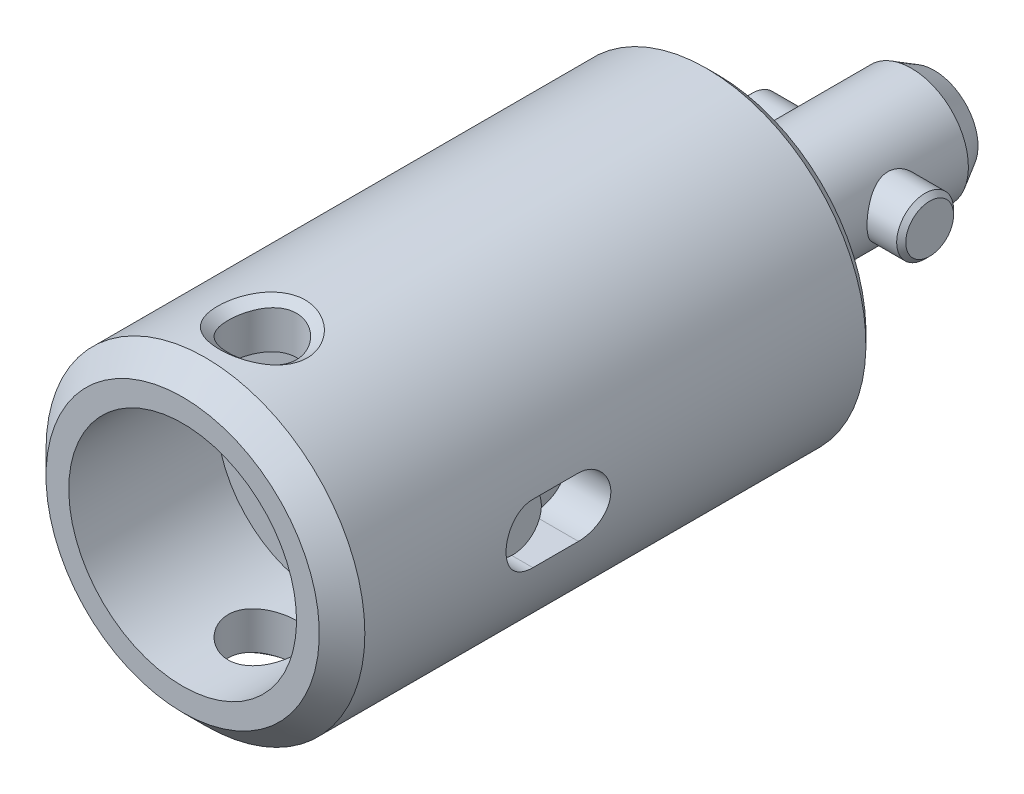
ISO-10303-21;
HEADER;
FILE_DESCRIPTION(('STEP AP214'),'2;1');
FILE_NAME('part.step','',(''),(''),'','','');
FILE_SCHEMA(('AUTOMOTIVE_DESIGN { 1 0 10303 214 1 1 1 1 }'));
ENDSEC;
DATA;
#1=APPLICATION_CONTEXT('core data for automotive mechanical design processes');
#2=APPLICATION_PROTOCOL_DEFINITION('international standard','automotive_design',2000,#1);
#3=PRODUCT_CONTEXT('',#1,'mechanical');
#4=PRODUCT('Part','Part','',(#3));
#5=PRODUCT_RELATED_PRODUCT_CATEGORY('part','',(#4));
#6=PRODUCT_DEFINITION_FORMATION('','',#4);
#7=PRODUCT_DEFINITION_CONTEXT('part definition',#1,'design');
#8=PRODUCT_DEFINITION('design','',#6,#7);
#9=PRODUCT_DEFINITION_SHAPE('','',#8);
#10=(LENGTH_UNIT() NAMED_UNIT(*) SI_UNIT(.MILLI.,.METRE.));
#11=(NAMED_UNIT(*) PLANE_ANGLE_UNIT() SI_UNIT($,.RADIAN.));
#12=(NAMED_UNIT(*) SI_UNIT($,.STERADIAN.) SOLID_ANGLE_UNIT());
#13=UNCERTAINTY_MEASURE_WITH_UNIT(LENGTH_MEASURE(1.E-05),#10,'distance_accuracy_value','');
#14=(GEOMETRIC_REPRESENTATION_CONTEXT(3) GLOBAL_UNCERTAINTY_ASSIGNED_CONTEXT((#13)) GLOBAL_UNIT_ASSIGNED_CONTEXT((#10,
#11,#12)) REPRESENTATION_CONTEXT('',''));
#15=CARTESIAN_POINT('',(0.,0.,0.));
#16=DIRECTION('',(0.,0.,1.));
#17=DIRECTION('',(1.,0.,0.));
#18=AXIS2_PLACEMENT_3D('',#15,#16,#17);
#19=CARTESIAN_POINT('',(0.,0.,18.5));
#20=DIRECTION('',(0.,0.,-1.));
#21=DIRECTION('',(0.,1.,0.));
#22=AXIS2_PLACEMENT_3D('',#19,#20,#21);
#23=CONICAL_SURFACE('',#22,7.,0.78539816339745);
#24=CARTESIAN_POINT('',(0.,0.,19.5));
#25=DIRECTION('',(0.,0.,1.));
#26=DIRECTION('',(0.,-1.,0.));
#27=AXIS2_PLACEMENT_3D('',#24,#25,#26);
#28=CIRCLE('',#27,6.);
#29=CARTESIAN_POINT('',(0.,-6.,19.5));
#30=VERTEX_POINT('',#29);
#31=EDGE_CURVE('E255',#30,#30,#28,.T.);
#32=ORIENTED_EDGE('',*,*,#31,.F.);
#33=EDGE_LOOP('',(#32));
#34=FACE_BOUND('',#33,.T.);
#35=CARTESIAN_POINT('',(0.,0.,18.5));
#36=DIRECTION('',(0.,0.,1.));
#37=DIRECTION('',(0.,-1.,0.));
#38=AXIS2_PLACEMENT_3D('',#35,#36,#37);
#39=CIRCLE('',#38,7.);
#40=CARTESIAN_POINT('',(0.,-7.,18.5));
#41=VERTEX_POINT('',#40);
#42=EDGE_CURVE('E240',#41,#41,#39,.F.);
#43=ORIENTED_EDGE('',*,*,#42,.F.);
#44=EDGE_LOOP('',(#43));
#45=FACE_BOUND('',#44,.T.);
#46=ADVANCED_FACE('F14',(#34,#45),#23,.T.);
#47=CARTESIAN_POINT('',(0.,0.,-4.));
#48=DIRECTION('',(0.,0.,1.));
#49=DIRECTION('',(0.,-1.,0.));
#50=AXIS2_PLACEMENT_3D('',#47,#48,#49);
#51=CONICAL_SURFACE('',#50,6.5,0.785398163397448);
#52=CARTESIAN_POINT('',(0.,0.,-3.5));
#53=DIRECTION('',(0.,0.,-1.));
#54=DIRECTION('',(0.,1.,0.));
#55=AXIS2_PLACEMENT_3D('',#52,#53,#54);
#56=CIRCLE('',#55,7.);
#57=CARTESIAN_POINT('',(0.,7.,-3.5));
#58=VERTEX_POINT('',#57);
#59=EDGE_CURVE('E261',#58,#58,#56,.F.);
#60=ORIENTED_EDGE('',*,*,#59,.F.);
#61=EDGE_LOOP('',(#60));
#62=FACE_BOUND('',#61,.T.);
#63=CARTESIAN_POINT('',(0.,0.,-4.));
#64=DIRECTION('',(0.,0.,-1.));
#65=DIRECTION('',(0.,1.,0.));
#66=AXIS2_PLACEMENT_3D('',#63,#64,#65);
#67=CIRCLE('',#66,6.5);
#68=CARTESIAN_POINT('',(0.,6.5,-4.));
#69=VERTEX_POINT('',#68);
#70=EDGE_CURVE('E258',#69,#69,#67,.T.);
#71=ORIENTED_EDGE('',*,*,#70,.F.);
#72=EDGE_LOOP('',(#71));
#73=FACE_BOUND('',#72,.T.);
#74=ADVANCED_FACE('F443',(#62,#73),#51,.T.);
#75=CARTESIAN_POINT('',(7.,0.,-4.));
#76=DIRECTION('',(0.,0.,-1.));
#77=DIRECTION('',(0.,1.,0.));
#78=AXIS2_PLACEMENT_3D('',#75,#76,#77);
#79=PLANE('',#78);
#80=ORIENTED_EDGE('',*,*,#70,.T.);
#81=EDGE_LOOP('',(#80));
#82=FACE_BOUND('',#81,.T.);
#83=CARTESIAN_POINT('',(0.,0.,-4.));
#84=DIRECTION('',(0.,0.,1.));
#85=DIRECTION('',(0.,-1.,0.));
#86=AXIS2_PLACEMENT_3D('',#83,#84,#85);
#87=CIRCLE('',#86,2.5);
#88=CARTESIAN_POINT('',(0.,-2.5,-4.));
#89=VERTEX_POINT('',#88);
#90=EDGE_CURVE('E234',#89,#89,#87,.T.);
#91=ORIENTED_EDGE('',*,*,#90,.T.);
#92=EDGE_LOOP('',(#91));
#93=FACE_BOUND('',#92,.T.);
#94=ADVANCED_FACE('F305',(#82,#93),#79,.T.);
#95=CARTESIAN_POINT('',(0.,0.,0.));
#96=DIRECTION('',(0.,0.,-1.));
#97=DIRECTION('',(0.,1.,0.));
#98=AXIS2_PLACEMENT_3D('',#95,#96,#97);
#99=CYLINDRICAL_SURFACE('',#98,7.);
#100=CARTESIAN_POINT('',(0.,7.,17.8806033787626));
#101=CARTESIAN_POINT('',(0.519603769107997,6.99993443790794,17.8803359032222));
#102=CARTESIAN_POINT('',(1.02940364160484,6.93507394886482,17.6755992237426));
#103=CARTESIAN_POINT('',(1.75492189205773,6.78525882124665,16.9835361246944));
#104=CARTESIAN_POINT('',(1.96880709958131,6.71744331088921,16.4963435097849));
#105=CARTESIAN_POINT('',(1.96817333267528,6.71759241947,15.5044118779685));
#106=CARTESIAN_POINT('',(1.75511005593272,6.78520110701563,15.0174417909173));
#107=CARTESIAN_POINT('',(1.02964014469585,6.93504547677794,14.3238287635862));
#108=CARTESIAN_POINT('',(0.520636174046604,6.99998910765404,14.1194833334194));
#109=CARTESIAN_POINT('',(-0.521110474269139,7.00001088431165,14.11930993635));
#110=CARTESIAN_POINT('',(-1.02910351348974,6.93515319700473,14.3233609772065));
#111=CARTESIAN_POINT('',(-1.75460573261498,6.78530462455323,15.0169148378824));
#112=CARTESIAN_POINT('',(-1.96846384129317,6.71750198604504,15.5049314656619));
#113=CARTESIAN_POINT('',(-1.96851579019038,6.71753397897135,16.4975835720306));
#114=CARTESIAN_POINT('',(-1.75454652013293,6.78526886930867,16.9834335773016));
#115=CARTESIAN_POINT('',(-1.02980033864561,6.93505957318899,17.6756813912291));
#116=CARTESIAN_POINT('',(-0.519603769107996,7.00006556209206,17.8808708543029));
#117=CARTESIAN_POINT('',(0.,7.,17.8806033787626));
#118=B_SPLINE_CURVE_WITH_KNOTS('',3,(#100,#101,#102,#103,#104,#105,#106,#107,#108,#109,#110,
#111,#112,#113,#114,#115,#116,#117),.UNSPECIFIED.,.T.,.F.,(4,2,2,2,2,2,2,2,4),
(-0.0117964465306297,-0.0103189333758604,-0.00884142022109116,-0.00736390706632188,
-0.00588639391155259,-0.00440888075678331,-0.00293136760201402,-0.00145385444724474,
2.365870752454E-05),.UNSPECIFIED.);
#119=CARTESIAN_POINT('',(0.,7.,17.8806033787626));
#120=VERTEX_POINT('',#119);
#121=EDGE_CURVE('E24',#120,#120,#118,.F.);
#122=ORIENTED_EDGE('',*,*,#121,.T.);
#123=EDGE_LOOP('',(#122));
#124=FACE_BOUND('',#123,.T.);
#125=CARTESIAN_POINT('',(1.96849025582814,-6.71751785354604,16.));
#126=CARTESIAN_POINT('',(1.96834177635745,-6.71755108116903,16.4964182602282));
#127=CARTESIAN_POINT('',(1.75415613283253,-6.78527487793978,16.9830722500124));
#128=CARTESIAN_POINT('',(1.03005680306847,-6.9350807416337,17.6761707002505));
#129=CARTESIAN_POINT('',(0.519955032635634,-7.00006097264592,17.8808765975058));
#130=CARTESIAN_POINT('',(-0.518508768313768,-6.99993895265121,17.8803299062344));
#131=CARTESIAN_POINT('',(-1.02858877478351,-6.93519451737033,17.6766197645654));
#132=CARTESIAN_POINT('',(-1.75466424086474,-6.78535585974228,16.9835401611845));
#133=CARTESIAN_POINT('',(-1.96840139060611,-6.71753463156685,16.4977364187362));
#134=CARTESIAN_POINT('',(-1.96857911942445,-6.71750107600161,15.5023716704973));
#135=CARTESIAN_POINT('',(-1.75518097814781,-6.78520472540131,15.0173125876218));
#136=CARTESIAN_POINT('',(-1.02950747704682,-6.9350543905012,14.3238989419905));
#137=CARTESIAN_POINT('',(-0.518393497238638,-6.99998554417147,14.1195203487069));
#138=CARTESIAN_POINT('',(0.520355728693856,-7.00001431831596,14.1192733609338));
#139=CARTESIAN_POINT('',(1.02938241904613,-6.9351628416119,14.3236445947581));
#140=CARTESIAN_POINT('',(1.75386521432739,-6.78538862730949,15.0161903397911));
#141=CARTESIAN_POINT('',(1.96863873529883,-6.71748462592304,15.5035817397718));
#142=CARTESIAN_POINT('',(1.96849025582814,-6.71751785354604,16.));
#143=B_SPLINE_CURVE_WITH_KNOTS('',3,(#125,#126,#127,#128,#129,#130,#131,#132,#133,#134,#135,
#136,#137,#138,#139,#140,#141,#142),.UNSPECIFIED.,.T.,.F.,(4,2,2,2,2,2,2,2,4),
(-8.36570283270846E-07,0.00147676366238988,0.00295436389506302,0.00443196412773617,
0.00590956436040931,0.00738716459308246,0.00886476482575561,0.0103423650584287,
0.0118199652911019),.UNSPECIFIED.);
#144=CARTESIAN_POINT('',(1.96849025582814,-6.71751785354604,16.));
#145=VERTEX_POINT('',#144);
#146=EDGE_CURVE('E425',#145,#145,#143,.F.);
#147=ORIENTED_EDGE('',*,*,#146,.T.);
#148=EDGE_LOOP('',(#147));
#149=FACE_BOUND('',#148,.T.);
#150=ORIENTED_EDGE('',*,*,#59,.T.);
#151=EDGE_LOOP('',(#150));
#152=FACE_BOUND('',#151,.T.);
#153=ORIENTED_EDGE('',*,*,#42,.T.);
#154=EDGE_LOOP('',(#153));
#155=FACE_BOUND('',#154,.T.);
#156=DIRECTION('',(0.,0.,-1.));
#157=VECTOR('',#156,1.);
#158=CARTESIAN_POINT('',(6.87822651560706,1.3,0.));
#159=LINE('',#158,#157);
#160=CARTESIAN_POINT('',(6.87822651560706,1.3,11.));
#161=VERTEX_POINT('',#160);
#162=CARTESIAN_POINT('',(6.87822651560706,1.3,9.));
#163=VERTEX_POINT('',#162);
#164=EDGE_CURVE('E299',#161,#163,#159,.T.);
#165=ORIENTED_EDGE('',*,*,#164,.T.);
#166=CARTESIAN_POINT('',(6.87822651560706,1.3,9.));
#167=CARTESIAN_POINT('',(6.87822480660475,1.30000013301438,8.96376227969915));
#168=CARTESIAN_POINT('',(6.87851325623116,1.29848384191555,8.92754223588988));
#169=CARTESIAN_POINT('',(6.87965261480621,1.29243720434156,8.85536761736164));
#170=CARTESIAN_POINT('',(6.88050346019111,1.28790719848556,8.81941301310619));
#171=CARTESIAN_POINT('',(6.88386775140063,1.26985195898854,8.71244415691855));
#172=CARTESIAN_POINT('',(6.88719311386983,1.25186130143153,8.64215637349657));
#173=CARTESIAN_POINT('',(6.89562974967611,1.20451690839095,8.50566636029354));
#174=CARTESIAN_POINT('',(6.90074130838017,1.17516135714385,8.43946478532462));
#175=CARTESIAN_POINT('',(6.91217183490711,1.10594155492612,8.31290966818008));
#176=CARTESIAN_POINT('',(6.91849087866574,1.06607664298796,8.25255649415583));
#177=CARTESIAN_POINT('',(6.93170943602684,0.976458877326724,8.13870198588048));
#178=CARTESIAN_POINT('',(6.93861449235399,0.926603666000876,8.08528188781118));
#179=CARTESIAN_POINT('',(6.95217881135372,0.81863597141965,7.98750805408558));
#180=CARTESIAN_POINT('',(6.95883803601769,0.760522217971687,7.94315571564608));
#181=CARTESIAN_POINT('',(6.97121952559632,0.637153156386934,7.86447026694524));
#182=CARTESIAN_POINT('',(6.97693443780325,0.571847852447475,7.83021428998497));
#183=CARTESIAN_POINT('',(6.98672053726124,0.436288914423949,7.77319224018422));
#184=CARTESIAN_POINT('',(6.99079194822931,0.366035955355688,7.75042460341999));
#185=CARTESIAN_POINT('',(6.99679327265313,0.22342176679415,7.71727598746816));
#186=CARTESIAN_POINT('',(6.99874704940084,0.151093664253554,7.70675687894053));
#187=CARTESIAN_POINT('',(7.0003752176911,0.00567288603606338,7.69797353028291));
#188=CARTESIAN_POINT('',(7.00004974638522,-0.0674197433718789,7.69970855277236));
#189=CARTESIAN_POINT('',(6.99717467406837,-0.211344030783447,7.71527857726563));
#190=CARTESIAN_POINT('',(6.99465246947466,-0.282192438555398,7.72896453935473));
#191=CARTESIAN_POINT('',(6.98769806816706,-0.420568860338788,7.76781222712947));
#192=CARTESIAN_POINT('',(6.98326581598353,-0.488096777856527,7.79297428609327));
#193=CARTESIAN_POINT('',(6.97294338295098,-0.61835022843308,7.8542029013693));
#194=CARTESIAN_POINT('',(6.96704522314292,-0.681046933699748,7.89032938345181));
#195=CARTESIAN_POINT('',(6.95444381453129,-0.799541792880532,7.97241606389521));
#196=CARTESIAN_POINT('',(6.94774051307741,-0.855339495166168,8.01837690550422));
#197=CARTESIAN_POINT('',(6.9341531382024,-0.959331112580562,8.11964249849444));
#198=CARTESIAN_POINT('',(6.92726786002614,-1.00739907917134,8.17507649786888));
#199=CARTESIAN_POINT('',(6.9141863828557,-1.09358746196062,8.29330489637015));
#200=CARTESIAN_POINT('',(6.90799037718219,-1.13170509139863,8.35610135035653));
#201=CARTESIAN_POINT('',(6.89698633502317,-1.19694644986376,8.48744629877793));
#202=CARTESIAN_POINT('',(6.89218138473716,-1.22404578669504,8.55600715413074));
#203=CARTESIAN_POINT('',(6.8845503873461,-1.26626777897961,8.69677240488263));
#204=CARTESIAN_POINT('',(6.88172138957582,-1.28140829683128,8.76897119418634));
#205=CARTESIAN_POINT('',(6.87944013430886,-1.29356452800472,8.86811231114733));
#206=CARTESIAN_POINT('',(6.87898548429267,-1.29597874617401,8.89445315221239));
#207=CARTESIAN_POINT('',(6.87837895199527,-1.2991944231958,8.94719208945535));
#208=CARTESIAN_POINT('',(6.87822656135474,-1.29999858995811,8.97359001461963));
#209=CARTESIAN_POINT('',(6.87822651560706,-1.3,9.));
#210=B_SPLINE_CURVE_WITH_KNOTS('',3,(#166,#167,#168,#169,#170,#171,#172,#173,#174,#175,#176,
#177,#178,#179,#180,#181,#182,#183,#184,#185,#186,#187,#188,#189,#190,#191,#192,#193,#194,#195,
#196,#197,#198,#199,#200,#201,#202,#203,#204,#205,#206,#207,#208,#209),.UNSPECIFIED.,.F.,.F.,(4,
2,2,2,2,2,2,2,2,2,2,2,2,2,2,2,2,2,2,2,2,4),(0.,0.10864537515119,0.217278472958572,
0.434045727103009,0.650847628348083,0.867663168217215,1.08682554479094,1.30602166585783,
1.52685138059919,1.74765102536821,1.9659357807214,2.18420740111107,2.39979522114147,
2.61538930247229,2.8321836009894,3.04899208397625,3.26903719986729,3.48914387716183,
3.70973520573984,3.92999641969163,4.00932316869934,4.08851638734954),.UNSPECIFIED.);
#211=CARTESIAN_POINT('',(6.87822651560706,-1.3,9.));
#212=VERTEX_POINT('',#211);
#213=EDGE_CURVE('E292',#163,#212,#210,.T.);
#214=ORIENTED_EDGE('',*,*,#213,.T.);
#215=DIRECTION('',(0.,0.,-1.));
#216=VECTOR('',#215,1.);
#217=CARTESIAN_POINT('',(6.87822651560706,-1.3,0.));
#218=LINE('',#217,#216);
#219=CARTESIAN_POINT('',(6.87822651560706,-1.3,11.));
#220=VERTEX_POINT('',#219);
#221=EDGE_CURVE('E243',#212,#220,#218,.F.);
#222=ORIENTED_EDGE('',*,*,#221,.T.);
#223=CARTESIAN_POINT('',(6.87822651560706,-1.3,11.));
#224=CARTESIAN_POINT('',(6.87822480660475,-1.30000013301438,11.0362377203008));
#225=CARTESIAN_POINT('',(6.87851325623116,-1.29848384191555,11.0724577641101));
#226=CARTESIAN_POINT('',(6.87965261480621,-1.29243720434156,11.1446323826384));
#227=CARTESIAN_POINT('',(6.88050346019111,-1.28790719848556,11.1805869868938));
#228=CARTESIAN_POINT('',(6.88386775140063,-1.26985195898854,11.2875558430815));
#229=CARTESIAN_POINT('',(6.88719311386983,-1.25186130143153,11.3578436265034));
#230=CARTESIAN_POINT('',(6.8956297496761,-1.20451690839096,11.4943336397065));
#231=CARTESIAN_POINT('',(6.90074130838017,-1.17516135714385,11.5605352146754));
#232=CARTESIAN_POINT('',(6.91217183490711,-1.10594155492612,11.6870903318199));
#233=CARTESIAN_POINT('',(6.91849087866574,-1.06607664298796,11.7474435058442));
#234=CARTESIAN_POINT('',(6.93170943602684,-0.976458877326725,11.8612980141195));
#235=CARTESIAN_POINT('',(6.93861449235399,-0.92660366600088,11.9147181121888));
#236=CARTESIAN_POINT('',(6.95217881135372,-0.818635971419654,12.0124919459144));
#237=CARTESIAN_POINT('',(6.95883803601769,-0.760522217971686,12.0568442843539));
#238=CARTESIAN_POINT('',(6.97121952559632,-0.637153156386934,12.1355297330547));
#239=CARTESIAN_POINT('',(6.97693443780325,-0.571847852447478,12.169785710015));
#240=CARTESIAN_POINT('',(6.98672053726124,-0.436288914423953,12.2268077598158));
#241=CARTESIAN_POINT('',(6.99079194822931,-0.366035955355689,12.24957539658));
#242=CARTESIAN_POINT('',(6.99679327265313,-0.22342176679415,12.2827240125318));
#243=CARTESIAN_POINT('',(6.99874704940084,-0.151093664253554,12.2932431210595));
#244=CARTESIAN_POINT('',(7.0003752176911,-0.00567288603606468,12.3020264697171));
#245=CARTESIAN_POINT('',(7.00004974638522,0.0674197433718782,12.3002914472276));
#246=CARTESIAN_POINT('',(6.99717467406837,0.211344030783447,12.2847214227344));
#247=CARTESIAN_POINT('',(6.99465246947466,0.282192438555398,12.2710354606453));
#248=CARTESIAN_POINT('',(6.98769806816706,0.420568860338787,12.2321877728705));
#249=CARTESIAN_POINT('',(6.98326581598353,0.488096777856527,12.2070257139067));
#250=CARTESIAN_POINT('',(6.97294338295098,0.618350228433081,12.1457970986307));
#251=CARTESIAN_POINT('',(6.96704522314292,0.681046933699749,12.1096706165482));
#252=CARTESIAN_POINT('',(6.95444381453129,0.799541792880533,12.0275839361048));
#253=CARTESIAN_POINT('',(6.94774051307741,0.85533949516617,11.9816230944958));
#254=CARTESIAN_POINT('',(6.9341531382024,0.959331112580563,11.8803575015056));
#255=CARTESIAN_POINT('',(6.92726786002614,1.00739907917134,11.8249235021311));
#256=CARTESIAN_POINT('',(6.9141863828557,1.09358746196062,11.7066951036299));
#257=CARTESIAN_POINT('',(6.90799037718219,1.13170509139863,11.6438986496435));
#258=CARTESIAN_POINT('',(6.89698633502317,1.19694644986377,11.5125537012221));
#259=CARTESIAN_POINT('',(6.89218138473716,1.22404578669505,11.4439928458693));
#260=CARTESIAN_POINT('',(6.8845503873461,1.26626777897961,11.3032275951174));
#261=CARTESIAN_POINT('',(6.88172138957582,1.28140829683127,11.2310288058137));
#262=CARTESIAN_POINT('',(6.87944013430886,1.29356452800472,11.1318876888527));
#263=CARTESIAN_POINT('',(6.87898548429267,1.29597874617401,11.1055468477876));
#264=CARTESIAN_POINT('',(6.87837895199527,1.2991944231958,11.0528079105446));
#265=CARTESIAN_POINT('',(6.87822656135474,1.29999858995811,11.0264099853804));
#266=CARTESIAN_POINT('',(6.87822651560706,1.3,11.));
#267=B_SPLINE_CURVE_WITH_KNOTS('',3,(#223,#224,#225,#226,#227,#228,#229,#230,#231,#232,#233,
#234,#235,#236,#237,#238,#239,#240,#241,#242,#243,#244,#245,#246,#247,#248,#249,#250,#251,#252,
#253,#254,#255,#256,#257,#258,#259,#260,#261,#262,#263,#264,#265,#266),.UNSPECIFIED.,.F.,.F.,(4,
2,2,2,2,2,2,2,2,2,2,2,2,2,2,2,2,2,2,2,2,4),(0.,0.108645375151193,0.217278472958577,
0.434045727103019,0.650847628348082,0.867663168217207,1.08682554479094,1.30602166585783,
1.52685138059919,1.74765102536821,1.96593578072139,2.18420740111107,2.39979522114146,
2.61538930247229,2.8321836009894,3.04899208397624,3.26903719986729,3.48914387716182,
3.70973520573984,3.92999641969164,4.00932316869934,4.08851638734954),.UNSPECIFIED.);
#268=EDGE_CURVE('E237',#220,#161,#267,.T.);
#269=ORIENTED_EDGE('',*,*,#268,.T.);
#270=EDGE_LOOP('',(#165,#214,#222,#269));
#271=FACE_BOUND('',#270,.T.);
#272=ADVANCED_FACE('F189',(#124,#149,#152,#155,#271),#99,.T.);
#273=CARTESIAN_POINT('',(1.5,-6.41760188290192,16.));
#274=CARTESIAN_POINT('',(1.49988685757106,-6.41763362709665,16.3959523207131));
#275=CARTESIAN_POINT('',(1.33667623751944,-6.48233377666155,16.7841145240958));
#276=CARTESIAN_POINT('',(0.784908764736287,-6.62545126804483,17.3369411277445));
#277=CARTESIAN_POINT('',(0.396210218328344,-6.68753034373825,17.5002179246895));
#278=CARTESIAN_POINT('',(-0.395108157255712,-6.68741377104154,17.4997818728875));
#279=CARTESIAN_POINT('',(-0.783790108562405,-6.62555996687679,17.3372993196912));
#280=CARTESIAN_POINT('',(-1.33706342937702,-6.48241114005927,16.7844877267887));
#281=CARTESIAN_POINT('',(-1.499932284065,-6.41761791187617,16.3970036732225));
#282=CARTESIAN_POINT('',(-1.5000677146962,-6.4175858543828,15.6030825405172));
#283=CARTESIAN_POINT('',(-1.3374571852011,-6.48226675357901,15.2161924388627));
#284=CARTESIAN_POINT('',(-0.784490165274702,-6.62542609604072,14.6631144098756));
#285=CARTESIAN_POINT('',(-0.395020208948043,-6.68745828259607,14.5000986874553));
#286=CARTESIAN_POINT('',(0.39651543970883,-6.68748577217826,14.4999016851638));
#287=CARTESIAN_POINT('',(0.784394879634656,-6.62552970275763,14.6629115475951));
#288=CARTESIAN_POINT('',(1.33645455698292,-6.48244244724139,15.2152973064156));
#289=CARTESIAN_POINT('',(1.50011314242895,-6.4175701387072,15.6040476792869));
#290=CARTESIAN_POINT('',(1.5,-6.41760188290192,16.));
#291=CARTESIAN_POINT('',(1.96849025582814,-6.71751785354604,16.));
#292=CARTESIAN_POINT('',(1.96834177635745,-6.71755108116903,16.4964182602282));
#293=CARTESIAN_POINT('',(1.75415613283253,-6.78527487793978,16.9830722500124));
#294=CARTESIAN_POINT('',(1.03005680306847,-6.9350807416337,17.6761707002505));
#295=CARTESIAN_POINT('',(0.519955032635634,-7.00006097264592,17.8808765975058));
#296=CARTESIAN_POINT('',(-0.518508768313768,-6.99993895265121,17.8803299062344));
#297=CARTESIAN_POINT('',(-1.02858877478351,-6.93519451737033,17.6766197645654));
#298=CARTESIAN_POINT('',(-1.75466424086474,-6.78535585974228,16.9835401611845));
#299=CARTESIAN_POINT('',(-1.96840139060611,-6.71753463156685,16.4977364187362));
#300=CARTESIAN_POINT('',(-1.96857911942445,-6.71750107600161,15.5023716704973));
#301=CARTESIAN_POINT('',(-1.75518097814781,-6.78520472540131,15.0173125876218));
#302=CARTESIAN_POINT('',(-1.02950747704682,-6.9350543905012,14.3238989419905));
#303=CARTESIAN_POINT('',(-0.518393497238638,-6.99998554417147,14.1195203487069));
#304=CARTESIAN_POINT('',(0.520355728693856,-7.00001431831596,14.1192733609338));
#305=CARTESIAN_POINT('',(1.02938241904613,-6.9351628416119,14.3236445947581));
#306=CARTESIAN_POINT('',(1.75386521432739,-6.78538862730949,15.0161903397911));
#307=CARTESIAN_POINT('',(1.96863873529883,-6.71748462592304,15.5035817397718));
#308=CARTESIAN_POINT('',(1.96849025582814,-6.71751785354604,16.));
#309=B_SPLINE_SURFACE_WITH_KNOTS('',1,3,((#273,#274,#275,#276,#277,#278,#279,#280,#281,#282,
#283,#284,#285,#286,#287,#288,#289,#290),(#291,#292,#293,#294,#295,#296,#297,#298,#299,#300,
#301,#302,#303,#304,#305,#306,#307,#308)),.UNSPECIFIED.,.F.,.T.,.F.,(2,2),(4,2,2,2,2,2,2,2,4),
(0.,1.),(-8.36570283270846E-07,0.00147676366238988,0.00295436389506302,0.00443196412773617,
0.00590956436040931,0.00738716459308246,0.00886476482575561,0.0103423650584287,
0.0118199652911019),.UNSPECIFIED.);
#310=CARTESIAN_POINT('',(1.5,-6.41760188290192,16.));
#311=CARTESIAN_POINT('',(1.50000779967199,-6.4175995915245,15.9752764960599));
#312=CARTESIAN_POINT('',(1.49937564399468,-6.41785096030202,15.9505543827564));
#313=CARTESIAN_POINT('',(1.4968552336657,-6.41883297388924,15.9012180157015));
#314=CARTESIAN_POINT('',(1.49496872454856,-6.41956295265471,15.8766036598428));
#315=CARTESIAN_POINT('',(1.48996497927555,-6.42147365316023,15.827535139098));
#316=CARTESIAN_POINT('',(1.48684856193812,-6.42265407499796,15.8030808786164));
#317=CARTESIAN_POINT('',(1.47941118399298,-6.4254368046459,15.7543836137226));
#318=CARTESIAN_POINT('',(1.47509035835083,-6.42703906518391,15.7301405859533));
#319=CARTESIAN_POINT('',(1.46526981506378,-6.43063684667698,15.6819171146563));
#320=CARTESIAN_POINT('',(1.45976975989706,-6.43263248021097,15.6579367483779));
#321=CARTESIAN_POINT('',(1.44761627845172,-6.43698843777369,15.6102898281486));
#322=CARTESIAN_POINT('',(1.44096221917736,-6.43934896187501,15.5866234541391));
#323=CARTESIAN_POINT('',(1.42652605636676,-6.44440620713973,15.5396557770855));
#324=CARTESIAN_POINT('',(1.41874316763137,-6.44710316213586,15.5163547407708));
#325=CARTESIAN_POINT('',(1.40207453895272,-6.45280482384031,15.4701690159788));
#326=CARTESIAN_POINT('',(1.39318797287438,-6.45580976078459,15.4472846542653));
#327=CARTESIAN_POINT('',(1.37433707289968,-6.46209897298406,15.4019835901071));
#328=CARTESIAN_POINT('',(1.36437195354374,-6.4653834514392,15.3795672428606));
#329=CARTESIAN_POINT('',(1.34338895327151,-6.47220336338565,15.3352535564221));
#330=CARTESIAN_POINT('',(1.33237038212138,-6.47573896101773,15.3133565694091));
#331=CARTESIAN_POINT('',(1.30930542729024,-6.48303270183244,15.2701329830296));
#332=CARTESIAN_POINT('',(1.29725847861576,-6.48679096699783,15.2488067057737));
#333=CARTESIAN_POINT('',(1.27216170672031,-6.49450176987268,15.2067759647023));
#334=CARTESIAN_POINT('',(1.2591114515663,-6.49845439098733,15.1860717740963));
#335=CARTESIAN_POINT('',(1.23203293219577,-6.50652512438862,15.1453365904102));
#336=CARTESIAN_POINT('',(1.21800435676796,-6.51064328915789,15.1253058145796));
#337=CARTESIAN_POINT('',(1.18899431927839,-6.51901820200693,15.0859690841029));
#338=CARTESIAN_POINT('',(1.17401263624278,-6.52327498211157,15.0666632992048));
#339=CARTESIAN_POINT('',(1.14312062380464,-6.53189318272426,15.0288272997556));
#340=CARTESIAN_POINT('',(1.12721011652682,-6.53625462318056,15.0102972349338));
#341=CARTESIAN_POINT('',(1.09448814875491,-6.5450744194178,14.9740666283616));
#342=CARTESIAN_POINT('',(1.07767649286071,-6.54953279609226,14.9563662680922));
#343=CARTESIAN_POINT('',(1.04317730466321,-6.5584382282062,14.9218469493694));
#344=CARTESIAN_POINT('',(1.02548999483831,-6.56288528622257,14.9050277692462));
#345=CARTESIAN_POINT('',(0.989289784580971,-6.57166246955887,14.8722969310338));
#346=CARTESIAN_POINT('',(0.970777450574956,-6.57599267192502,14.8563846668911));
#347=CARTESIAN_POINT('',(0.932980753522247,-6.58453127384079,14.8254944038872));
#348=CARTESIAN_POINT('',(0.9136968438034,-6.58873974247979,14.8105158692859));
#349=CARTESIAN_POINT('',(0.87440706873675,-6.59700376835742,14.7815166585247));
#350=CARTESIAN_POINT('',(0.854401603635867,-6.60105940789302,14.7674954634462));
#351=CARTESIAN_POINT('',(0.813719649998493,-6.6089936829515,14.7404354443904));
#352=CARTESIAN_POINT('',(0.793043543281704,-6.6128724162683,14.727396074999));
#353=CARTESIAN_POINT('',(0.751070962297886,-6.62042689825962,14.7023240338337));
#354=CARTESIAN_POINT('',(0.729774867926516,-6.62410276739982,14.6902907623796));
#355=CARTESIAN_POINT('',(0.686613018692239,-6.63122603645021,14.6672553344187));
#356=CARTESIAN_POINT('',(0.664747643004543,-6.63467358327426,14.6562525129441));
#357=CARTESIAN_POINT('',(0.620497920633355,-6.64131458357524,14.6353023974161));
#358=CARTESIAN_POINT('',(0.598113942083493,-6.64450821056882,14.6253543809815));
#359=CARTESIAN_POINT('',(0.552877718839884,-6.65061578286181,14.606538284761));
#360=CARTESIAN_POINT('',(0.530025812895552,-6.65352992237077,14.5976694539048));
#361=CARTESIAN_POINT('',(0.48390445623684,-6.65905292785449,14.5810361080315));
#362=CARTESIAN_POINT('',(0.460635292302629,-6.66166199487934,14.573270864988));
#363=CARTESIAN_POINT('',(0.41373016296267,-6.66654928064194,14.5588690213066));
#364=CARTESIAN_POINT('',(0.390094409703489,-6.66882768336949,14.5522317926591));
#365=CARTESIAN_POINT('',(0.342506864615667,-6.67302809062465,14.540110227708));
#366=CARTESIAN_POINT('',(0.31855519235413,-6.67495022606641,14.5346254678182));
#367=CARTESIAN_POINT('',(0.270386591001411,-6.67841258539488,14.524832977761));
#368=CARTESIAN_POINT('',(0.246169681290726,-6.67995283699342,14.5205251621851));
#369=CARTESIAN_POINT('',(0.197521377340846,-6.68262597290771,14.513110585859));
#370=CARTESIAN_POINT('',(0.17308991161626,-6.68375871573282,14.5100042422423));
#371=CARTESIAN_POINT('',(0.124063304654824,-6.6855914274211,14.5050163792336));
#372=CARTESIAN_POINT('',(0.0994680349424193,-6.68629100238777,14.5031359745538));
#373=CARTESIAN_POINT('',(0.0501644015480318,-6.68723213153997,14.5006238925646));
#374=CARTESIAN_POINT('',(0.025455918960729,-6.68747293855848,14.4999942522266));
#375=CARTESIAN_POINT('',(-0.023966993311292,-6.68747111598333,14.5000061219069));
#376=CARTESIAN_POINT('',(-0.04868142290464,-6.68722836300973,14.5006479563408));
#377=CARTESIAN_POINT('',(-0.0980080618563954,-6.68628314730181,14.5031821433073));
#378=CARTESIAN_POINT('',(-0.122620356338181,-6.68558121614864,14.5050730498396));
#379=CARTESIAN_POINT('',(-0.171690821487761,-6.68374372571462,14.5100804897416));
#380=CARTESIAN_POINT('',(-0.196149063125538,-6.6826083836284,14.5131964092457));
#381=CARTESIAN_POINT('',(-0.244859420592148,-6.67992995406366,14.5206289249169));
#382=CARTESIAN_POINT('',(-0.269111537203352,-6.67838686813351,14.5249455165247));
#383=CARTESIAN_POINT('',(-0.317357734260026,-6.67491876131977,14.5347547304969));
#384=CARTESIAN_POINT('',(-0.341351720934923,-6.67299360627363,14.5402477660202));
#385=CARTESIAN_POINT('',(-0.389029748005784,-6.66878708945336,14.5523853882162));
#386=CARTESIAN_POINT('',(-0.4127135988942,-6.66650551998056,14.5590306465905));
#387=CARTESIAN_POINT('',(-0.459719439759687,-6.66161184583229,14.5734483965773));
#388=CARTESIAN_POINT('',(-0.483041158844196,-6.65899950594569,14.5812216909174));
#389=CARTESIAN_POINT('',(-0.529270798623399,-6.65346991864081,14.5978713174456));
#390=CARTESIAN_POINT('',(-0.552178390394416,-6.65055244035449,14.6067484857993));
#391=CARTESIAN_POINT('',(-0.597527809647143,-6.64443817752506,14.6255817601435));
#392=CARTESIAN_POINT('',(-0.619969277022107,-6.64124118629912,14.6355386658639));
#393=CARTESIAN_POINT('',(-0.664334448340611,-6.63459347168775,14.6565073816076));
#394=CARTESIAN_POINT('',(-0.686257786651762,-6.63114257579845,14.6675199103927));
#395=CARTESIAN_POINT('',(-0.729534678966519,-6.62401265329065,14.6905758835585));
#396=CARTESIAN_POINT('',(-0.750887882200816,-6.62033349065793,14.7026199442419));
#397=CARTESIAN_POINT('',(-0.792972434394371,-6.61277250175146,14.7277150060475));
#398=CARTESIAN_POINT('',(-0.813703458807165,-6.60889057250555,14.7407665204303));
#399=CARTESIAN_POINT('',(-0.854491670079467,-6.60095001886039,14.7678525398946));
#400=CARTESIAN_POINT('',(-0.87454855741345,-6.59689131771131,14.7818874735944));
#401=CARTESIAN_POINT('',(-0.913936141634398,-6.58862133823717,14.810916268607));
#402=CARTESIAN_POINT('',(-0.933266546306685,-6.58440999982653,14.8259105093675));
#403=CARTESIAN_POINT('',(-0.971150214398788,-6.57586580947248,14.8568341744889));
#404=CARTESIAN_POINT('',(-0.98970315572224,-6.57153290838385,14.8727639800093));
#405=CARTESIAN_POINT('',(-1.02597581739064,-6.56275075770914,14.905533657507));
#406=CARTESIAN_POINT('',(-1.04369512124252,-6.55830145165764,14.9223739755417));
#407=CARTESIAN_POINT('',(-1.07824807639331,-6.54939246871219,14.9569287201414));
#408=CARTESIAN_POINT('',(-1.09508193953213,-6.54493279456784,14.9746429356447));
#409=CARTESIAN_POINT('',(-1.12783830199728,-6.53611181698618,15.0108860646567));
#410=CARTESIAN_POINT('',(-1.14376165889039,-6.53175042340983,15.0294141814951));
#411=CARTESIAN_POINT('',(-1.17466924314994,-6.52313378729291,15.0672349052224));
#412=CARTESIAN_POINT('',(-1.18965423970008,-6.5188784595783,15.0865268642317));
#413=CARTESIAN_POINT('',(-1.21866250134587,-6.51050764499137,15.125826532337));
#414=CARTESIAN_POINT('',(-1.23268649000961,-6.50639205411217,15.1458336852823));
#415=CARTESIAN_POINT('',(-1.25974868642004,-6.49832747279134,15.1865146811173));
#416=CARTESIAN_POINT('',(-1.27278760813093,-6.49437836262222,15.2071880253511));
#417=CARTESIAN_POINT('',(-1.29785595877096,-6.48667536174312,15.2491524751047));
#418=CARTESIAN_POINT('',(-1.3098861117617,-6.48292133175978,15.2704431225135));
#419=CARTESIAN_POINT('',(-1.33291309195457,-6.47563661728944,15.3135932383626));
#420=CARTESIAN_POINT('',(-1.34391065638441,-6.47210577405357,15.3354522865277));
#421=CARTESIAN_POINT('',(-1.36484864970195,-6.46529569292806,15.3796902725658));
#422=CARTESIAN_POINT('',(-1.3747898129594,-6.46201628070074,15.40206883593));
#423=CARTESIAN_POINT('',(-1.39359120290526,-6.45573728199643,15.4472969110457));
#424=CARTESIAN_POINT('',(-1.40245212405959,-6.45273751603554,15.4701461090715));
#425=CARTESIAN_POINT('',(-1.41906926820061,-6.44704602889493,15.5162664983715));
#426=CARTESIAN_POINT('',(-1.42682608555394,-6.44435414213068,15.5395374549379));
#427=CARTESIAN_POINT('',(-1.44121132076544,-6.4393066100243,15.5864523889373));
#428=CARTESIAN_POINT('',(-1.44784014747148,-6.43695084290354,15.6100962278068));
#429=CARTESIAN_POINT('',(-1.45994578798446,-6.43260371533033,15.6577079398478));
#430=CARTESIAN_POINT('',(-1.4654227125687,-6.43061231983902,15.6816757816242));
#431=CARTESIAN_POINT('',(-1.47520104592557,-6.42702205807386,15.7298865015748));
#432=CARTESIAN_POINT('',(-1.479502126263,-6.42542330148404,15.7541294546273));
#433=CARTESIAN_POINT('',(-1.48690542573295,-6.42264637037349,15.8028414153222));
#434=CARTESIAN_POINT('',(-1.49000670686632,-6.42146852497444,15.8273105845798));
#435=CARTESIAN_POINT('',(-1.49498718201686,-6.41956142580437,15.8764259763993));
#436=CARTESIAN_POINT('',(-1.49686462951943,-6.41883281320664,15.9010724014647));
#437=CARTESIAN_POINT('',(-1.49937461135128,-6.4178519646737,15.9504935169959));
#438=CARTESIAN_POINT('',(-1.50000436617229,-6.41760079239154,15.9752683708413));
#439=CARTESIAN_POINT('',(-1.49999563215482,-6.41760297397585,16.0248203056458));
#440=CARTESIAN_POINT('',(-1.49935701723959,-6.41785637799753,16.0495973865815));
#441=CARTESIAN_POINT('',(-1.49682845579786,-6.41884229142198,16.0990269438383));
#442=CARTESIAN_POINT('',(-1.49494106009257,-6.41957382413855,16.1236795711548));
#443=CARTESIAN_POINT('',(-1.48994024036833,-6.42148707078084,16.1728107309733));
#444=CARTESIAN_POINT('',(-1.48682836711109,-6.42266821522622,16.1972894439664));
#445=CARTESIAN_POINT('',(-1.47940342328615,-6.42545202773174,16.2460232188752));
#446=CARTESIAN_POINT('',(-1.47509113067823,-6.42705442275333,16.2702784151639));
#447=CARTESIAN_POINT('',(-1.46529001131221,-6.43065214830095,16.3185157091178));
#448=CARTESIAN_POINT('',(-1.45980138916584,-6.43264741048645,16.3424978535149));
#449=CARTESIAN_POINT('',(-1.44767206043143,-6.43700238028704,16.3901396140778));
#450=CARTESIAN_POINT('',(-1.44103115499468,-6.43936215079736,16.4137991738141));
#451=CARTESIAN_POINT('',(-1.42662154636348,-6.44441771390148,16.4607463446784));
#452=CARTESIAN_POINT('',(-1.41885238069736,-6.44711364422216,16.484033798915));
#453=CARTESIAN_POINT('',(-1.4022104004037,-6.45281315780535,16.530187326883));
#454=CARTESIAN_POINT('',(-1.39333697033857,-6.45581691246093,16.5530531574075));
#455=CARTESIAN_POINT('',(-1.37451050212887,-6.4621037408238,16.5983139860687));
#456=CARTESIAN_POINT('',(-1.36455677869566,-6.46538699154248,16.6207086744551));
#457=CARTESIAN_POINT('',(-1.34359368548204,-6.47220451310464,16.6649777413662));
#458=CARTESIAN_POINT('',(-1.33258361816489,-6.47573894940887,16.6868517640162));
#459=CARTESIAN_POINT('',(-1.30953173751,-6.48303052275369,16.730030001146));
#460=CARTESIAN_POINT('',(-1.2974892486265,-6.48678780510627,16.7513338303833));
#461=CARTESIAN_POINT('',(-1.27239641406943,-6.49449689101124,16.7933221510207));
#462=CARTESIAN_POINT('',(-1.25934542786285,-6.49844881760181,16.8140062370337));
#463=CARTESIAN_POINT('',(-1.23225939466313,-6.50651851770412,16.8547055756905));
#464=CARTESIAN_POINT('',(-1.2182237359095,-6.51063639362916,16.8747204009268));
#465=CARTESIAN_POINT('',(-1.18919246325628,-6.51901116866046,16.9140315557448));
#466=CARTESIAN_POINT('',(-1.17419624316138,-6.52326815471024,16.9333274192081));
#467=CARTESIAN_POINT('',(-1.14326684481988,-6.53188740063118,16.9711516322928));
#468=CARTESIAN_POINT('',(-1.12733302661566,-6.5362497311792,16.9896794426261));
#469=CARTESIAN_POINT('',(-1.09455569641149,-6.5450717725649,17.0259162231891));
#470=CARTESIAN_POINT('',(-1.0777114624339,-6.54953155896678,17.0436245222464));
#471=CARTESIAN_POINT('',(-1.04314161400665,-6.5584396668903,17.0781629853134));
#472=CARTESIAN_POINT('',(-1.02541597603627,-6.56288798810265,17.0949931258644));
#473=CARTESIAN_POINT('',(-0.98913756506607,-6.57166700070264,17.1277402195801));
#474=CARTESIAN_POINT('',(-0.970585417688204,-6.57599777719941,17.143657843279));
#475=CARTESIAN_POINT('',(-0.932708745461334,-6.58453672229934,17.1745546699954));
#476=CARTESIAN_POINT('',(-0.91338471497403,-6.58874496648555,17.1895344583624));
#477=CARTESIAN_POINT('',(-0.874014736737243,-6.5970079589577,17.2185326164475));
#478=CARTESIAN_POINT('',(-0.853969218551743,-6.60106279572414,17.2325515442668));
#479=CARTESIAN_POINT('',(-0.813207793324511,-6.60899501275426,17.2596043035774));
#480=CARTESIAN_POINT('',(-0.79249229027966,-6.61287249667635,17.2726387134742));
#481=CARTESIAN_POINT('',(-0.750442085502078,-6.62042418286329,17.2976988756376));
#482=CARTESIAN_POINT('',(-0.729107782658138,-6.62409851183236,17.309725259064));
#483=CARTESIAN_POINT('',(-0.68587123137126,-6.63121855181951,17.3327457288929));
#484=CARTESIAN_POINT('',(-0.663969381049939,-6.63466441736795,17.3437405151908));
#485=CARTESIAN_POINT('',(-0.619648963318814,-6.64130205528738,17.3646741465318));
#486=CARTESIAN_POINT('',(-0.59723078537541,-6.64449401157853,17.3746137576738));
#487=CARTESIAN_POINT('',(-0.551928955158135,-6.65059838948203,17.3934133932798));
#488=CARTESIAN_POINT('',(-0.529045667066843,-6.65351102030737,17.4022742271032));
#489=CARTESIAN_POINT('',(-0.482864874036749,-6.65903130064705,17.4188926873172));
#490=CARTESIAN_POINT('',(-0.459567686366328,-6.66163917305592,17.4266511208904));
#491=CARTESIAN_POINT('',(-0.412610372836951,-6.66652450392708,17.4410412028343));
#492=CARTESIAN_POINT('',(-0.388950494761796,-6.66880217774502,17.4476735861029));
#493=CARTESIAN_POINT('',(-0.341319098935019,-6.67300170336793,17.4597880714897));
#494=CARTESIAN_POINT('',(-0.317347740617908,-6.67492373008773,17.4652707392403));
#495=CARTESIAN_POINT('',(-0.269144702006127,-6.67838657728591,17.4750623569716));
#496=CARTESIAN_POINT('',(-0.244913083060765,-6.6799274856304,17.4793715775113));
#497=CARTESIAN_POINT('',(-0.196240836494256,-6.6826028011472,17.4867931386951));
#498=CARTESIAN_POINT('',(-0.171800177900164,-6.68373714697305,17.489905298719));
#499=CARTESIAN_POINT('',(-0.122761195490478,-6.68557395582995,17.4949091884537));
#500=CARTESIAN_POINT('',(-0.0981627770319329,-6.68627612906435,17.4968000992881));
#501=CARTESIAN_POINT('',(-0.0488594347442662,-6.68722385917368,17.4993401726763));
#502=CARTESIAN_POINT('',(-0.0241544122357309,-6.68746880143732,17.4999876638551));
#503=CARTESIAN_POINT('',(0.0252558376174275,-6.68747531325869,17.500012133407));
#504=CARTESIAN_POINT('',(0.0499610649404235,-6.68723689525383,17.499389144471));
#505=CARTESIAN_POINT('',(0.099264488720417,-6.68629908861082,17.4968868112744));
#506=CARTESIAN_POINT('',(0.123862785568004,-6.68560033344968,17.4950091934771));
#507=CARTESIAN_POINT('',(0.172900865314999,-6.68376843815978,17.4900248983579));
#508=CARTESIAN_POINT('',(0.197340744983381,-6.68263559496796,17.4869190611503));
#509=CARTESIAN_POINT('',(0.246010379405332,-6.67996141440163,17.4795032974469));
#510=CARTESIAN_POINT('',(0.270240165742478,-6.67842013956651,17.4751935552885));
#511=CARTESIAN_POINT('',(0.318438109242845,-6.6749550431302,17.4653952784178));
#512=CARTESIAN_POINT('',(0.342406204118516,-6.67303113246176,17.4599064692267));
#513=CARTESIAN_POINT('',(0.390029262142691,-6.66882659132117,17.4477750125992));
#514=CARTESIAN_POINT('',(0.413684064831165,-6.66654578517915,17.4411317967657));
#515=CARTESIAN_POINT('',(0.460629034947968,-6.66165323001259,17.4267163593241));
#516=CARTESIAN_POINT('',(0.483918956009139,-6.6590412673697,17.4189434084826));
#517=CARTESIAN_POINT('',(0.530082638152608,-6.6535121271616,17.4022931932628));
#518=CARTESIAN_POINT('',(0.552956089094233,-6.65059473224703,17.3934151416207));
#519=CARTESIAN_POINT('',(0.598235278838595,-6.64448042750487,17.3745793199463));
#520=CARTESIAN_POINT('',(0.620640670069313,-6.64128331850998,17.3646207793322));
#521=CARTESIAN_POINT('',(0.664932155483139,-6.63463525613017,17.3436485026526));
#522=CARTESIAN_POINT('',(0.686817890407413,-6.63118413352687,17.3326340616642));
#523=CARTESIAN_POINT('',(0.730018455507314,-6.62405374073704,17.309574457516));
#524=CARTESIAN_POINT('',(0.751332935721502,-6.62037433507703,17.2975286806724));
#525=CARTESIAN_POINT('',(0.793339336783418,-6.61281293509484,17.2724308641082));
#526=CARTESIAN_POINT('',(0.814030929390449,-6.60893083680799,17.2593783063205));
#527=CARTESIAN_POINT('',(0.854739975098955,-6.60099011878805,17.2322913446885));
#528=CARTESIAN_POINT('',(0.874757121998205,-6.5969314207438,17.2182565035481));
#529=CARTESIAN_POINT('',(0.914065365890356,-6.58866168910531,17.1892295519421));
#530=CARTESIAN_POINT('',(0.933356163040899,-6.58445059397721,17.1742370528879));
#531=CARTESIAN_POINT('',(0.971161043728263,-6.57590731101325,17.1433188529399));
#532=CARTESIAN_POINT('',(0.989674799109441,-6.57157507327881,17.1273927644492));
#533=CARTESIAN_POINT('',(1.02587037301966,-6.56279443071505,17.0946335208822));
#534=CARTESIAN_POINT('',(1.04355177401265,-6.55834596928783,17.0777999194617));
#535=CARTESIAN_POINT('',(1.07803412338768,-6.54943884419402,17.0432548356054));
#536=CARTESIAN_POINT('',(1.09483502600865,-6.54498018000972,17.0255433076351));
#537=CARTESIAN_POINT('',(1.12753418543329,-6.5361611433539,16.9892965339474));
#538=CARTESIAN_POINT('',(1.14343281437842,-6.53180073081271,16.9707616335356));
#539=CARTESIAN_POINT('',(1.17429929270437,-6.5231856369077,16.9329205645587));
#540=CARTESIAN_POINT('',(1.18926747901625,-6.51893091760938,16.9136146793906));
#541=CARTESIAN_POINT('',(1.21824949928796,-6.51056099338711,16.8742819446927));
#542=CARTESIAN_POINT('',(1.23226369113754,-6.50644573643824,16.8542553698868));
#543=CARTESIAN_POINT('',(1.25931284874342,-6.49838147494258,16.8135320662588));
#544=CARTESIAN_POINT('',(1.27234823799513,-6.49443239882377,16.7928356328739));
#545=CARTESIAN_POINT('',(1.29741520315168,-6.486729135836,16.7508232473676));
#546=CARTESIAN_POINT('',(1.30944729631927,-6.48297484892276,16.7295076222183));
#547=CARTESIAN_POINT('',(1.33248296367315,-6.47568930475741,16.686307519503));
#548=CARTESIAN_POINT('',(1.34348715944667,-6.47215791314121,16.6644233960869));
#549=CARTESIAN_POINT('',(1.36444233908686,-6.46534644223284,16.6201369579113));
#550=CARTESIAN_POINT('',(1.37439403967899,-6.46206619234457,16.5977350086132));
#551=CARTESIAN_POINT('',(1.39321953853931,-6.45578525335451,16.5524635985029));
#552=CARTESIAN_POINT('',(1.40209411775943,-6.45278436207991,16.5295944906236));
#553=CARTESIAN_POINT('',(1.41874071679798,-6.44709039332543,16.4834394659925));
#554=CARTESIAN_POINT('',(1.42651352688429,-6.44439709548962,16.4601538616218));
#555=CARTESIAN_POINT('',(1.44093198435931,-6.43934655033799,16.4132165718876));
#556=CARTESIAN_POINT('',(1.44757835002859,-6.43698908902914,16.3895651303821));
#557=CARTESIAN_POINT('',(1.45971940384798,-6.4326384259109,16.3419469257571));
#558=CARTESIAN_POINT('',(1.46521462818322,-6.43064505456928,16.3179803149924));
#559=CARTESIAN_POINT('',(1.4750289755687,-6.42705074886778,16.2697825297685));
#560=CARTESIAN_POINT('',(1.47934831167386,-6.42544974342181,16.2455514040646));
#561=CARTESIAN_POINT('',(1.48678668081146,-6.42266825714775,16.1968754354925));
#562=CARTESIAN_POINT('',(1.48990543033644,-6.42148787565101,16.1724305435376));
#563=CARTESIAN_POINT('',(1.49491830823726,-6.41957577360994,16.1233775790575));
#564=CARTESIAN_POINT('',(1.49681145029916,-6.41884441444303,16.0987693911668));
#565=CARTESIAN_POINT('',(1.49935009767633,-6.41785793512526,16.0494414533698));
#566=CARTESIAN_POINT('',(1.49999367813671,-6.41760354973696,16.0247215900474));
#567=CARTESIAN_POINT('',(1.5,-6.41760188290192,16.));
#568=B_SPLINE_CURVE_WITH_KNOTS('',3,(#310,#311,#312,#313,#314,#315,#316,#317,#318,#319,#320,
#321,#322,#323,#324,#325,#326,#327,#328,#329,#330,#331,#332,#333,#334,#335,#336,#337,#338,#339,
#340,#341,#342,#343,#344,#345,#346,#347,#348,#349,#350,#351,#352,#353,#354,#355,#356,#357,#358,
#359,#360,#361,#362,#363,#364,#365,#366,#367,#368,#369,#370,#371,#372,#373,#374,#375,#376,#377,
#378,#379,#380,#381,#382,#383,#384,#385,#386,#387,#388,#389,#390,#391,#392,#393,#394,#395,#396,
#397,#398,#399,#400,#401,#402,#403,#404,#405,#406,#407,#408,#409,#410,#411,#412,#413,#414,#415,
#416,#417,#418,#419,#420,#421,#422,#423,#424,#425,#426,#427,#428,#429,#430,#431,#432,#433,#434,
#435,#436,#437,#438,#439,#440,#441,#442,#443,#444,#445,#446,#447,#448,#449,#450,#451,#452,#453,
#454,#455,#456,#457,#458,#459,#460,#461,#462,#463,#464,#465,#466,#467,#468,#469,#470,#471,#472,
#473,#474,#475,#476,#477,#478,#479,#480,#481,#482,#483,#484,#485,#486,#487,#488,#489,#490,#491,
#492,#493,#494,#495,#496,#497,#498,#499,#500,#501,#502,#503,#504,#505,#506,#507,#508,#509,#510,
#511,#512,#513,#514,#515,#516,#517,#518,#519,#520,#521,#522,#523,#524,#525,#526,#527,#528,#529,
#530,#531,#532,#533,#534,#535,#536,#537,#538,#539,#540,#541,#542,#543,#544,#545,#546,#547,#548,
#549,#550,#551,#552,#553,#554,#555,#556,#557,#558,#559,#560,#561,#562,#563,#564,#565,#566,#567),
.UNSPECIFIED.,.F.,.F.,(4,2,2,2,2,2,2,2,2,2,2,2,2,2,2,2,2,2,2,2,2,2,2,2,2,2,2,2,2,2,2,2,2,2,2,2,
2,2,2,2,2,2,2,2,2,2,2,2,2,2,2,2,2,2,2,2,2,2,2,2,2,2,2,2,2,2,2,2,2,2,2,2,2,2,2,2,2,2,2,2,2,2,2,2,
2,2,2,2,2,2,2,2,2,2,2,2,2,2,2,2,2,2,2,2,2,2,2,2,2,2,2,2,2,2,2,2,2,2,2,2,2,2,2,2,2,2,2,2,4),(0.,
0.0741586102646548,0.14821423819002,0.22222064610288,0.29621876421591,0.370238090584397,
0.444298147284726,0.518409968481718,0.592577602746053,0.666799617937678,0.741070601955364,
0.815382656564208,0.889726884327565,0.964094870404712,1.03848016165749,1.11287974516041,
1.18729552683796,1.26169249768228,1.33603915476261,1.41034275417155,1.48460575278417,
1.5588271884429,1.63300406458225,1.70713273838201,1.78121031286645,1.85523603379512,
1.92921269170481,2.00314802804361,2.07705614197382,2.15095889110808,2.22488727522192,
2.29888278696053,2.37299870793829,2.44713354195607,2.52118270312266,2.5951948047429,
2.66920662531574,2.74324448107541,2.81732564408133,2.89145978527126,2.96565042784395,
3.03989640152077,3.11419329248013,3.18853488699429,3.26291460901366,3.33732695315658,
3.41176891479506,3.48624141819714,3.56075074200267,3.63524215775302,3.70966221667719,
3.78402045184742,3.85832207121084,3.93256931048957,4.00676279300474,4.08090289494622,
4.15499111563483,4.229031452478,4.30303177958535,4.37700522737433,4.45097155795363,
4.52495852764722,4.59900322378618,4.67315335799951,4.74746849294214,4.82179101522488,
4.89596218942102,4.97003972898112,5.0440693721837,5.11808614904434,5.19211571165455,
5.26617570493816,5.3402771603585,5.41442590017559,5.48862394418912,5.56287091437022,
5.63716543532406,5.7115065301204,5.78589501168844,5.86033486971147,5.93483465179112,
6.00933642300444,6.08378272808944,6.15818209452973,6.23253787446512,6.30684962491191,
6.38111449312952,6.45532860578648,6.52948846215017,6.60359233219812,6.67764166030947,
6.75164247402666,6.82560679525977,6.8995540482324,6.97351245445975,7.04752040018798,
7.12162775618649,7.19573320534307,7.26973688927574,7.34369004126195,7.41763187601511,
7.49159094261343,7.56558652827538,7.63963009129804,7.7137267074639,7.78787651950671,
7.86207618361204,7.93632031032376,8.01060289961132,8.08491877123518,8.1592649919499,
8.23364230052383,8.30805653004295,8.382474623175,8.45686179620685,8.53122187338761,
8.60555389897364,8.67985357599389,8.75411470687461,8.8283306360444,8.90249569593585,
8.97660665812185,9.05066419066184,9.12467432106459,9.1986499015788,9.27261206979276,
9.3465916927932,9.42063077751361,9.49478382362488),.UNSPECIFIED.);
#569=CARTESIAN_POINT('',(1.5,-6.41760188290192,16.));
#570=VERTEX_POINT('',#569);
#571=EDGE_CURVE('E89',#570,#570,#568,.T.);
#572=ORIENTED_EDGE('',*,*,#146,.F.);
#573=EDGE_LOOP('',(#572));
#574=FACE_BOUND('',#573,.T.);
#575=ORIENTED_EDGE('',*,*,#571,.T.);
#576=EDGE_LOOP('',(#575));
#577=FACE_BOUND('',#576,.T.);
#578=ADVANCED_FACE('F182',(#574,#577),#309,.T.);
#579=CARTESIAN_POINT('',(0.,6.6874720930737,17.5));
#580=CARTESIAN_POINT('',(0.395942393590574,6.68740945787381,17.4997866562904));
#581=CARTESIAN_POINT('',(0.784411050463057,6.62544477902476,17.3364853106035));
#582=CARTESIAN_POINT('',(1.33725975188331,6.48231843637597,16.7844845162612));
#583=CARTESIAN_POINT('',(1.50024143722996,6.41753066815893,16.3958927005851));
#584=CARTESIAN_POINT('',(1.49975850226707,6.41767311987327,15.6047098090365));
#585=CARTESIAN_POINT('',(1.33740314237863,6.48226329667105,15.2162954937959));
#586=CARTESIAN_POINT('',(0.784591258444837,6.62541758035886,14.6630584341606));
#587=CARTESIAN_POINT('',(0.396729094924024,6.68746168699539,14.500069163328));
#588=CARTESIAN_POINT('',(-0.397090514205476,6.68748249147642,14.4999308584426));
#589=CARTESIAN_POINT('',(-0.784182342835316,6.6255204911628,14.6626853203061));
#590=CARTESIAN_POINT('',(-1.33701884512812,6.48236219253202,15.2158751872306));
#591=CARTESIAN_POINT('',(-1.49997987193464,6.41758672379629,15.60512424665));
#592=CARTESIAN_POINT('',(-1.5000194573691,6.41761728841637,16.3968817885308));
#593=CARTESIAN_POINT('',(-1.33697371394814,6.48232803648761,16.784402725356));
#594=CARTESIAN_POINT('',(-0.784713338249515,6.62543104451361,17.3365508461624));
#595=CARTESIAN_POINT('',(-0.395942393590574,6.6875347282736,17.5002133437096));
#596=CARTESIAN_POINT('',(0.,6.6874720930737,17.5));
#597=CARTESIAN_POINT('',(0.,7.,17.8806033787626));
#598=CARTESIAN_POINT('',(0.519603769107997,6.99993443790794,17.8803359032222));
#599=CARTESIAN_POINT('',(1.02940364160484,6.93507394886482,17.6755992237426));
#600=CARTESIAN_POINT('',(1.75492189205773,6.78525882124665,16.9835361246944));
#601=CARTESIAN_POINT('',(1.96880709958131,6.71744331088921,16.4963435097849));
#602=CARTESIAN_POINT('',(1.96817333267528,6.71759241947,15.5044118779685));
#603=CARTESIAN_POINT('',(1.75511005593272,6.78520110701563,15.0174417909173));
#604=CARTESIAN_POINT('',(1.02964014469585,6.93504547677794,14.3238287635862));
#605=CARTESIAN_POINT('',(0.520636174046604,6.99998910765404,14.1194833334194));
#606=CARTESIAN_POINT('',(-0.521110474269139,7.00001088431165,14.11930993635));
#607=CARTESIAN_POINT('',(-1.02910351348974,6.93515319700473,14.3233609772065));
#608=CARTESIAN_POINT('',(-1.75460573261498,6.78530462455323,15.0169148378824));
#609=CARTESIAN_POINT('',(-1.96846384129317,6.71750198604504,15.5049314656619));
#610=CARTESIAN_POINT('',(-1.96851579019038,6.71753397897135,16.4975835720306));
#611=CARTESIAN_POINT('',(-1.75454652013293,6.78526886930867,16.9834335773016));
#612=CARTESIAN_POINT('',(-1.02980033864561,6.93505957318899,17.6756813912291));
#613=CARTESIAN_POINT('',(-0.519603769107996,7.00006556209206,17.8808708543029));
#614=CARTESIAN_POINT('',(0.,7.,17.8806033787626));
#615=B_SPLINE_SURFACE_WITH_KNOTS('',1,3,((#579,#580,#581,#582,#583,#584,#585,#586,#587,#588,
#589,#590,#591,#592,#593,#594,#595,#596),(#597,#598,#599,#600,#601,#602,#603,#604,#605,#606,
#607,#608,#609,#610,#611,#612,#613,#614)),.UNSPECIFIED.,.F.,.T.,.F.,(2,2),(4,2,2,2,2,2,2,2,4),
(0.,1.),(-0.0117964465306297,-0.0103189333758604,-0.00884142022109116,-0.00736390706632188,
-0.00588639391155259,-0.00440888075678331,-0.00293136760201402,-0.00145385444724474,
2.365870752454E-05),.UNSPECIFIED.);
#616=CARTESIAN_POINT('',(0.,6.6874720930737,17.5));
#617=CARTESIAN_POINT('',(-0.0247226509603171,6.68747629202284,17.5000140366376));
#618=CARTESIAN_POINT('',(-0.0494441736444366,6.68723755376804,17.4993877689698));
#619=CARTESIAN_POINT('',(-0.0987795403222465,6.68629950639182,17.496878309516));
#620=CARTESIAN_POINT('',(-0.123393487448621,6.6856008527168,17.4949969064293));
#621=CARTESIAN_POINT('',(-0.172461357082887,6.68376880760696,17.4900025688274));
#622=CARTESIAN_POINT('',(-0.196915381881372,6.68263572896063,17.4868905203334));
#623=CARTESIAN_POINT('',(-0.245612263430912,6.67996097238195,17.4794610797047));
#624=CARTESIAN_POINT('',(-0.269855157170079,6.67841936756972,17.4751439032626));
#625=CARTESIAN_POINT('',(-0.318078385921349,6.67495348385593,17.4653298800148));
#626=CARTESIAN_POINT('',(-0.342058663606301,6.67302912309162,17.4598327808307));
#627=CARTESIAN_POINT('',(-0.389705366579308,6.6688236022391,17.4476844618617));
#628=CARTESIAN_POINT('',(-0.413371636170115,6.66654227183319,17.4410326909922));
#629=CARTESIAN_POINT('',(-0.460339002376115,6.66164861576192,17.4266003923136));
#630=CARTESIAN_POINT('',(-0.483639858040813,6.65903608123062,17.4188191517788));
#631=CARTESIAN_POINT('',(-0.529825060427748,6.65350577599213,17.4021531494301));
#632=CARTESIAN_POINT('',(-0.552709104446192,6.65058779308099,17.3932676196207));
#633=CARTESIAN_POINT('',(-0.59800931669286,6.64447231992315,17.3744181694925));
#634=CARTESIAN_POINT('',(-0.620425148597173,6.64127463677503,17.364453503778));
#635=CARTESIAN_POINT('',(-0.664737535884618,6.63462546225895,17.3434708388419));
#636=CARTESIAN_POINT('',(-0.686633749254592,6.63117380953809,17.332452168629));
#637=CARTESIAN_POINT('',(-0.729855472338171,6.62404242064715,17.3093864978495));
#638=CARTESIAN_POINT('',(-0.751180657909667,6.62036255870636,17.2973389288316));
#639=CARTESIAN_POINT('',(-0.793208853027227,6.6128003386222,17.2722404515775));
#640=CARTESIAN_POINT('',(-0.813911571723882,6.60891788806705,17.2591890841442));
#641=CARTESIAN_POINT('',(-0.854643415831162,6.60097658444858,17.2321079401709));
#642=CARTESIAN_POINT('',(-0.874672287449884,6.5969176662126,17.2180778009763));
#643=CARTESIAN_POINT('',(-0.914004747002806,6.58864764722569,17.1890642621));
#644=CARTESIAN_POINT('',(-0.933308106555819,6.58443649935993,17.1740805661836));
#645=CARTESIAN_POINT('',(-0.971138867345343,6.57589327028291,17.1431843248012));
#646=CARTESIAN_POINT('',(-0.98966603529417,6.57156115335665,17.1272715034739));
#647=CARTESIAN_POINT('',(-1.02589002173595,6.5627810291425,17.0945443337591));
#648=CARTESIAN_POINT('',(-1.04358654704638,6.55833298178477,17.0777296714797));
#649=CARTESIAN_POINT('',(-1.07809823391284,6.54942668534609,17.0432261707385));
#650=CARTESIAN_POINT('',(-1.09491351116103,6.54496843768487,17.0255374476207));
#651=CARTESIAN_POINT('',(-1.1276377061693,6.53615005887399,16.9893375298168));
#652=CARTESIAN_POINT('',(-1.14354716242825,6.53178987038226,16.9708268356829));
#653=CARTESIAN_POINT('',(-1.17443250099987,6.52317516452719,16.9330356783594));
#654=CARTESIAN_POINT('',(-1.18940886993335,6.5189205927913,16.9137556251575));
#655=CARTESIAN_POINT('',(-1.218404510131,6.51055090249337,16.87447548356));
#656=CARTESIAN_POINT('',(-1.23242426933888,6.50643571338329,16.8544757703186));
#657=CARTESIAN_POINT('',(-1.2594821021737,6.49837155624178,16.8138067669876));
#658=CARTESIAN_POINT('',(-1.27252070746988,6.49442249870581,16.7931378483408));
#659=CARTESIAN_POINT('',(-1.29759187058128,6.48671926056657,16.7511806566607));
#660=CARTESIAN_POINT('',(-1.30962502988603,6.48296496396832,16.7298927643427));
#661=CARTESIAN_POINT('',(-1.33266083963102,6.4756794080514,16.6867478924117));
#662=CARTESIAN_POINT('',(-1.34366417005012,6.47214800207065,16.6648913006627));
#663=CARTESIAN_POINT('',(-1.36461587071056,6.46533652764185,16.6206592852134));
#664=CARTESIAN_POINT('',(-1.37456498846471,6.46205628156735,16.5982842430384));
#665=CARTESIAN_POINT('',(-1.39338381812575,6.45577539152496,16.5530655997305));
#666=CARTESIAN_POINT('',(-1.40225431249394,6.45277454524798,16.5302223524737));
#667=CARTESIAN_POINT('',(-1.41889148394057,6.44708072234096,16.4841175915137));
#668=CARTESIAN_POINT('',(-1.42665892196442,6.44438753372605,16.4608563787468));
#669=CARTESIAN_POINT('',(-1.44106562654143,6.43933727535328,16.4139660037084));
#670=CARTESIAN_POINT('',(-1.44770554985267,6.43698001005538,16.3903370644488));
#671=CARTESIAN_POINT('',(-1.45983295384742,6.43262981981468,16.3427615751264));
#672=CARTESIAN_POINT('',(-1.46532087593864,6.43063675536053,16.3188151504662));
#673=CARTESIAN_POINT('',(-1.47512012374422,6.42704314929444,16.2706550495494));
#674=CARTESIAN_POINT('',(-1.47943153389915,6.4254425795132,16.2464413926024));
#675=CARTESIAN_POINT('',(-1.48685373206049,6.42266207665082,16.1977971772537));
#676=CARTESIAN_POINT('',(-1.48996407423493,6.42148229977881,16.1733665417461));
#677=CARTESIAN_POINT('',(-1.49496034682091,6.41957146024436,16.1243387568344));
#678=CARTESIAN_POINT('',(-1.49684509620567,6.41884083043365,16.0997414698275));
#679=CARTESIAN_POINT('',(-1.49936637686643,6.41785611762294,16.0504305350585));
#680=CARTESIAN_POINT('',(-1.50000075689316,6.41760285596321,16.0257167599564));
#681=CARTESIAN_POINT('',(-1.49999857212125,6.41760115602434,15.9762827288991));
#682=CARTESIAN_POINT('',(-1.49936167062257,6.41785285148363,15.9515624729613));
#683=CARTESIAN_POINT('',(-1.49683701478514,6.41883504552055,15.9022264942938));
#684=CARTESIAN_POINT('',(-1.49495079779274,6.41956495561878,15.8776106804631));
#685=CARTESIAN_POINT('',(-1.48995258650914,6.42147470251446,15.8285351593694));
#686=CARTESIAN_POINT('',(-1.48684125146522,6.42265429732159,15.8040753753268));
#687=CARTESIAN_POINT('',(-1.4794178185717,6.4254348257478,15.7553635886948));
#688=CARTESIAN_POINT('',(-1.47510573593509,6.42703575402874,15.7311115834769));
#689=CARTESIAN_POINT('',(-1.46530553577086,6.43063042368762,15.6828669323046));
#690=CARTESIAN_POINT('',(-1.45981699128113,6.43262430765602,15.658874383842));
#691=CARTESIAN_POINT('',(-1.44768841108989,6.43697645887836,15.6112002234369));
#692=CARTESIAN_POINT('',(-1.44104767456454,6.43933494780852,15.5875188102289));
#693=CARTESIAN_POINT('',(-1.42663908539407,6.44438794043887,15.5405185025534));
#694=CARTESIAN_POINT('',(-1.41887039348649,6.44708269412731,15.5171998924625));
#695=CARTESIAN_POINT('',(-1.40223013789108,6.4527798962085,15.4709767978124));
#696=CARTESIAN_POINT('',(-1.39335770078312,6.45578258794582,15.4480726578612));
#697=CARTESIAN_POINT('',(-1.37453409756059,6.46206737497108,15.4027301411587));
#698=CARTESIAN_POINT('',(-1.3645820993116,6.46534968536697,15.3802921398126));
#699=CARTESIAN_POINT('',(-1.34362344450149,6.47216544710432,15.3359335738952));
#700=CARTESIAN_POINT('',(-1.33261604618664,6.47569907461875,15.3140133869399));
#701=CARTESIAN_POINT('',(-1.30957061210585,6.48298918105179,15.2707421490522));
#702=CARTESIAN_POINT('',(-1.2975319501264,6.48674579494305,15.2493914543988));
#703=CARTESIAN_POINT('',(-1.27244799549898,6.4944537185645,15.2073109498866));
#704=CARTESIAN_POINT('',(-1.25940219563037,6.49840512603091,15.1865814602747));
#705=CARTESIAN_POINT('',(-1.2323279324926,6.50647397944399,15.1457950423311));
#706=CARTESIAN_POINT('',(-1.2182990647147,6.51059149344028,15.1257383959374));
#707=CARTESIAN_POINT('',(-1.18928278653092,6.51896575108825,15.0863496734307));
#708=CARTESIAN_POINT('',(-1.17429504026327,6.52322254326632,15.0670178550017));
#709=CARTESIAN_POINT('',(-1.1433846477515,6.53184160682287,15.0291295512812));
#710=CARTESIAN_POINT('',(-1.12746168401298,6.53620391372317,15.0105733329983));
#711=CARTESIAN_POINT('',(-1.09470646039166,6.54502613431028,14.9742915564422));
#712=CARTESIAN_POINT('',(-1.07787383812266,6.54948608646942,14.9565663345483));
#713=CARTESIAN_POINT('',(-1.04333324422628,6.55839507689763,14.9220000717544));
#714=CARTESIAN_POINT('',(-1.02562557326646,6.56284411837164,14.9051587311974));
#715=CARTESIAN_POINT('',(-0.989392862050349,6.57162523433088,14.8723876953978));
#716=CARTESIAN_POINT('',(-0.970868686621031,6.57595742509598,14.8564570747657));
#717=CARTESIAN_POINT('',(-0.933053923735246,6.58449970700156,14.8255348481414));
#718=CARTESIAN_POINT('',(-0.91376403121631,6.58870990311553,14.8105424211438));
#719=CARTESIAN_POINT('',(-0.874466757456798,6.59697717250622,14.7815193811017));
#720=CARTESIAN_POINT('',(-0.854459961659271,6.6010343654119,14.7674880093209));
#721=CARTESIAN_POINT('',(-0.813778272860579,6.60897152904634,14.7404111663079));
#722=CARTESIAN_POINT('',(-0.793103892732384,6.61285163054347,14.727364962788));
#723=CARTESIAN_POINT('',(-0.75113625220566,6.62040865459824,14.7022822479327));
#724=CARTESIAN_POINT('',(-0.729843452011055,6.62408572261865,14.6902450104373));
#725=CARTESIAN_POINT('',(-0.686688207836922,6.63121121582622,14.6672041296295));
#726=CARTESIAN_POINT('',(-0.664826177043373,6.63465980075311,14.6561997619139));
#727=CARTESIAN_POINT('',(-0.620581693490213,6.64130273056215,14.6352485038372));
#728=CARTESIAN_POINT('',(-0.598199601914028,6.6444972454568,14.6253009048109));
#729=CARTESIAN_POINT('',(-0.55296422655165,6.6506064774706,14.606487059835));
#730=CARTESIAN_POINT('',(-0.530111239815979,6.65352136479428,14.5976201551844));
#731=CARTESIAN_POINT('',(-0.483983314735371,6.65904578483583,14.5809915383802));
#732=CARTESIAN_POINT('',(-0.460708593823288,6.66165547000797,14.5732292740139));
#733=CARTESIAN_POINT('',(-0.413786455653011,6.66654395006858,14.5588337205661));
#734=CARTESIAN_POINT('',(-0.390139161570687,6.66882285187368,14.5522000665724));
#735=CARTESIAN_POINT('',(-0.342521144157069,6.6730242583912,14.5400854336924));
#736=CARTESIAN_POINT('',(-0.318550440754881,6.6749467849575,14.5346043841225));
#737=CARTESIAN_POINT('',(-0.270334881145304,6.67840997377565,14.5248185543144));
#738=CARTESIAN_POINT('',(-0.246089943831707,6.67995051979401,14.5205141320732));
#739=CARTESIAN_POINT('',(-0.197375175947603,6.68262434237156,14.5131050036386));
#740=CARTESIAN_POINT('',(-0.172905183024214,6.68375729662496,14.5100012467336));
#741=CARTESIAN_POINT('',(-0.123789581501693,6.68559057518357,14.505016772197));
#742=CARTESIAN_POINT('',(-0.0991437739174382,6.68629028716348,14.5031377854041));
#743=CARTESIAN_POINT('',(-0.0497256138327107,6.68723190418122,14.5006258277));
#744=CARTESIAN_POINT('',(-0.0249531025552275,6.68747280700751,14.4999955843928));
#745=CARTESIAN_POINT('',(0.0245948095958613,6.68747137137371,14.5000044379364));
#746=CARTESIAN_POINT('',(0.0493702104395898,6.68722897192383,14.5006436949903));
#747=CARTESIAN_POINT('',(0.0987994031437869,6.68628394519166,14.5031741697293));
#748=CARTESIAN_POINT('',(0.123453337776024,6.68558221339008,14.5050629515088));
#749=CARTESIAN_POINT('',(0.172589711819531,6.683744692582,14.5100671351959));
#750=CARTESIAN_POINT('',(0.197072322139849,6.68260942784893,14.5131810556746));
#751=CARTESIAN_POINT('',(0.245816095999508,6.67993079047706,14.5206105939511));
#752=CARTESIAN_POINT('',(0.270077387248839,6.67838767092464,14.5249254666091));
#753=CARTESIAN_POINT('',(0.318328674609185,6.67491920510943,14.5347321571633));
#754=CARTESIAN_POINT('',(0.342318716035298,6.67299392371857,14.5402237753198));
#755=CARTESIAN_POINT('',(0.389977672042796,6.66878692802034,14.5523594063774));
#756=CARTESIAN_POINT('',(0.413646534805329,6.66650515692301,14.5590036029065));
#757=CARTESIAN_POINT('',(0.460613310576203,6.66161091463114,14.5734199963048));
#758=CARTESIAN_POINT('',(0.48391107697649,6.65899831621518,14.5811926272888));
#759=CARTESIAN_POINT('',(0.530085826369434,6.65346810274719,14.5978416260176));
#760=CARTESIAN_POINT('',(0.552962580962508,6.65055032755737,14.6067185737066));
#761=CARTESIAN_POINT('',(0.598245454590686,6.64443541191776,14.6255520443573));
#762=CARTESIAN_POINT('',(0.620651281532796,6.64123810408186,14.6355092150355));
#763=CARTESIAN_POINT('',(0.664942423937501,6.63458974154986,14.6564790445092));
#764=CARTESIAN_POINT('',(0.686827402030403,6.63113852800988,14.6674923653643));
#765=CARTESIAN_POINT('',(0.730026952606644,6.62400799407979,14.6905504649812));
#766=CARTESIAN_POINT('',(0.751341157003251,6.6203285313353,14.702595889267));
#767=CARTESIAN_POINT('',(0.793349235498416,6.61276699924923,14.7276941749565));
#768=CARTESIAN_POINT('',(0.814042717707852,6.60888480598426,14.7407476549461));
#769=CARTESIAN_POINT('',(0.854759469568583,6.60094380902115,14.7678381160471));
#770=CARTESIAN_POINT('',(0.874782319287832,6.59688489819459,14.7818756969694));
#771=CARTESIAN_POINT('',(0.914107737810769,6.58861460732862,14.8109101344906));
#772=CARTESIAN_POINT('',(0.933409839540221,6.58440313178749,14.825907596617));
#773=CARTESIAN_POINT('',(0.971244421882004,6.57585879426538,14.8568385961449));
#774=CARTESIAN_POINT('',(0.989776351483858,6.57152584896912,14.8727727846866));
#775=CARTESIAN_POINT('',(1.02601863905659,6.56274373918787,14.9055500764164));
#776=CARTESIAN_POINT('',(1.04372830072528,6.55829448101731,14.9223939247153));
#777=CARTESIAN_POINT('',(1.07826745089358,6.5493860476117,14.9569613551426));
#778=CARTESIAN_POINT('',(1.09509687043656,6.54492687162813,14.9746850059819));
#779=CARTESIAN_POINT('',(1.12784191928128,6.53610747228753,15.0109574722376));
#780=CARTESIAN_POINT('',(1.14375817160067,6.53174718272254,15.029505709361));
#781=CARTESIAN_POINT('',(1.17465152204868,6.52313315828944,15.0673730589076));
#782=CARTESIAN_POINT('',(1.18962917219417,6.51887936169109,15.0866917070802));
#783=CARTESIAN_POINT('',(1.21862251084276,6.51051189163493,15.1260495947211));
#784=CARTESIAN_POINT('',(1.23263873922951,6.50639814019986,15.1460884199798));
#785=CARTESIAN_POINT('',(1.25968565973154,6.49833738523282,15.1868353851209));
#786=CARTESIAN_POINT('',(1.2727169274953,6.49439028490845,15.2075431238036));
#787=CARTESIAN_POINT('',(1.29777049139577,6.48669132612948,15.2495769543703));
#788=CARTESIAN_POINT('',(1.30979343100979,6.48293934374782,15.2709026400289));
#789=CARTESIAN_POINT('',(1.33280681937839,6.47565862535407,15.3141213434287));
#790=CARTESIAN_POINT('',(1.343797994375,6.47212973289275,15.3360139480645));
#791=CARTESIAN_POINT('',(1.3647243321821,6.46532333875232,15.3803154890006));
#792=CARTESIAN_POINT('',(1.37466029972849,6.46204564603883,15.4027240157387));
#793=CARTESIAN_POINT('',(1.39345270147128,6.4557697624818,15.4480063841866));
#794=CARTESIAN_POINT('',(1.40230999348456,6.45277134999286,15.4708798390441));
#795=CARTESIAN_POINT('',(1.41892155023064,6.44708214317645,15.5170410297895));
#796=CARTESIAN_POINT('',(1.42667667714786,6.44439110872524,15.5403284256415));
#797=CARTESIAN_POINT('',(1.44106045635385,6.43934475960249,15.5872664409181));
#798=CARTESIAN_POINT('',(1.44768990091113,6.43698920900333,15.6109167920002));
#799=CARTESIAN_POINT('',(1.4597989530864,6.43264190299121,15.6585296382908));
#800=CARTESIAN_POINT('',(1.46527918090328,6.43064995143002,15.6824919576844));
#801=CARTESIAN_POINT('',(1.47506650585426,6.42705789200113,15.7306776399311));
#802=CARTESIAN_POINT('',(1.47937391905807,6.42545767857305,15.7549009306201));
#803=CARTESIAN_POINT('',(1.4867925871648,6.42267705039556,15.8035574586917));
#804=CARTESIAN_POINT('',(1.4899036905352,6.4214966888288,15.8279907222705));
#805=CARTESIAN_POINT('',(1.49490638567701,6.41958379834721,15.8770160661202));
#806=CARTESIAN_POINT('',(1.49679716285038,6.41885156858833,15.9016082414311));
#807=CARTESIAN_POINT('',(1.49933788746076,6.41786232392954,15.9509004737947));
#808=CARTESIAN_POINT('',(1.49998613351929,6.4176059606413,15.9756006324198));
#809=CARTESIAN_POINT('',(1.50001380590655,6.41759782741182,16.0250017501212));
#810=CARTESIAN_POINT('',(1.49939323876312,6.41784605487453,16.0497027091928));
#811=CARTESIAN_POINT('',(1.49689771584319,6.41882212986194,16.0989973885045));
#812=CARTESIAN_POINT('',(1.49502446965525,6.41954932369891,16.1235912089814));
#813=CARTESIAN_POINT('',(1.49005047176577,6.42145406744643,16.1726202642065));
#814=CARTESIAN_POINT('',(1.48695051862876,6.42263132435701,16.1970555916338));
#815=CARTESIAN_POINT('',(1.47954786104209,6.42540763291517,16.2457161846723));
#816=CARTESIAN_POINT('',(1.47524528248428,6.42700664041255,16.2699414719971));
#817=CARTESIAN_POINT('',(1.46546239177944,6.43059784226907,16.3181306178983));
#818=CARTESIAN_POINT('',(1.45998173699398,6.43259015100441,16.3420943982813));
#819=CARTESIAN_POINT('',(1.44786737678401,6.43693947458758,16.3897091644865));
#820=CARTESIAN_POINT('',(1.44123303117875,6.43929669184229,16.4133599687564));
#821=CARTESIAN_POINT('',(1.42683584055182,6.44434740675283,16.4602974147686));
#822=CARTESIAN_POINT('',(1.4190721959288,6.44704114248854,16.4835837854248));
#823=CARTESIAN_POINT('',(1.40244081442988,6.45273652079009,16.5297409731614));
#824=CARTESIAN_POINT('',(1.39357222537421,6.45573840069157,16.5526114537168));
#825=CARTESIAN_POINT('',(1.37475526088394,6.46202172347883,16.5978854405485));
#826=CARTESIAN_POINT('',(1.36480605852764,6.46530338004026,16.6202885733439));
#827=CARTESIAN_POINT('',(1.34385209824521,6.47211794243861,16.664576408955));
#828=CARTESIAN_POINT('',(1.33284658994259,6.47565102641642,16.6864607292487));
#829=CARTESIAN_POINT('',(1.30980419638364,6.48294010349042,16.7296594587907));
#830=CARTESIAN_POINT('',(1.29776666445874,6.48669623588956,16.7509734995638));
#831=CARTESIAN_POINT('',(1.27268438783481,6.49440320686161,16.792980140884));
#832=CARTESIAN_POINT('',(1.2596391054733,6.49835414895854,16.8136724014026));
#833=CARTESIAN_POINT('',(1.23256544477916,6.50642202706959,16.8543840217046));
#834=CARTESIAN_POINT('',(1.21853662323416,6.51053903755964,16.8744030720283));
#835=CARTESIAN_POINT('',(1.18952017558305,6.51891222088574,16.9137164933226));
#836=CARTESIAN_POINT('',(1.17453216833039,6.52316844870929,16.9330105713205));
#837=CARTESIAN_POINT('',(1.14362107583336,6.53178617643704,16.9708234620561));
#838=CARTESIAN_POINT('',(1.12769762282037,6.53614771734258,16.9893419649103));
#839=CARTESIAN_POINT('',(1.09494164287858,6.54496850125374,17.0255487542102));
#840=CARTESIAN_POINT('',(1.07810870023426,6.54942778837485,17.0432366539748));
#841=CARTESIAN_POINT('',(1.04356243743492,6.55833534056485,17.0777328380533));
#842=CARTESIAN_POINT('',(1.02584913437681,6.56278360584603,17.0945411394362));
#843=CARTESIAN_POINT('',(0.989596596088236,6.57156310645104,17.1272546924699));
#844=CARTESIAN_POINT('',(0.971057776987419,6.57589439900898,17.1431603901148));
#845=CARTESIAN_POINT('',(0.933207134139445,6.58443520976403,17.1740408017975));
#846=CARTESIAN_POINT('',(0.913895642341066,6.58864477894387,17.1890159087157));
#847=CARTESIAN_POINT('',(0.874550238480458,6.59691105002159,17.2180115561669));
#848=CARTESIAN_POINT('',(0.854516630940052,6.60096781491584,17.2320324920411));
#849=CARTESIAN_POINT('',(0.81377813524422,6.60890442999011,17.2590949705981));
#850=CARTESIAN_POINT('',(0.793073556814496,6.61278435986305,17.2721369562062));
#851=CARTESIAN_POINT('',(0.751044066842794,6.62034135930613,17.2972169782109));
#852=CARTESIAN_POINT('',(0.729719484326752,6.62401853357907,17.3092555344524));
#853=CARTESIAN_POINT('',(0.686500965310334,6.63114457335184,17.3323040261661));
#854=CARTESIAN_POINT('',(0.664607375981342,6.63459357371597,17.3433145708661));
#855=CARTESIAN_POINT('',(0.620301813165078,6.64123767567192,17.3642823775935));
#856=CARTESIAN_POINT('',(0.597890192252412,6.64443294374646,17.3742403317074));
#857=CARTESIAN_POINT('',(0.552599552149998,6.6505440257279,17.3930782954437));
#858=CARTESIAN_POINT('',(0.529720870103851,6.65346003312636,17.4019590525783));
#859=CARTESIAN_POINT('',(0.483547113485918,6.65898703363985,17.418617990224));
#860=CARTESIAN_POINT('',(0.460252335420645,6.66159823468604,17.4263969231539));
#861=CARTESIAN_POINT('',(0.413297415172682,6.66649007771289,17.4408276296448));
#862=CARTESIAN_POINT('',(0.389637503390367,6.66877091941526,17.4474800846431));
#863=CARTESIAN_POINT('',(0.342003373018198,6.67297652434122,17.4596333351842));
#864=CARTESIAN_POINT('',(0.318029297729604,6.67490144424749,17.4651346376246));
#865=CARTESIAN_POINT('',(0.26981789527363,6.67836971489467,17.4749611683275));
#866=CARTESIAN_POINT('',(0.245580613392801,6.67991313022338,17.4792865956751));
#867=CARTESIAN_POINT('',(0.196893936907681,6.68259298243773,17.4867371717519));
#868=CARTESIAN_POINT('',(0.172444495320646,6.68372932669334,17.4898620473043));
#869=CARTESIAN_POINT('',(0.123384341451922,6.68556958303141,17.4948872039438));
#870=CARTESIAN_POINT('',(0.0987735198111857,6.68627316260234,17.4967865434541));
#871=CARTESIAN_POINT('',(0.049442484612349,6.68722294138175,17.4993375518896));
#872=CARTESIAN_POINT('',(0.0247221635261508,6.68746846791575,17.4999873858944));
#873=CARTESIAN_POINT('',(0.,6.6874720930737,17.5));
#874=B_SPLINE_CURVE_WITH_KNOTS('',3,(#616,#617,#618,#619,#620,#621,#622,#623,#624,#625,#626,
#627,#628,#629,#630,#631,#632,#633,#634,#635,#636,#637,#638,#639,#640,#641,#642,#643,#644,#645,
#646,#647,#648,#649,#650,#651,#652,#653,#654,#655,#656,#657,#658,#659,#660,#661,#662,#663,#664,
#665,#666,#667,#668,#669,#670,#671,#672,#673,#674,#675,#676,#677,#678,#679,#680,#681,#682,#683,
#684,#685,#686,#687,#688,#689,#690,#691,#692,#693,#694,#695,#696,#697,#698,#699,#700,#701,#702,
#703,#704,#705,#706,#707,#708,#709,#710,#711,#712,#713,#714,#715,#716,#717,#718,#719,#720,#721,
#722,#723,#724,#725,#726,#727,#728,#729,#730,#731,#732,#733,#734,#735,#736,#737,#738,#739,#740,
#741,#742,#743,#744,#745,#746,#747,#748,#749,#750,#751,#752,#753,#754,#755,#756,#757,#758,#759,
#760,#761,#762,#763,#764,#765,#766,#767,#768,#769,#770,#771,#772,#773,#774,#775,#776,#777,#778,
#779,#780,#781,#782,#783,#784,#785,#786,#787,#788,#789,#790,#791,#792,#793,#794,#795,#796,#797,
#798,#799,#800,#801,#802,#803,#804,#805,#806,#807,#808,#809,#810,#811,#812,#813,#814,#815,#816,
#817,#818,#819,#820,#821,#822,#823,#824,#825,#826,#827,#828,#829,#830,#831,#832,#833,#834,#835,
#836,#837,#838,#839,#840,#841,#842,#843,#844,#845,#846,#847,#848,#849,#850,#851,#852,#853,#854,
#855,#856,#857,#858,#859,#860,#861,#862,#863,#864,#865,#866,#867,#868,#869,#870,#871,#872,#873),
.UNSPECIFIED.,.F.,.F.,(4,2,2,2,2,2,2,2,2,2,2,2,2,2,2,2,2,2,2,2,2,2,2,2,2,2,2,2,2,2,2,2,2,2,2,2,
2,2,2,2,2,2,2,2,2,2,2,2,2,2,2,2,2,2,2,2,2,2,2,2,2,2,2,2,2,2,2,2,2,2,2,2,2,2,2,2,2,2,2,2,2,2,2,2,
2,2,2,2,2,2,2,2,2,2,2,2,2,2,2,2,2,2,2,2,2,2,2,2,2,2,2,2,2,2,2,2,2,2,2,2,2,2,2,2,2,2,2,2,4),(0.,
0.074156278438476,0.148207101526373,0.222204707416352,0.296189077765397,0.370189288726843,
0.444224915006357,0.51830746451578,0.592441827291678,0.66662772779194,0.740861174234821,
0.815135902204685,0.889444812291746,0.963781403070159,1.03814120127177,1.11252319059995,
1.18693123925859,1.26132949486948,1.33568304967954,1.40999749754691,1.48427375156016,
1.55850946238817,1.632700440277,1.70684208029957,1.78093079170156,1.85496543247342,
1.9289487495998,2.00288882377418,2.07680051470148,2.15070689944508,2.22464069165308,
2.29864562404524,2.37277777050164,2.44692955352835,2.52099025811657,2.59501116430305,
2.66903113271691,2.74307801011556,2.81717008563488,2.89131757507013,2.96552411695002,
3.0397882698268,3.11410500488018,3.18846719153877,3.262867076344,3.3372977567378,
3.41175465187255,3.48623697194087,3.56074918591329,3.63523597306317,3.7096456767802,
3.78398932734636,3.8582735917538,3.93250208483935,4.00667668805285,4.08079887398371,
4.15487103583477,4.22889782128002,4.30288746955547,4.3768531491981,4.4508142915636,
4.52479791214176,4.59883990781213,4.67298631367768,4.74729449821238,4.82161206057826,
4.89578516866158,4.96986886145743,5.04390669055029,5.11793196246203,5.19196903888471,
5.26603467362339,5.34013937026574,5.41428874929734,5.48848491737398,5.56272783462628,
5.63701667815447,5.71135120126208,5.78573308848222,5.8601673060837,5.93466344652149,
6.00916541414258,6.08361593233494,6.15802224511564,6.2323864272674,6.30670680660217,
6.38097939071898,6.45519929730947,6.52936218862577,6.60346571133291,6.67751094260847,
6.75150384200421,6.82545670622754,6.89938962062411,6.97333189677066,7.04732348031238,
7.12141630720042,7.19550875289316,7.26950028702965,7.3434437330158,7.41737944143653,
7.49133668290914,7.5653350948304,7.63938615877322,7.71349469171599,7.78766033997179,
7.86187906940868,7.93614464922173,8.01045012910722,8.08478931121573,8.15915821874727,
8.23355656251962,8.30798920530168,8.38242040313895,8.45681449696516,8.53117696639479,
8.60550843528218,8.67980606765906,8.75406496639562,8.82827957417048,8.90244507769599,
8.97655881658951,9.05062169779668,9.12463961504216,9.19862487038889,9.2725975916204,
9.34658713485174,9.42063345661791,9.49478843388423),.UNSPECIFIED.);
#875=CARTESIAN_POINT('',(0.,6.6874720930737,17.5));
#876=VERTEX_POINT('',#875);
#877=EDGE_CURVE('E336',#876,#876,#874,.T.);
#878=ORIENTED_EDGE('',*,*,#121,.F.);
#879=EDGE_LOOP('',(#878));
#880=FACE_BOUND('',#879,.T.);
#881=ORIENTED_EDGE('',*,*,#877,.T.);
#882=EDGE_LOOP('',(#881));
#883=FACE_BOUND('',#882,.T.);
#884=ADVANCED_FACE('F188',(#880,#883),#615,.T.);
#885=CARTESIAN_POINT('',(7.,0.,9.));
#886=DIRECTION('',(-1.,0.,0.));
#887=DIRECTION('',(0.,-1.,0.));
#888=AXIS2_PLACEMENT_3D('',#885,#886,#887);
#889=CYLINDRICAL_SURFACE('',#888,1.3);
#890=DIRECTION('',(-1.,0.,0.));
#891=VECTOR('',#890,1.);
#892=CARTESIAN_POINT('',(7.,1.3,9.));
#893=LINE('',#892,#891);
#894=CARTESIAN_POINT('',(4.82804308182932,1.3,9.));
#895=VERTEX_POINT('',#894);
#896=EDGE_CURVE('E33',#163,#895,#893,.T.);
#897=ORIENTED_EDGE('',*,*,#896,.T.);
#898=CARTESIAN_POINT('',(4.82804308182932,1.3,9.));
#899=CARTESIAN_POINT('',(4.82804054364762,1.30000049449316,8.96408859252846));
#900=CARTESIAN_POINT('',(4.82844425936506,1.29851101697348,8.92819503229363));
#901=CARTESIAN_POINT('',(4.83003801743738,1.29257371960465,8.85667736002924));
#902=CARTESIAN_POINT('',(4.83122791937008,1.28812642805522,8.82105320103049));
#903=CARTESIAN_POINT('',(4.83592856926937,1.27041446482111,8.7151256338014));
#904=CARTESIAN_POINT('',(4.84057056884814,1.2527794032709,8.64555174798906));
#905=CARTESIAN_POINT('',(4.85232772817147,1.20643238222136,8.51048297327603));
#906=CARTESIAN_POINT('',(4.85944253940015,1.17772198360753,8.44498751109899));
#907=CARTESIAN_POINT('',(4.87533939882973,1.11007621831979,8.31970710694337));
#908=CARTESIAN_POINT('',(4.88412195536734,1.0711377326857,8.25992391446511));
#909=CARTESIAN_POINT('',(4.90259622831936,0.983162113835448,8.14638399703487));
#910=CARTESIAN_POINT('',(4.91230333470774,0.933927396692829,8.09278290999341));
#911=CARTESIAN_POINT('',(4.93140068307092,0.827177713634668,7.99449421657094));
#912=CARTESIAN_POINT('',(4.94079087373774,0.769661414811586,7.94980804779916));
#913=CARTESIAN_POINT('',(4.9583679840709,0.646902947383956,7.86997485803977));
#914=CARTESIAN_POINT('',(4.9665344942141,0.581556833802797,7.83498279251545));
#915=CARTESIAN_POINT('',(4.98056637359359,0.445664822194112,7.77654161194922));
#916=CARTESIAN_POINT('',(4.98643222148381,0.375120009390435,7.75309009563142));
#917=CARTESIAN_POINT('',(4.99509293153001,0.232463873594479,7.71889794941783));
#918=CARTESIAN_POINT('',(4.99795200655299,0.160420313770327,7.7078911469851));
#919=CARTESIAN_POINT('',(5.00050127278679,0.0154547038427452,7.69806413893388));
#920=CARTESIAN_POINT('',(5.00019189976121,-0.0574672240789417,7.69924225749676));
#921=CARTESIAN_POINT('',(4.99648635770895,-0.200266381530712,7.71356305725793));
#922=CARTESIAN_POINT('',(4.99316442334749,-0.270174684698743,7.72641801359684));
#923=CARTESIAN_POINT('',(4.983894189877,-0.406804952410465,7.76326356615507));
#924=CARTESIAN_POINT('',(4.97794576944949,-0.473526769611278,7.78725467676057));
#925=CARTESIAN_POINT('',(4.96397934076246,-0.602635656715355,7.84591729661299));
#926=CARTESIAN_POINT('',(4.95594202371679,-0.664974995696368,7.88068906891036));
#927=CARTESIAN_POINT('',(4.93866643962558,-0.783031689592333,7.9598488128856));
#928=CARTESIAN_POINT('',(4.92942797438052,-0.838747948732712,8.00423837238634));
#929=CARTESIAN_POINT('',(4.91043580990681,-0.94368950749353,8.10290110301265));
#930=CARTESIAN_POINT('',(4.90067494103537,-0.992678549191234,8.15742444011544));
#931=CARTESIAN_POINT('',(4.88197992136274,-1.08088453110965,8.27402968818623));
#932=CARTESIAN_POINT('',(4.8730459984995,-1.12009878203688,8.33611367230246));
#933=CARTESIAN_POINT('',(4.85698693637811,-1.18781351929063,8.46658058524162));
#934=CARTESIAN_POINT('',(4.84987323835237,-1.21624675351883,8.5349998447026));
#935=CARTESIAN_POINT('',(4.83840712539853,-1.26109528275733,8.67583826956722));
#936=CARTESIAN_POINT('',(4.83405057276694,-1.27752859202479,8.74825126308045));
#937=CARTESIAN_POINT('',(4.83024756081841,-1.29178984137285,8.85108439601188));
#938=CARTESIAN_POINT('',(4.82942225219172,-1.29486903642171,8.88080234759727));
#939=CARTESIAN_POINT('',(4.82832020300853,-1.29897188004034,8.94034209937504));
#940=CARTESIAN_POINT('',(4.82804258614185,-1.29999881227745,8.97016365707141));
#941=CARTESIAN_POINT('',(4.82804308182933,-1.3,9.));
#942=B_SPLINE_CURVE_WITH_KNOTS('',3,(#898,#899,#900,#901,#902,#903,#904,#905,#906,#907,#908,
#909,#910,#911,#912,#913,#914,#915,#916,#917,#918,#919,#920,#921,#922,#923,#924,#925,#926,#927,
#928,#929,#930,#931,#932,#933,#934,#935,#936,#937,#938,#939,#940,#941),.UNSPECIFIED.,.F.,.F.,(4,
2,2,2,2,2,2,2,2,2,2,2,2,2,2,2,2,2,2,2,2,4),(0.,0.107665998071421,0.215312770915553,
0.429968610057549,0.64459420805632,0.859285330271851,1.078553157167,1.29785631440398,
1.52048555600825,1.74306845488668,1.96079485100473,2.17849130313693,2.39096491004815,
2.60344833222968,2.81797039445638,3.03252789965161,3.25333321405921,3.47419921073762,
3.69642115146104,3.91830880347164,4.00791300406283,4.09737372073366),.UNSPECIFIED.);
#943=CARTESIAN_POINT('',(4.82804308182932,-1.3,9.));
#944=VERTEX_POINT('',#943);
#945=EDGE_CURVE('E266',#895,#944,#942,.T.);
#946=ORIENTED_EDGE('',*,*,#945,.T.);
#947=DIRECTION('',(-1.,0.,0.));
#948=VECTOR('',#947,1.);
#949=CARTESIAN_POINT('',(7.,-1.3,9.));
#950=LINE('',#949,#948);
#951=EDGE_CURVE('E404',#212,#944,#950,.T.);
#952=ORIENTED_EDGE('',*,*,#951,.F.);
#953=ORIENTED_EDGE('',*,*,#213,.F.);
#954=EDGE_LOOP('',(#897,#946,#952,#953));
#955=FACE_BOUND('',#954,.T.);
#956=ADVANCED_FACE('F280',(#955),#889,.F.);
#957=CARTESIAN_POINT('',(7.,0.,11.));
#958=DIRECTION('',(-1.,0.,0.));
#959=DIRECTION('',(0.,-1.,0.));
#960=AXIS2_PLACEMENT_3D('',#957,#958,#959);
#961=CYLINDRICAL_SURFACE('',#960,1.3);
#962=DIRECTION('',(-1.,0.,0.));
#963=VECTOR('',#962,1.);
#964=CARTESIAN_POINT('',(7.,-1.3,11.));
#965=LINE('',#964,#963);
#966=CARTESIAN_POINT('',(4.82804308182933,-1.3,11.));
#967=VERTEX_POINT('',#966);
#968=EDGE_CURVE('E406',#220,#967,#965,.T.);
#969=ORIENTED_EDGE('',*,*,#968,.T.);
#970=CARTESIAN_POINT('',(4.82804308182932,-1.3,11.));
#971=CARTESIAN_POINT('',(4.82804054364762,-1.30000049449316,11.0359114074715));
#972=CARTESIAN_POINT('',(4.82844425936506,-1.29851101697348,11.0718049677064));
#973=CARTESIAN_POINT('',(4.83003801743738,-1.29257371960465,11.1433226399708));
#974=CARTESIAN_POINT('',(4.83122791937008,-1.28812642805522,11.1789467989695));
#975=CARTESIAN_POINT('',(4.83592856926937,-1.27041446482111,11.2848743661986));
#976=CARTESIAN_POINT('',(4.84057056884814,-1.2527794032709,11.3544482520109));
#977=CARTESIAN_POINT('',(4.85232772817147,-1.20643238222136,11.489517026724));
#978=CARTESIAN_POINT('',(4.85944253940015,-1.17772198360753,11.555012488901));
#979=CARTESIAN_POINT('',(4.87533939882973,-1.1100762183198,11.6802928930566));
#980=CARTESIAN_POINT('',(4.88412195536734,-1.0711377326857,11.7400760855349));
#981=CARTESIAN_POINT('',(4.90259622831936,-0.983162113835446,11.8536160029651));
#982=CARTESIAN_POINT('',(4.91230333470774,-0.933927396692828,11.9072170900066));
#983=CARTESIAN_POINT('',(4.93140068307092,-0.827177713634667,12.0055057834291));
#984=CARTESIAN_POINT('',(4.94079087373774,-0.769661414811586,12.0501919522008));
#985=CARTESIAN_POINT('',(4.9583679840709,-0.646902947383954,12.1300251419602));
#986=CARTESIAN_POINT('',(4.9665344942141,-0.581556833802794,12.1650172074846));
#987=CARTESIAN_POINT('',(4.98056637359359,-0.445664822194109,12.2234583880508));
#988=CARTESIAN_POINT('',(4.98643222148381,-0.375120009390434,12.2469099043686));
#989=CARTESIAN_POINT('',(4.99509293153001,-0.232463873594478,12.2811020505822));
#990=CARTESIAN_POINT('',(4.99795200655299,-0.160420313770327,12.2921088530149));
#991=CARTESIAN_POINT('',(5.00050127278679,-0.0154547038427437,12.3019358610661));
#992=CARTESIAN_POINT('',(5.00019189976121,0.0574672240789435,12.3007577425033));
#993=CARTESIAN_POINT('',(4.99648635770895,0.200266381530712,12.2864369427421));
#994=CARTESIAN_POINT('',(4.99316442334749,0.27017468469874,12.2735819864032));
#995=CARTESIAN_POINT('',(4.983894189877,0.406804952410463,12.2367364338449));
#996=CARTESIAN_POINT('',(4.97794576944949,0.473526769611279,12.2127453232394));
#997=CARTESIAN_POINT('',(4.96397934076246,0.602635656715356,12.154082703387));
#998=CARTESIAN_POINT('',(4.95594202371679,0.664974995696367,12.1193109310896));
#999=CARTESIAN_POINT('',(4.93866643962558,0.783031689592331,12.0401511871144));
#1000=CARTESIAN_POINT('',(4.92942797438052,0.838747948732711,11.9957616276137));
#1001=CARTESIAN_POINT('',(4.91043580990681,0.943689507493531,11.8970988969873));
#1002=CARTESIAN_POINT('',(4.90067494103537,0.992678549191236,11.8425755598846));
#1003=CARTESIAN_POINT('',(4.88197992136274,1.08088453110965,11.7259703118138));
#1004=CARTESIAN_POINT('',(4.8730459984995,1.12009878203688,11.6638863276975));
#1005=CARTESIAN_POINT('',(4.85698693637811,1.18781351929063,11.5334194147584));
#1006=CARTESIAN_POINT('',(4.84987323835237,1.21624675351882,11.4650001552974));
#1007=CARTESIAN_POINT('',(4.83840712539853,1.26109528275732,11.3241617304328));
#1008=CARTESIAN_POINT('',(4.83405057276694,1.27752859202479,11.2517487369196));
#1009=CARTESIAN_POINT('',(4.83024756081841,1.29178984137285,11.1489156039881));
#1010=CARTESIAN_POINT('',(4.82942225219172,1.29486903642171,11.1191976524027));
#1011=CARTESIAN_POINT('',(4.82832020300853,1.29897188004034,11.059657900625));
#1012=CARTESIAN_POINT('',(4.82804258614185,1.29999881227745,11.0298363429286));
#1013=CARTESIAN_POINT('',(4.82804308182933,1.3,11.));
#1014=B_SPLINE_CURVE_WITH_KNOTS('',3,(#970,#971,#972,#973,#974,#975,#976,#977,#978,#979,#980,
#981,#982,#983,#984,#985,#986,#987,#988,#989,#990,#991,#992,#993,#994,#995,#996,#997,#998,#999,
#1000,#1001,#1002,#1003,#1004,#1005,#1006,#1007,#1008,#1009,#1010,#1011,#1012,#1013),
.UNSPECIFIED.,.F.,.F.,(4,2,2,2,2,2,2,2,2,2,2,2,2,2,2,2,2,2,2,2,2,4),(0.,0.107665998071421,
0.215312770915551,0.429968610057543,0.644594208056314,0.859285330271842,1.078553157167,
1.29785631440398,1.52048555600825,1.74306845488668,1.96079485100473,2.17849130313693,
2.39096491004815,2.60344833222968,2.81797039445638,3.03252789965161,3.25333321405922,
3.47419921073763,3.69642115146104,3.91830880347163,4.00791300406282,4.09737372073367),.UNSPECIFIED.);
#1015=CARTESIAN_POINT('',(4.82804308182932,1.3,11.));
#1016=VERTEX_POINT('',#1015);
#1017=EDGE_CURVE('E421',#967,#1016,#1014,.T.);
#1018=ORIENTED_EDGE('',*,*,#1017,.T.);
#1019=DIRECTION('',(-1.,0.,0.));
#1020=VECTOR('',#1019,1.);
#1021=CARTESIAN_POINT('',(7.,1.3,11.));
#1022=LINE('',#1021,#1020);
#1023=EDGE_CURVE('E394',#161,#1016,#1022,.T.);
#1024=ORIENTED_EDGE('',*,*,#1023,.F.);
#1025=ORIENTED_EDGE('',*,*,#268,.F.);
#1026=EDGE_LOOP('',(#969,#1018,#1024,#1025));
#1027=FACE_BOUND('',#1026,.T.);
#1028=ADVANCED_FACE('F285',(#1027),#961,.F.);
#1029=CARTESIAN_POINT('',(7.,1.3,11.));
#1030=DIRECTION('',(0.,-1.,0.));
#1031=DIRECTION('',(1.,0.,0.));
#1032=AXIS2_PLACEMENT_3D('',#1029,#1030,#1031);
#1033=PLANE('',#1032);
#1034=ORIENTED_EDGE('',*,*,#1023,.T.);
#1035=DIRECTION('',(0.,0.,1.));
#1036=VECTOR('',#1035,1.);
#1037=CARTESIAN_POINT('',(4.82804308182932,1.3,-2.));
#1038=LINE('',#1037,#1036);
#1039=EDGE_CURVE('E264',#1016,#895,#1038,.F.);
#1040=ORIENTED_EDGE('',*,*,#1039,.T.);
#1041=ORIENTED_EDGE('',*,*,#896,.F.);
#1042=ORIENTED_EDGE('',*,*,#164,.F.);
#1043=EDGE_LOOP('',(#1034,#1040,#1041,#1042));
#1044=FACE_BOUND('',#1043,.T.);
#1045=ADVANCED_FACE('F287',(#1044),#1033,.T.);
#1046=CARTESIAN_POINT('',(7.,-1.3,11.));
#1047=DIRECTION('',(0.,1.,0.));
#1048=DIRECTION('',(0.,0.,1.));
#1049=AXIS2_PLACEMENT_3D('',#1046,#1047,#1048);
#1050=PLANE('',#1049);
#1051=ORIENTED_EDGE('',*,*,#951,.T.);
#1052=DIRECTION('',(0.,0.,1.));
#1053=VECTOR('',#1052,1.);
#1054=CARTESIAN_POINT('',(4.82804308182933,-1.3,-2.));
#1055=LINE('',#1054,#1053);
#1056=EDGE_CURVE('E275',#944,#967,#1055,.T.);
#1057=ORIENTED_EDGE('',*,*,#1056,.T.);
#1058=ORIENTED_EDGE('',*,*,#968,.F.);
#1059=ORIENTED_EDGE('',*,*,#221,.F.);
#1060=EDGE_LOOP('',(#1051,#1057,#1058,#1059));
#1061=FACE_BOUND('',#1060,.T.);
#1062=ADVANCED_FACE('F289',(#1061),#1050,.T.);
#1063=CARTESIAN_POINT('',(0.,0.,19.5));
#1064=DIRECTION('',(0.,0.,1.));
#1065=DIRECTION('',(0.,-1.,0.));
#1066=AXIS2_PLACEMENT_3D('',#1063,#1064,#1065);
#1067=PLANE('',#1066);
#1068=CARTESIAN_POINT('',(0.,0.,19.5));
#1069=DIRECTION('',(0.,0.,1.));
#1070=DIRECTION('',(0.,-1.,0.));
#1071=AXIS2_PLACEMENT_3D('',#1068,#1069,#1070);
#1072=CIRCLE('',#1071,5.);
#1073=CARTESIAN_POINT('',(0.,-5.,19.5));
#1074=VERTEX_POINT('',#1073);
#1075=EDGE_CURVE('E236',#1074,#1074,#1072,.T.);
#1076=ORIENTED_EDGE('',*,*,#1075,.F.);
#1077=EDGE_LOOP('',(#1076));
#1078=FACE_BOUND('',#1077,.T.);
#1079=ORIENTED_EDGE('',*,*,#31,.T.);
#1080=EDGE_LOOP('',(#1079));
#1081=FACE_BOUND('',#1080,.T.);
#1082=ADVANCED_FACE('F435',(#1078,#1081),#1067,.T.);
#1083=CARTESIAN_POINT('',(0.,0.,-2.));
#1084=DIRECTION('',(0.,0.,1.));
#1085=DIRECTION('',(0.,-1.,0.));
#1086=AXIS2_PLACEMENT_3D('',#1083,#1084,#1085);
#1087=CYLINDRICAL_SURFACE('',#1086,5.);
#1088=CARTESIAN_POINT('',(0.,0.,13.));
#1089=DIRECTION('',(0.,0.,1.));
#1090=DIRECTION('',(0.,-1.,0.));
#1091=AXIS2_PLACEMENT_3D('',#1088,#1089,#1090);
#1092=CIRCLE('',#1091,5.);
#1093=CARTESIAN_POINT('',(0.,-5.,13.));
#1094=VERTEX_POINT('',#1093);
#1095=EDGE_CURVE('E9',#1094,#1094,#1092,.F.);
#1096=ORIENTED_EDGE('',*,*,#1095,.T.);
#1097=EDGE_LOOP('',(#1096));
#1098=FACE_BOUND('',#1097,.T.);
#1099=CARTESIAN_POINT('',(0.,-5.,14.5));
#1100=CARTESIAN_POINT('',(0.0822886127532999,-4.9999992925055,14.5000009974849));
#1101=CARTESIAN_POINT('',(0.164587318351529,-4.99794915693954,14.506793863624));
#1102=CARTESIAN_POINT('',(0.326788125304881,-4.98997105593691,14.5337213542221));
#1103=CARTESIAN_POINT('',(0.406689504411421,-4.98404193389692,14.5538599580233));
#1104=CARTESIAN_POINT('',(0.561732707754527,-4.96895552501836,14.6067460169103));
#1105=CARTESIAN_POINT('',(0.636881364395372,-4.95980300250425,14.6394748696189));
#1106=CARTESIAN_POINT('',(0.780624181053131,-4.93922109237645,14.7165360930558));
#1107=CARTESIAN_POINT('',(0.849217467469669,-4.92779140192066,14.7608700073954));
#1108=CARTESIAN_POINT('',(0.979871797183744,-4.90350737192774,14.8612240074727));
#1109=CARTESIAN_POINT('',(1.04171807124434,-4.89062383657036,14.9175166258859));
#1110=CARTESIAN_POINT('',(1.15524920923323,-4.86505834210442,15.0396092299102));
#1111=CARTESIAN_POINT('',(1.20693236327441,-4.85237641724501,15.1054108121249));
#1112=CARTESIAN_POINT('',(1.29980037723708,-4.82834113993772,15.2464707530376));
#1113=CARTESIAN_POINT('',(1.34072309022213,-4.81702406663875,15.3219084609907));
#1114=CARTESIAN_POINT('',(1.4092139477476,-4.79743620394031,15.4789892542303));
#1115=CARTESIAN_POINT('',(1.43678529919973,-4.78916468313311,15.560630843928));
#1116=CARTESIAN_POINT('',(1.47701633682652,-4.77690870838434,15.7253902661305));
#1117=CARTESIAN_POINT('',(1.49007196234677,-4.77281069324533,15.8084027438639));
#1118=CARTESIAN_POINT('',(1.50213730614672,-4.76902789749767,15.9755331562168));
#1119=CARTESIAN_POINT('',(1.50115042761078,-4.76934204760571,16.0596508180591));
#1120=CARTESIAN_POINT('',(1.48546977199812,-4.77424744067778,16.2233839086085));
#1121=CARTESIAN_POINT('',(1.47127205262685,-4.7786838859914,16.3030522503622));
#1122=CARTESIAN_POINT('',(1.43037420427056,-4.79108356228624,16.4588197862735));
#1123=CARTESIAN_POINT('',(1.40367284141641,-4.79904714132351,16.5349186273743));
#1124=CARTESIAN_POINT('',(1.33816026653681,-4.81772733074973,16.6826003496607));
#1125=CARTESIAN_POINT('',(1.29918816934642,-4.82848016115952,16.7541070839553));
#1126=CARTESIAN_POINT('',(1.21035222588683,-4.85150987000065,16.8897320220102));
#1127=CARTESIAN_POINT('',(1.16048574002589,-4.86378711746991,16.9538484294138));
#1128=CARTESIAN_POINT('',(1.04881290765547,-4.88911011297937,17.075686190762));
#1129=CARTESIAN_POINT('',(0.986594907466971,-4.90216654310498,17.1330286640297));
#1130=CARTESIAN_POINT('',(0.853263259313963,-4.92712244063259,17.2365539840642));
#1131=CARTESIAN_POINT('',(0.782149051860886,-4.9390218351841,17.2827361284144));
#1132=CARTESIAN_POINT('',(0.6323550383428,-4.96043160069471,17.3628599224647));
#1133=CARTESIAN_POINT('',(0.553627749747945,-4.96992543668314,17.3967175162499));
#1134=CARTESIAN_POINT('',(0.391245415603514,-4.98533521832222,17.4505995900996));
#1135=CARTESIAN_POINT('',(0.30759175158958,-4.99125216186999,17.4706279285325));
#1136=CARTESIAN_POINT('',(0.140952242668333,-4.99868364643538,17.4956521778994));
#1137=CARTESIAN_POINT('',(0.0580500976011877,-5.0003485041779,17.5011615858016));
#1138=CARTESIAN_POINT('',(-0.107499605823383,-4.99952923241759,17.4984308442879));
#1139=CARTESIAN_POINT('',(-0.190147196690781,-4.99704565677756,17.4901925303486));
#1140=CARTESIAN_POINT('',(-0.350903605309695,-4.98830696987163,17.4606153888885));
#1141=CARTESIAN_POINT('',(-0.429072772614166,-4.98213829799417,17.4395766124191));
#1142=CARTESIAN_POINT('',(-0.580754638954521,-4.96674347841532,17.3853567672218));
#1143=CARTESIAN_POINT('',(-0.654266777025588,-4.95751696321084,17.3521742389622));
#1144=CARTESIAN_POINT('',(-0.796437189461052,-4.93669654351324,17.2737468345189));
#1145=CARTESIAN_POINT('',(-0.864943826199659,-4.92505280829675,17.228240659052));
#1146=CARTESIAN_POINT('',(-0.993523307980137,-4.90073468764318,17.1267752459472));
#1147=CARTESIAN_POINT('',(-1.05359403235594,-4.8880600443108,17.0708133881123));
#1148=CARTESIAN_POINT('',(-1.16585744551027,-4.86253171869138,16.9476126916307));
#1149=CARTESIAN_POINT('',(-1.21768481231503,-4.84968825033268,16.8800381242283));
#1150=CARTESIAN_POINT('',(-1.30928995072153,-4.82576515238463,16.7368720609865));
#1151=CARTESIAN_POINT('',(-1.34906803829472,-4.81468547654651,16.6612807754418));
#1152=CARTESIAN_POINT('',(-1.41517347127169,-4.79567189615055,16.5044675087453));
#1153=CARTESIAN_POINT('',(-1.44156346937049,-4.78772337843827,16.4232738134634));
#1154=CARTESIAN_POINT('',(-1.48021730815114,-4.77591594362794,16.2573120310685));
#1155=CARTESIAN_POINT('',(-1.49248598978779,-4.772055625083,16.1725451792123));
#1156=CARTESIAN_POINT('',(-1.50221984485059,-4.76899972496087,16.0056384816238));
#1157=CARTESIAN_POINT('',(-1.5002805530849,-4.76961647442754,15.9235363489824));
#1158=CARTESIAN_POINT('',(-1.48307505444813,-4.77499401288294,15.7608858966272));
#1159=CARTESIAN_POINT('',(-1.46780938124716,-4.77975463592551,15.6803375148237));
#1160=CARTESIAN_POINT('',(-1.42476888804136,-4.79275763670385,15.5240546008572));
#1161=CARTESIAN_POINT('',(-1.39715175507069,-4.80095604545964,15.4482727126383));
#1162=CARTESIAN_POINT('',(-1.3303150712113,-4.81990278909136,15.3023575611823));
#1163=CARTESIAN_POINT('',(-1.29109329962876,-4.83065161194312,15.2322253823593));
#1164=CARTESIAN_POINT('',(-1.20048763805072,-4.85397676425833,15.0968368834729));
#1165=CARTESIAN_POINT('',(-1.14871276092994,-4.86660540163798,15.0318512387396));
#1166=CARTESIAN_POINT('',(-1.03517434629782,-4.89201320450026,14.9112975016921));
#1167=CARTESIAN_POINT('',(-0.973408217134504,-4.90479240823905,14.8557318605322));
#1168=CARTESIAN_POINT('',(-0.839465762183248,-4.92950936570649,14.753976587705));
#1169=CARTESIAN_POINT('',(-0.767037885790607,-4.94141159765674,14.7081085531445));
#1170=CARTESIAN_POINT('',(-0.61514137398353,-4.96260680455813,14.629264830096));
#1171=CARTESIAN_POINT('',(-0.535676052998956,-4.97190099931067,14.5962831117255));
#1172=CARTESIAN_POINT('',(-0.380757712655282,-4.98602174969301,14.5471047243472));
#1173=CARTESIAN_POINT('',(-0.305786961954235,-4.99122027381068,14.5294883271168));
#1174=CARTESIAN_POINT('',(-0.15388019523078,-4.99820944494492,14.5059364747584));
#1175=CARTESIAN_POINT('',(-0.0769445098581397,-5.0000006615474,14.4999990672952));
#1176=CARTESIAN_POINT('',(0.,-5.,14.5));
#1177=B_SPLINE_CURVE_WITH_KNOTS('',3,(#1099,#1100,#1101,#1102,#1103,#1104,#1105,#1106,#1107,
#1108,#1109,#1110,#1111,#1112,#1113,#1114,#1115,#1116,#1117,#1118,#1119,#1120,#1121,#1122,#1123,
#1124,#1125,#1126,#1127,#1128,#1129,#1130,#1131,#1132,#1133,#1134,#1135,#1136,#1137,#1138,#1139,
#1140,#1141,#1142,#1143,#1144,#1145,#1146,#1147,#1148,#1149,#1150,#1151,#1152,#1153,#1154,#1155,
#1156,#1157,#1158,#1159,#1160,#1161,#1162,#1163,#1164,#1165,#1166,#1167,#1168,#1169,#1170,#1171,
#1172,#1173,#1174,#1175,#1176),.UNSPECIFIED.,.T.,.F.,(4,2,2,2,2,2,2,2,2,2,2,2,2,2,2,2,2,2,2,2,2,
2,2,2,2,2,2,2,2,2,2,2,2,2,2,2,2,2,4),(0.,0.246583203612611,0.493239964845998,0.739533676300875,
0.985860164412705,1.23855602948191,1.49129437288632,1.74971481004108,2.00807314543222,
2.25919689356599,2.51025978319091,2.75226016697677,2.99428443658,3.2396242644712,
3.48502360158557,3.74067104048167,3.99633456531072,4.2537104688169,4.51101453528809,
4.75908809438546,5.00712853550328,5.24956746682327,5.49203554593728,5.74011305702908,
5.98825282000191,6.24540400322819,6.50254844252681,6.75847814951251,7.01432009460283,
7.25950155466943,7.504673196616,7.74680040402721,7.98897397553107,8.23996925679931,
8.49102974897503,8.74942996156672,9.00770911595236,9.23831691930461,9.46888616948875),.UNSPECIFIED.);
#1178=CARTESIAN_POINT('',(0.,-5.,14.5));
#1179=VERTEX_POINT('',#1178);
#1180=EDGE_CURVE('E359',#1179,#1179,#1177,.T.);
#1181=ORIENTED_EDGE('',*,*,#1180,.T.);
#1182=EDGE_LOOP('',(#1181));
#1183=FACE_BOUND('',#1182,.T.);
#1184=CARTESIAN_POINT('',(0.,5.,17.5));
#1185=CARTESIAN_POINT('',(0.0822886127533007,4.9999992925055,17.4999990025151));
#1186=CARTESIAN_POINT('',(0.164587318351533,4.99794915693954,17.493206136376));
#1187=CARTESIAN_POINT('',(0.326788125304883,4.98997105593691,17.4662786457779));
#1188=CARTESIAN_POINT('',(0.406689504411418,4.98404193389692,17.4461400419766));
#1189=CARTESIAN_POINT('',(0.561732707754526,4.96895552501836,17.3932539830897));
#1190=CARTESIAN_POINT('',(0.636881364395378,4.95980300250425,17.3605251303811));
#1191=CARTESIAN_POINT('',(0.780624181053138,4.93922109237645,17.2834639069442));
#1192=CARTESIAN_POINT('',(0.849217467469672,4.92779140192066,17.2391299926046));
#1193=CARTESIAN_POINT('',(0.979871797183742,4.90350737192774,17.1387759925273));
#1194=CARTESIAN_POINT('',(1.04171807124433,4.89062383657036,17.0824833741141));
#1195=CARTESIAN_POINT('',(1.15524920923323,4.86505834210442,16.9603907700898));
#1196=CARTESIAN_POINT('',(1.20693236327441,4.85237641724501,16.8945891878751));
#1197=CARTESIAN_POINT('',(1.29980037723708,4.82834113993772,16.7535292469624));
#1198=CARTESIAN_POINT('',(1.34072309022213,4.81702406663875,16.6780915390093));
#1199=CARTESIAN_POINT('',(1.4092139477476,4.79743620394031,16.5210107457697));
#1200=CARTESIAN_POINT('',(1.43678529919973,4.78916468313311,16.439369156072));
#1201=CARTESIAN_POINT('',(1.47701633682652,4.77690870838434,16.2746097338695));
#1202=CARTESIAN_POINT('',(1.49007196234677,4.77281069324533,16.1915972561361));
#1203=CARTESIAN_POINT('',(1.50213730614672,4.76902789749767,16.0244668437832));
#1204=CARTESIAN_POINT('',(1.50115042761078,4.76934204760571,15.9403491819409));
#1205=CARTESIAN_POINT('',(1.48546977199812,4.77424744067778,15.7766160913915));
#1206=CARTESIAN_POINT('',(1.47127205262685,4.7786838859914,15.6969477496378));
#1207=CARTESIAN_POINT('',(1.43037420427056,4.79108356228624,15.5411802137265));
#1208=CARTESIAN_POINT('',(1.40367284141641,4.79904714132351,15.4650813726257));
#1209=CARTESIAN_POINT('',(1.33816026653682,4.81772733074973,15.3173996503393));
#1210=CARTESIAN_POINT('',(1.29918816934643,4.82848016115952,15.2458929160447));
#1211=CARTESIAN_POINT('',(1.21035222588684,4.85150987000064,15.1102679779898));
#1212=CARTESIAN_POINT('',(1.16048574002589,4.86378711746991,15.0461515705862));
#1213=CARTESIAN_POINT('',(1.04881290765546,4.88911011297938,14.924313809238));
#1214=CARTESIAN_POINT('',(0.986594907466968,4.90216654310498,14.8669713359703));
#1215=CARTESIAN_POINT('',(0.853263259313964,4.92712244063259,14.7634460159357));
#1216=CARTESIAN_POINT('',(0.782149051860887,4.9390218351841,14.7172638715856));
#1217=CARTESIAN_POINT('',(0.632355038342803,4.96043160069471,14.6371400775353));
#1218=CARTESIAN_POINT('',(0.553627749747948,4.96992543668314,14.6032824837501));
#1219=CARTESIAN_POINT('',(0.391245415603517,4.98533521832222,14.5494004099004));
#1220=CARTESIAN_POINT('',(0.30759175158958,4.99125216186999,14.5293720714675));
#1221=CARTESIAN_POINT('',(0.140952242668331,4.99868364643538,14.5043478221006));
#1222=CARTESIAN_POINT('',(0.058050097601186,5.0003485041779,14.4988384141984));
#1223=CARTESIAN_POINT('',(-0.107499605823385,4.99952923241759,14.5015691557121));
#1224=CARTESIAN_POINT('',(-0.190147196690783,4.99704565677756,14.5098074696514));
#1225=CARTESIAN_POINT('',(-0.350903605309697,4.98830696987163,14.5393846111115));
#1226=CARTESIAN_POINT('',(-0.429072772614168,4.98213829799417,14.5604233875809));
#1227=CARTESIAN_POINT('',(-0.580754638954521,4.96674347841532,14.6146432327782));
#1228=CARTESIAN_POINT('',(-0.654266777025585,4.95751696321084,14.6478257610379));
#1229=CARTESIAN_POINT('',(-0.796437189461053,4.93669654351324,14.7262531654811));
#1230=CARTESIAN_POINT('',(-0.864943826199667,4.92505280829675,14.771759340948));
#1231=CARTESIAN_POINT('',(-0.993523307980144,4.90073468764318,14.8732247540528));
#1232=CARTESIAN_POINT('',(-1.05359403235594,4.8880600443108,14.9291866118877));
#1233=CARTESIAN_POINT('',(-1.16585744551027,4.86253171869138,15.0523873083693));
#1234=CARTESIAN_POINT('',(-1.21768481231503,4.84968825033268,15.1199618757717));
#1235=CARTESIAN_POINT('',(-1.30928995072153,4.82576515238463,15.2631279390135));
#1236=CARTESIAN_POINT('',(-1.34906803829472,4.81468547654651,15.3387192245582));
#1237=CARTESIAN_POINT('',(-1.41517347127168,4.79567189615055,15.4955324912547));
#1238=CARTESIAN_POINT('',(-1.44156346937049,4.78772337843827,15.5767261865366));
#1239=CARTESIAN_POINT('',(-1.48021730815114,4.77591594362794,15.7426879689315));
#1240=CARTESIAN_POINT('',(-1.49248598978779,4.772055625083,15.8274548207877));
#1241=CARTESIAN_POINT('',(-1.50221984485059,4.76899972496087,15.9943615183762));
#1242=CARTESIAN_POINT('',(-1.5002805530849,4.76961647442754,16.0764636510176));
#1243=CARTESIAN_POINT('',(-1.48307505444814,4.77499401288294,16.2391141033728));
#1244=CARTESIAN_POINT('',(-1.46780938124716,4.77975463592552,16.3196624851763));
#1245=CARTESIAN_POINT('',(-1.42476888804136,4.79275763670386,16.4759453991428));
#1246=CARTESIAN_POINT('',(-1.39715175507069,4.80095604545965,16.5517272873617));
#1247=CARTESIAN_POINT('',(-1.3303150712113,4.81990278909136,16.6976424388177));
#1248=CARTESIAN_POINT('',(-1.29109329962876,4.83065161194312,16.7677746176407));
#1249=CARTESIAN_POINT('',(-1.20048763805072,4.85397676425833,16.9031631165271));
#1250=CARTESIAN_POINT('',(-1.14871276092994,4.86660540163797,16.9681487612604));
#1251=CARTESIAN_POINT('',(-1.03517434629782,4.89201320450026,17.0887024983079));
#1252=CARTESIAN_POINT('',(-0.973408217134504,4.90479240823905,17.1442681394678));
#1253=CARTESIAN_POINT('',(-0.839465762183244,4.92950936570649,17.246023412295));
#1254=CARTESIAN_POINT('',(-0.7670378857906,4.94141159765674,17.2918914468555));
#1255=CARTESIAN_POINT('',(-0.615141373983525,4.96260680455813,17.370735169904));
#1256=CARTESIAN_POINT('',(-0.535676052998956,4.97190099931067,17.4037168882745));
#1257=CARTESIAN_POINT('',(-0.380757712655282,4.98602174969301,17.4528952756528));
#1258=CARTESIAN_POINT('',(-0.305786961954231,4.99122027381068,17.4705116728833));
#1259=CARTESIAN_POINT('',(-0.153880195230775,4.99820944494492,17.4940635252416));
#1260=CARTESIAN_POINT('',(-0.0769445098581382,5.0000006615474,17.5000009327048));
#1261=CARTESIAN_POINT('',(0.,5.,17.5));
#1262=B_SPLINE_CURVE_WITH_KNOTS('',3,(#1184,#1185,#1186,#1187,#1188,#1189,#1190,#1191,#1192,
#1193,#1194,#1195,#1196,#1197,#1198,#1199,#1200,#1201,#1202,#1203,#1204,#1205,#1206,#1207,#1208,
#1209,#1210,#1211,#1212,#1213,#1214,#1215,#1216,#1217,#1218,#1219,#1220,#1221,#1222,#1223,#1224,
#1225,#1226,#1227,#1228,#1229,#1230,#1231,#1232,#1233,#1234,#1235,#1236,#1237,#1238,#1239,#1240,
#1241,#1242,#1243,#1244,#1245,#1246,#1247,#1248,#1249,#1250,#1251,#1252,#1253,#1254,#1255,#1256,
#1257,#1258,#1259,#1260,#1261),.UNSPECIFIED.,.T.,.F.,(4,2,2,2,2,2,2,2,2,2,2,2,2,2,2,2,2,2,2,2,2,
2,2,2,2,2,2,2,2,2,2,2,2,2,2,2,2,2,4),(0.,0.246583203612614,0.493239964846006,0.739533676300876,
0.9858601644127,1.2385560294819,1.49129437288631,1.74971481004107,2.00807314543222,
2.25919689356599,2.51025978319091,2.75226016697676,2.99428443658,3.23962426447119,
3.48502360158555,3.74067104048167,3.99633456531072,4.25371046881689,4.51101453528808,
4.75908809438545,5.00712853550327,5.24956746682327,5.49203554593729,5.74011305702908,
5.98825282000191,6.24540400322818,6.5025484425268,6.75847814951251,7.01432009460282,
7.25950155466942,7.50467319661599,7.7468004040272,7.98897397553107,8.2399692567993,
8.49102974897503,8.74942996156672,9.00770911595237,9.23831691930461,9.46888616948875),.UNSPECIFIED.);
#1263=CARTESIAN_POINT('',(0.,5.,17.5));
#1264=VERTEX_POINT('',#1263);
#1265=EDGE_CURVE('E361',#1264,#1264,#1262,.T.);
#1266=ORIENTED_EDGE('',*,*,#1265,.T.);
#1267=EDGE_LOOP('',(#1266));
#1268=FACE_BOUND('',#1267,.T.);
#1269=ORIENTED_EDGE('',*,*,#1075,.T.);
#1270=EDGE_LOOP('',(#1269));
#1271=FACE_BOUND('',#1270,.T.);
#1272=ADVANCED_FACE('F277',(#1098,#1183,#1268,#1271),#1087,.F.);
#1273=CARTESIAN_POINT('',(6.,0.,11.));
#1274=DIRECTION('',(1.,0.,0.));
#1275=DIRECTION('',(0.,0.148396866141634,-0.988927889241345));
#1276=AXIS2_PLACEMENT_3D('',#1273,#1274,#1275);
#1277=PLANE('',#1276);
#1278=CARTESIAN_POINT('',(6.,0.,11.));
#1279=DIRECTION('',(1.,0.,0.));
#1280=DIRECTION('',(0.,0.148396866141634,-0.988927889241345));
#1281=AXIS2_PLACEMENT_3D('',#1278,#1279,#1280);
#1282=CIRCLE('',#1281,1.25);
#1283=CARTESIAN_POINT('',(6.,0.185496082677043,9.76384013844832));
#1284=VERTEX_POINT('',#1283);
#1285=EDGE_CURVE('E769',#1284,#1284,#1282,.T.);
#1286=ORIENTED_EDGE('',*,*,#1285,.T.);
#1287=EDGE_LOOP('',(#1286));
#1288=FACE_BOUND('',#1287,.T.);
#1289=ADVANCED_FACE('F523',(#1288),#1277,.T.);
#1290=CARTESIAN_POINT('',(6.,0.,11.));
#1291=DIRECTION('',(-1.,0.,0.));
#1292=DIRECTION('',(0.,-0.148396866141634,0.988927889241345));
#1293=AXIS2_PLACEMENT_3D('',#1290,#1291,#1292);
#1294=CYLINDRICAL_SURFACE('',#1293,1.25);
#1295=CARTESIAN_POINT('',(4.99655793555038,-0.185496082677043,12.2361598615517));
#1296=CARTESIAN_POINT('',(4.99907198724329,-0.117748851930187,12.246324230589));
#1297=CARTESIAN_POINT('',(5.00022859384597,-0.0490961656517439,12.2509150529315));
#1298=CARTESIAN_POINT('',(4.99969557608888,0.0880396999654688,12.248781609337));
#1299=CARTESIAN_POINT('',(4.9980048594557,0.156522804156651,12.2420530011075));
#1300=CARTESIAN_POINT('',(4.99196298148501,0.291296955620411,12.217511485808));
#1301=CARTESIAN_POINT('',(4.98761372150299,0.357589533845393,12.1997065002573));
#1302=CARTESIAN_POINT('',(4.97672255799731,0.486212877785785,12.1535885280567));
#1303=CARTESIAN_POINT('',(4.97018055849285,0.548543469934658,12.1252750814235));
#1304=CARTESIAN_POINT('',(4.95550030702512,0.668362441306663,12.0585611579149));
#1305=CARTESIAN_POINT('',(4.94734331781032,0.725781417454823,12.0200402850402));
#1306=CARTESIAN_POINT('',(4.9303491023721,0.833446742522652,11.9341366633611));
#1307=CARTESIAN_POINT('',(4.92151176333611,0.883691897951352,11.8867524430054));
#1308=CARTESIAN_POINT('',(4.90387431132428,0.97689674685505,11.7830418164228));
#1309=CARTESIAN_POINT('',(4.89508078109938,1.01964027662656,11.7265197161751));
#1310=CARTESIAN_POINT('',(4.87876736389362,1.09504467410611,11.6069372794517));
#1311=CARTESIAN_POINT('',(4.87124744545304,1.12770579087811,11.5438771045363));
#1312=CARTESIAN_POINT('',(4.85839990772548,1.18183146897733,11.4132215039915));
#1313=CARTESIAN_POINT('',(4.85306306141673,1.20334325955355,11.3456466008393));
#1314=CARTESIAN_POINT('',(4.84519310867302,1.23465331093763,11.2076821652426));
#1315=CARTESIAN_POINT('',(4.84265937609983,1.24445418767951,11.1372932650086));
#1316=CARTESIAN_POINT('',(4.84074204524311,1.25189053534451,10.9978624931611));
#1317=CARTESIAN_POINT('',(4.84127026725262,1.24986653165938,10.928839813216));
#1318=CARTESIAN_POINT('',(4.8452072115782,1.23451549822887,10.7921513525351));
#1319=CARTESIAN_POINT('',(4.84861584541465,1.22118881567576,10.7244855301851));
#1320=CARTESIAN_POINT('',(4.85787236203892,1.18382402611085,10.5929359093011));
#1321=CARTESIAN_POINT('',(4.86370114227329,1.1598697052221,10.5290268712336));
#1322=CARTESIAN_POINT('',(4.87713885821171,1.10199591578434,10.4060957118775));
#1323=CARTESIAN_POINT('',(4.88474805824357,1.06807496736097,10.3470743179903));
#1324=CARTESIAN_POINT('',(4.90113025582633,0.990221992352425,10.2339765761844));
#1325=CARTESIAN_POINT('',(4.9099278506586,0.946058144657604,10.1800633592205));
#1326=CARTESIAN_POINT('',(4.92756772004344,0.849403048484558,10.0803047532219));
#1327=CARTESIAN_POINT('',(4.93641000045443,0.796910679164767,10.0344604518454));
#1328=CARTESIAN_POINT('',(4.95334752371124,0.683865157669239,9.95126433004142));
#1329=CARTESIAN_POINT('',(4.9614251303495,0.623176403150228,9.91409278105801));
#1330=CARTESIAN_POINT('',(4.97572732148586,0.496198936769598,9.85051041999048));
#1331=CARTESIAN_POINT('',(4.98195212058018,0.429910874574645,9.82409836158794));
#1332=CARTESIAN_POINT('',(4.99176152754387,0.294683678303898,9.78321194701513));
#1333=CARTESIAN_POINT('',(4.99538547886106,0.225801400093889,9.7685592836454));
#1334=CARTESIAN_POINT('',(4.9997376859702,0.0864691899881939,9.75101996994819));
#1335=CARTESIAN_POINT('',(5.0004664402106,0.0160195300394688,9.74813129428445));
#1336=CARTESIAN_POINT('',(4.99896615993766,-0.122558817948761,9.75413925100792));
#1337=CARTESIAN_POINT('',(4.99681105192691,-0.190701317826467,9.76274131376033));
#1338=CARTESIAN_POINT('',(4.98990670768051,-0.324534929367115,9.79092845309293));
#1339=CARTESIAN_POINT('',(4.98515741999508,-0.390225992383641,9.81051374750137));
#1340=CARTESIAN_POINT('',(4.97355293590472,-0.517566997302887,9.86012755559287));
#1341=CARTESIAN_POINT('',(4.96669123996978,-0.579203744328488,9.89018833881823));
#1342=CARTESIAN_POINT('',(4.95158746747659,-0.696628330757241,9.95986921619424));
#1343=CARTESIAN_POINT('',(4.94334516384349,-0.752415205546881,9.99949088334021));
#1344=CARTESIAN_POINT('',(4.92610757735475,-0.858145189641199,10.088416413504));
#1345=CARTESIAN_POINT('',(4.91709805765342,-0.907892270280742,10.1379507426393));
#1346=CARTESIAN_POINT('',(4.89951383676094,-0.998447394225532,10.2446843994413));
#1347=CARTESIAN_POINT('',(4.8909391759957,-1.03925460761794,10.3018844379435));
#1348=CARTESIAN_POINT('',(4.87510417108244,-1.11118665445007,10.42312421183));
#1349=CARTESIAN_POINT('',(4.8678593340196,-1.14219995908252,10.4872323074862));
#1350=CARTESIAN_POINT('',(4.85567317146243,-1.19294792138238,10.619971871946));
#1351=CARTESIAN_POINT('',(4.85073141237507,-1.21268470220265,10.6886024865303));
#1352=CARTESIAN_POINT('',(4.84384824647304,-1.23989052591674,10.8267559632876));
#1353=CARTESIAN_POINT('',(4.84184040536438,-1.2476314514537,10.8962219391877));
#1354=CARTESIAN_POINT('',(4.84085877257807,-1.25143570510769,11.0354893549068));
#1355=CARTESIAN_POINT('',(4.84188457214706,-1.24750060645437,11.1052907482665));
#1356=CARTESIAN_POINT('',(4.84678827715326,-1.22830605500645,11.241672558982));
#1357=CARTESIAN_POINT('',(4.85060445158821,-1.21329164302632,11.3082899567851));
#1358=CARTESIAN_POINT('',(4.86057505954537,-1.17270762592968,11.4380393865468));
#1359=CARTESIAN_POINT('',(4.86672967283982,-1.14713720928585,11.5011711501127));
#1360=CARTESIAN_POINT('',(4.88078958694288,-1.08576859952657,11.6231653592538));
#1361=CARTESIAN_POINT('',(4.88871840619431,-1.04983093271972,11.6819548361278));
#1362=CARTESIAN_POINT('',(4.90540510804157,-0.968867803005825,11.792784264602));
#1363=CARTESIAN_POINT('',(4.91416321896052,-0.923839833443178,11.8448223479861));
#1364=CARTESIAN_POINT('',(4.93181760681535,-0.824491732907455,11.9421696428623));
#1365=CARTESIAN_POINT('',(4.9407109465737,-0.769947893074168,11.9872513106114));
#1366=CARTESIAN_POINT('',(4.95739627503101,-0.653945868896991,12.0676274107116));
#1367=CARTESIAN_POINT('',(4.96518885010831,-0.59249139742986,12.1029270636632));
#1368=CARTESIAN_POINT('',(4.97775666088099,-0.47424759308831,12.158087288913));
#1369=CARTESIAN_POINT('',(4.98281195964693,-0.418201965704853,12.1794898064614));
#1370=CARTESIAN_POINT('',(4.99111127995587,-0.303501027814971,12.2140733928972));
#1371=CARTESIAN_POINT('',(4.99435550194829,-0.244846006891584,12.22725537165));
#1372=CARTESIAN_POINT('',(4.99655793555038,-0.185496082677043,12.2361598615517));
#1373=B_SPLINE_CURVE_WITH_KNOTS('',3,(#1295,#1296,#1297,#1298,#1299,#1300,#1301,#1302,#1303,
#1304,#1305,#1306,#1307,#1308,#1309,#1310,#1311,#1312,#1313,#1314,#1315,#1316,#1317,#1318,#1319,
#1320,#1321,#1322,#1323,#1324,#1325,#1326,#1327,#1328,#1329,#1330,#1331,#1332,#1333,#1334,#1335,
#1336,#1337,#1338,#1339,#1340,#1341,#1342,#1343,#1344,#1345,#1346,#1347,#1348,#1349,#1350,#1351,
#1352,#1353,#1354,#1355,#1356,#1357,#1358,#1359,#1360,#1361,#1362,#1363,#1364,#1365,#1366,#1367,
#1368,#1369,#1370,#1371,#1372),.UNSPECIFIED.,.T.,.F.,(4,2,2,2,2,2,2,2,2,2,2,2,2,2,2,2,2,2,2,2,2,
2,2,2,2,2,2,2,2,2,2,2,2,2,2,2,2,2,4),(0.,0.20543952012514,0.410957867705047,0.616329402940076,
0.821709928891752,1.02962995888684,1.23758453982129,1.45079360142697,1.6639973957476,
1.8762905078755,2.08853619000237,2.29470046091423,2.50085839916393,2.70541913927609,
2.91001026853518,3.11978380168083,3.32958558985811,3.54342203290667,3.75723369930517,
3.96773862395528,4.17820730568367,4.38338276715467,4.58856229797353,4.7943795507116,
5.00023068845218,5.21158342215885,5.42295576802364,5.63665490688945,5.85031379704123,
6.05905542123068,6.2677689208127,6.4719996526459,6.67624608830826,6.88337982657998,
7.09057076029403,7.30352728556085,7.51636993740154,7.69636504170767,7.87634022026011),.UNSPECIFIED.);
#1374=CARTESIAN_POINT('',(4.99655793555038,-0.185496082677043,12.2361598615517));
#1375=VERTEX_POINT('',#1374);
#1376=EDGE_CURVE('E402',#1375,#1375,#1373,.T.);
#1377=ORIENTED_EDGE('',*,*,#1376,.F.);
#1378=EDGE_LOOP('',(#1377));
#1379=FACE_BOUND('',#1378,.T.);
#1380=ORIENTED_EDGE('',*,*,#1285,.F.);
#1381=EDGE_LOOP('',(#1380));
#1382=FACE_BOUND('',#1381,.T.);
#1383=ADVANCED_FACE('F533',(#1379,#1382),#1294,.T.);
#1384=CARTESIAN_POINT('',(0.,0.,8.5));
#1385=DIRECTION('',(0.,0.,-1.));
#1386=DIRECTION('',(0.,1.,0.));
#1387=AXIS2_PLACEMENT_3D('',#1384,#1385,#1386);
#1388=CYLINDRICAL_SURFACE('',#1387,5.);
#1389=ORIENTED_EDGE('',*,*,#1376,.T.);
#1390=EDGE_LOOP('',(#1389));
#1391=FACE_BOUND('',#1390,.T.);
#1392=ORIENTED_EDGE('',*,*,#1056,.F.);
#1393=ORIENTED_EDGE('',*,*,#945,.F.);
#1394=ORIENTED_EDGE('',*,*,#1039,.F.);
#1395=ORIENTED_EDGE('',*,*,#1017,.F.);
#1396=EDGE_LOOP('',(#1392,#1393,#1394,#1395));
#1397=FACE_BOUND('',#1396,.T.);
#1398=ADVANCED_FACE('F181',(#1391,#1397),#1388,.T.);
#1399=CARTESIAN_POINT('',(0.,0.,-12.35));
#1400=DIRECTION('',(0.,0.,-1.));
#1401=DIRECTION('',(0.,1.,0.));
#1402=AXIS2_PLACEMENT_3D('',#1399,#1400,#1401);
#1403=PLANE('',#1402);
#1404=DIRECTION('',(1.,0.,0.));
#1405=VECTOR('',#1404,1.);
#1406=CARTESIAN_POINT('',(-0.43301270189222,0.75,-12.35));
#1407=LINE('',#1406,#1405);
#1408=CARTESIAN_POINT('',(-0.43301270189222,0.75,-12.35));
#1409=VERTEX_POINT('',#1408);
#1410=CARTESIAN_POINT('',(0.43301270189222,0.75,-12.35));
#1411=VERTEX_POINT('',#1410);
#1412=EDGE_CURVE('E138',#1409,#1411,#1407,.T.);
#1413=ORIENTED_EDGE('',*,*,#1412,.T.);
#1414=DIRECTION('',(0.5,-0.866025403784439,0.));
#1415=VECTOR('',#1414,1.);
#1416=CARTESIAN_POINT('',(0.43301270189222,0.75,-12.35));
#1417=LINE('',#1416,#1415);
#1418=CARTESIAN_POINT('',(0.866025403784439,0.,-12.35));
#1419=VERTEX_POINT('',#1418);
#1420=EDGE_CURVE('E132',#1411,#1419,#1417,.T.);
#1421=ORIENTED_EDGE('',*,*,#1420,.T.);
#1422=DIRECTION('',(-0.5,-0.866025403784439,0.));
#1423=VECTOR('',#1422,1.);
#1424=CARTESIAN_POINT('',(0.866025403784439,0.,-12.35));
#1425=LINE('',#1424,#1423);
#1426=CARTESIAN_POINT('',(0.433012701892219,-0.75,-12.35));
#1427=VERTEX_POINT('',#1426);
#1428=EDGE_CURVE('E96',#1419,#1427,#1425,.T.);
#1429=ORIENTED_EDGE('',*,*,#1428,.T.);
#1430=DIRECTION('',(-1.,0.,0.));
#1431=VECTOR('',#1430,1.);
#1432=CARTESIAN_POINT('',(0.433012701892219,-0.75,-12.35));
#1433=LINE('',#1432,#1431);
#1434=CARTESIAN_POINT('',(-0.43301270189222,-0.75,-12.35));
#1435=VERTEX_POINT('',#1434);
#1436=EDGE_CURVE('E127',#1427,#1435,#1433,.T.);
#1437=ORIENTED_EDGE('',*,*,#1436,.T.);
#1438=DIRECTION('',(-0.5,0.866025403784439,0.));
#1439=VECTOR('',#1438,1.);
#1440=CARTESIAN_POINT('',(-0.43301270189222,-0.75,-12.35));
#1441=LINE('',#1440,#1439);
#1442=CARTESIAN_POINT('',(-0.866025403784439,0.,-12.35));
#1443=VERTEX_POINT('',#1442);
#1444=EDGE_CURVE('E130',#1435,#1443,#1441,.T.);
#1445=ORIENTED_EDGE('',*,*,#1444,.T.);
#1446=DIRECTION('',(0.5,0.866025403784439,0.));
#1447=VECTOR('',#1446,1.);
#1448=CARTESIAN_POINT('',(-0.866025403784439,0.,-12.35));
#1449=LINE('',#1448,#1447);
#1450=EDGE_CURVE('E134',#1443,#1409,#1449,.T.);
#1451=ORIENTED_EDGE('',*,*,#1450,.T.);
#1452=EDGE_LOOP('',(#1413,#1421,#1429,#1437,#1445,#1451));
#1453=FACE_BOUND('',#1452,.T.);
#1454=ADVANCED_FACE('F178',(#1453),#1403,.T.);
#1455=CARTESIAN_POINT('',(0.866025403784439,0.,-12.35));
#1456=DIRECTION('',(0.866025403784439,-0.5,0.));
#1457=DIRECTION('',(-0.5,-0.866025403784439,0.));
#1458=AXIS2_PLACEMENT_3D('',#1455,#1456,#1457);
#1459=PLANE('',#1458);
#1460=DIRECTION('',(-0.5,-0.866025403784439,0.));
#1461=VECTOR('',#1460,1.);
#1462=CARTESIAN_POINT('',(0.866025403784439,0.,-13.55));
#1463=LINE('',#1462,#1461);
#1464=CARTESIAN_POINT('',(0.866025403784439,0.,-13.55));
#1465=VERTEX_POINT('',#1464);
#1466=CARTESIAN_POINT('',(0.433012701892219,-0.75,-13.55));
#1467=VERTEX_POINT('',#1466);
#1468=EDGE_CURVE('E88',#1465,#1467,#1463,.T.);
#1469=ORIENTED_EDGE('',*,*,#1468,.T.);
#1470=DIRECTION('',(0.,0.,-1.));
#1471=VECTOR('',#1470,1.);
#1472=CARTESIAN_POINT('',(0.433012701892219,-0.75,-12.35));
#1473=LINE('',#1472,#1471);
#1474=EDGE_CURVE('E98',#1427,#1467,#1473,.T.);
#1475=ORIENTED_EDGE('',*,*,#1474,.F.);
#1476=ORIENTED_EDGE('',*,*,#1428,.F.);
#1477=DIRECTION('',(0.,0.,-1.));
#1478=VECTOR('',#1477,1.);
#1479=CARTESIAN_POINT('',(0.866025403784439,0.,-12.35));
#1480=LINE('',#1479,#1478);
#1481=EDGE_CURVE('E84',#1419,#1465,#1480,.T.);
#1482=ORIENTED_EDGE('',*,*,#1481,.T.);
#1483=EDGE_LOOP('',(#1469,#1475,#1476,#1482));
#1484=FACE_BOUND('',#1483,.T.);
#1485=ADVANCED_FACE('F93',(#1484),#1459,.F.);
#1486=CARTESIAN_POINT('',(0.433012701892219,-0.75,-12.35));
#1487=DIRECTION('',(0.,-1.,0.));
#1488=DIRECTION('',(-1.,0.,0.));
#1489=AXIS2_PLACEMENT_3D('',#1486,#1487,#1488);
#1490=PLANE('',#1489);
#1491=DIRECTION('',(-1.,0.,0.));
#1492=VECTOR('',#1491,1.);
#1493=CARTESIAN_POINT('',(0.433012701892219,-0.75,-13.55));
#1494=LINE('',#1493,#1492);
#1495=CARTESIAN_POINT('',(-0.43301270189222,-0.75,-13.55));
#1496=VERTEX_POINT('',#1495);
#1497=EDGE_CURVE('E104',#1467,#1496,#1494,.T.);
#1498=ORIENTED_EDGE('',*,*,#1497,.T.);
#1499=DIRECTION('',(0.,0.,-1.));
#1500=VECTOR('',#1499,1.);
#1501=CARTESIAN_POINT('',(-0.43301270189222,-0.75,-12.35));
#1502=LINE('',#1501,#1500);
#1503=EDGE_CURVE('E121',#1435,#1496,#1502,.T.);
#1504=ORIENTED_EDGE('',*,*,#1503,.F.);
#1505=ORIENTED_EDGE('',*,*,#1436,.F.);
#1506=ORIENTED_EDGE('',*,*,#1474,.T.);
#1507=EDGE_LOOP('',(#1498,#1504,#1505,#1506));
#1508=FACE_BOUND('',#1507,.T.);
#1509=ADVANCED_FACE('F125',(#1508),#1490,.F.);
#1510=CARTESIAN_POINT('',(-0.43301270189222,-0.75,-12.35));
#1511=DIRECTION('',(-0.866025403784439,-0.5,0.));
#1512=DIRECTION('',(-0.5,0.866025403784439,0.));
#1513=AXIS2_PLACEMENT_3D('',#1510,#1511,#1512);
#1514=PLANE('',#1513);
#1515=DIRECTION('',(-0.5,0.866025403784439,0.));
#1516=VECTOR('',#1515,1.);
#1517=CARTESIAN_POINT('',(-0.43301270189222,-0.75,-13.55));
#1518=LINE('',#1517,#1516);
#1519=CARTESIAN_POINT('',(-0.866025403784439,0.,-13.55));
#1520=VERTEX_POINT('',#1519);
#1521=EDGE_CURVE('E106',#1496,#1520,#1518,.T.);
#1522=ORIENTED_EDGE('',*,*,#1521,.T.);
#1523=DIRECTION('',(0.,0.,-1.));
#1524=VECTOR('',#1523,1.);
#1525=CARTESIAN_POINT('',(-0.866025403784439,0.,-12.35));
#1526=LINE('',#1525,#1524);
#1527=EDGE_CURVE('E119',#1443,#1520,#1526,.T.);
#1528=ORIENTED_EDGE('',*,*,#1527,.F.);
#1529=ORIENTED_EDGE('',*,*,#1444,.F.);
#1530=ORIENTED_EDGE('',*,*,#1503,.T.);
#1531=EDGE_LOOP('',(#1522,#1528,#1529,#1530));
#1532=FACE_BOUND('',#1531,.T.);
#1533=ADVANCED_FACE('F577',(#1532),#1514,.F.);
#1534=CARTESIAN_POINT('',(-0.866025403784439,0.,-12.35));
#1535=DIRECTION('',(-0.866025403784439,0.5,0.));
#1536=DIRECTION('',(0.5,0.866025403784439,0.));
#1537=AXIS2_PLACEMENT_3D('',#1534,#1535,#1536);
#1538=PLANE('',#1537);
#1539=DIRECTION('',(0.5,0.866025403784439,0.));
#1540=VECTOR('',#1539,1.);
#1541=CARTESIAN_POINT('',(-0.866025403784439,0.,-13.55));
#1542=LINE('',#1541,#1540);
#1543=CARTESIAN_POINT('',(-0.43301270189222,0.75,-13.55));
#1544=VERTEX_POINT('',#1543);
#1545=EDGE_CURVE('E112',#1520,#1544,#1542,.T.);
#1546=ORIENTED_EDGE('',*,*,#1545,.T.);
#1547=DIRECTION('',(0.,0.,-1.));
#1548=VECTOR('',#1547,1.);
#1549=CARTESIAN_POINT('',(-0.43301270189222,0.75,-12.35));
#1550=LINE('',#1549,#1548);
#1551=EDGE_CURVE('E117',#1409,#1544,#1550,.T.);
#1552=ORIENTED_EDGE('',*,*,#1551,.F.);
#1553=ORIENTED_EDGE('',*,*,#1450,.F.);
#1554=ORIENTED_EDGE('',*,*,#1527,.T.);
#1555=EDGE_LOOP('',(#1546,#1552,#1553,#1554));
#1556=FACE_BOUND('',#1555,.T.);
#1557=ADVANCED_FACE('F586',(#1556),#1538,.F.);
#1558=CARTESIAN_POINT('',(-0.43301270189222,0.75,-12.35));
#1559=DIRECTION('',(0.,1.,0.));
#1560=DIRECTION('',(1.,0.,0.));
#1561=AXIS2_PLACEMENT_3D('',#1558,#1559,#1560);
#1562=PLANE('',#1561);
#1563=DIRECTION('',(1.,0.,0.));
#1564=VECTOR('',#1563,1.);
#1565=CARTESIAN_POINT('',(-0.43301270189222,0.75,-13.55));
#1566=LINE('',#1565,#1564);
#1567=CARTESIAN_POINT('',(0.43301270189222,0.75,-13.55));
#1568=VERTEX_POINT('',#1567);
#1569=EDGE_CURVE('E99',#1544,#1568,#1566,.T.);
#1570=ORIENTED_EDGE('',*,*,#1569,.T.);
#1571=DIRECTION('',(0.,0.,-1.));
#1572=VECTOR('',#1571,1.);
#1573=CARTESIAN_POINT('',(0.43301270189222,0.75,-12.35));
#1574=LINE('',#1573,#1572);
#1575=EDGE_CURVE('E77',#1411,#1568,#1574,.T.);
#1576=ORIENTED_EDGE('',*,*,#1575,.F.);
#1577=ORIENTED_EDGE('',*,*,#1412,.F.);
#1578=ORIENTED_EDGE('',*,*,#1551,.T.);
#1579=EDGE_LOOP('',(#1570,#1576,#1577,#1578));
#1580=FACE_BOUND('',#1579,.T.);
#1581=ADVANCED_FACE('F596',(#1580),#1562,.F.);
#1582=CARTESIAN_POINT('',(0.43301270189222,0.75,-12.35));
#1583=DIRECTION('',(0.866025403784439,0.5,0.));
#1584=DIRECTION('',(0.5,-0.866025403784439,0.));
#1585=AXIS2_PLACEMENT_3D('',#1582,#1583,#1584);
#1586=PLANE('',#1585);
#1587=DIRECTION('',(0.5,-0.866025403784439,0.));
#1588=VECTOR('',#1587,1.);
#1589=CARTESIAN_POINT('',(0.43301270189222,0.75,-13.55));
#1590=LINE('',#1589,#1588);
#1591=EDGE_CURVE('E81',#1568,#1465,#1590,.T.);
#1592=ORIENTED_EDGE('',*,*,#1591,.T.);
#1593=ORIENTED_EDGE('',*,*,#1481,.F.);
#1594=ORIENTED_EDGE('',*,*,#1420,.F.);
#1595=ORIENTED_EDGE('',*,*,#1575,.T.);
#1596=EDGE_LOOP('',(#1592,#1593,#1594,#1595));
#1597=FACE_BOUND('',#1596,.T.);
#1598=ADVANCED_FACE('F83',(#1597),#1586,.F.);
#1599=CARTESIAN_POINT('',(0.,0.,-13.55));
#1600=DIRECTION('',(0.,0.,-1.));
#1601=DIRECTION('',(0.,1.,0.));
#1602=AXIS2_PLACEMENT_3D('',#1599,#1600,#1601);
#1603=PLANE('',#1602);
#1604=ORIENTED_EDGE('',*,*,#1591,.F.);
#1605=ORIENTED_EDGE('',*,*,#1569,.F.);
#1606=ORIENTED_EDGE('',*,*,#1545,.F.);
#1607=ORIENTED_EDGE('',*,*,#1521,.F.);
#1608=ORIENTED_EDGE('',*,*,#1497,.F.);
#1609=ORIENTED_EDGE('',*,*,#1468,.F.);
#1610=EDGE_LOOP('',(#1604,#1605,#1606,#1607,#1608,#1609));
#1611=FACE_BOUND('',#1610,.T.);
#1612=CARTESIAN_POINT('',(0.,0.,-13.55));
#1613=DIRECTION('',(0.,0.,-1.));
#1614=DIRECTION('',(0.,1.,0.));
#1615=AXIS2_PLACEMENT_3D('',#1612,#1613,#1614);
#1616=CIRCLE('',#1615,1.3);
#1617=CARTESIAN_POINT('',(0.,1.3,-13.55));
#1618=VERTEX_POINT('',#1617);
#1619=EDGE_CURVE('E18',#1618,#1618,#1616,.T.);
#1620=ORIENTED_EDGE('',*,*,#1619,.T.);
#1621=EDGE_LOOP('',(#1620));
#1622=FACE_BOUND('',#1621,.T.);
#1623=ADVANCED_FACE('F100',(#1611,#1622),#1603,.T.);
#1624=CARTESIAN_POINT('',(0.,0.,-13.55));
#1625=DIRECTION('',(0.,0.,1.));
#1626=DIRECTION('',(0.,-1.,0.));
#1627=AXIS2_PLACEMENT_3D('',#1624,#1625,#1626);
#1628=CONICAL_SURFACE('',#1627,1.3,0.785398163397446);
#1629=ORIENTED_EDGE('',*,*,#1619,.F.);
#1630=EDGE_LOOP('',(#1629));
#1631=FACE_BOUND('',#1630,.T.);
#1632=CARTESIAN_POINT('',(0.,0.,-13.4125));
#1633=DIRECTION('',(0.,0.,1.));
#1634=DIRECTION('',(0.,-1.,0.));
#1635=AXIS2_PLACEMENT_3D('',#1632,#1633,#1634);
#1636=CIRCLE('',#1635,1.4375);
#1637=CARTESIAN_POINT('',(0.,-1.4375,-13.4125));
#1638=VERTEX_POINT('',#1637);
#1639=EDGE_CURVE('E764',#1638,#1638,#1636,.T.);
#1640=ORIENTED_EDGE('',*,*,#1639,.F.);
#1641=EDGE_LOOP('',(#1640));
#1642=FACE_BOUND('',#1641,.T.);
#1643=ADVANCED_FACE('F16',(#1631,#1642),#1628,.T.);
#1644=CARTESIAN_POINT('',(0.,0.,-13.5));
#1645=DIRECTION('',(0.,0.,-1.));
#1646=DIRECTION('',(0.,1.,0.));
#1647=AXIS2_PLACEMENT_3D('',#1644,#1645,#1646);
#1648=CONICAL_SURFACE('',#1647,1.525,0.785398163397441);
#1649=ORIENTED_EDGE('',*,*,#1639,.T.);
#1650=EDGE_LOOP('',(#1649));
#1651=FACE_BOUND('',#1650,.T.);
#1652=CARTESIAN_POINT('',(0.,0.,-13.5));
#1653=DIRECTION('',(0.,0.,-1.));
#1654=DIRECTION('',(0.,1.,0.));
#1655=AXIS2_PLACEMENT_3D('',#1652,#1653,#1654);
#1656=CIRCLE('',#1655,1.525);
#1657=CARTESIAN_POINT('',(0.,1.525,-13.5));
#1658=VERTEX_POINT('',#1657);
#1659=EDGE_CURVE('E160',#1658,#1658,#1656,.T.);
#1660=ORIENTED_EDGE('',*,*,#1659,.T.);
#1661=EDGE_LOOP('',(#1660));
#1662=FACE_BOUND('',#1661,.T.);
#1663=ADVANCED_FACE('F170',(#1651,#1662),#1648,.F.);
#1664=CARTESIAN_POINT('',(4.,0.,-9.3));
#1665=DIRECTION('',(1.,0.,0.));
#1666=DIRECTION('',(0.,0.,1.));
#1667=AXIS2_PLACEMENT_3D('',#1664,#1665,#1666);
#1668=PLANE('',#1667);
#1669=CARTESIAN_POINT('',(4.,0.,-9.3));
#1670=DIRECTION('',(1.,0.,0.));
#1671=DIRECTION('',(0.,0.,1.));
#1672=AXIS2_PLACEMENT_3D('',#1669,#1670,#1671);
#1673=CIRCLE('',#1672,1.05);
#1674=CARTESIAN_POINT('',(4.,0.,-8.25));
#1675=VERTEX_POINT('',#1674);
#1676=EDGE_CURVE('E217',#1675,#1675,#1673,.T.);
#1677=ORIENTED_EDGE('',*,*,#1676,.T.);
#1678=EDGE_LOOP('',(#1677));
#1679=FACE_BOUND('',#1678,.T.);
#1680=ADVANCED_FACE('F174',(#1679),#1668,.T.);
#1681=CARTESIAN_POINT('',(-4.,0.,-9.3));
#1682=DIRECTION('',(1.,0.,0.));
#1683=DIRECTION('',(0.,0.,1.));
#1684=AXIS2_PLACEMENT_3D('',#1681,#1682,#1683);
#1685=PLANE('',#1684);
#1686=CARTESIAN_POINT('',(-4.,0.,-9.3));
#1687=DIRECTION('',(1.,0.,0.));
#1688=DIRECTION('',(0.,0.,1.));
#1689=AXIS2_PLACEMENT_3D('',#1686,#1687,#1688);
#1690=CIRCLE('',#1689,1.05);
#1691=CARTESIAN_POINT('',(-4.,0.,-8.25));
#1692=VERTEX_POINT('',#1691);
#1693=EDGE_CURVE('E772',#1692,#1692,#1690,.F.);
#1694=ORIENTED_EDGE('',*,*,#1693,.T.);
#1695=EDGE_LOOP('',(#1694));
#1696=FACE_BOUND('',#1695,.T.);
#1697=ADVANCED_FACE('F644',(#1696),#1685,.F.);
#1698=CARTESIAN_POINT('',(2.5,0.,-13.5));
#1699=DIRECTION('',(0.,0.,-1.));
#1700=DIRECTION('',(0.,1.,0.));
#1701=AXIS2_PLACEMENT_3D('',#1698,#1699,#1700);
#1702=PLANE('',#1701);
#1703=ORIENTED_EDGE('',*,*,#1659,.F.);
#1704=EDGE_LOOP('',(#1703));
#1705=FACE_BOUND('',#1704,.T.);
#1706=CARTESIAN_POINT('',(0.,0.,-13.5));
#1707=DIRECTION('',(0.,0.,-1.));
#1708=DIRECTION('',(0.,1.,0.));
#1709=AXIS2_PLACEMENT_3D('',#1706,#1707,#1708);
#1710=CIRCLE('',#1709,1.92264973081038);
#1711=CARTESIAN_POINT('',(0.,1.92264973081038,-13.5));
#1712=VERTEX_POINT('',#1711);
#1713=EDGE_CURVE('E142',#1712,#1712,#1710,.T.);
#1714=ORIENTED_EDGE('',*,*,#1713,.T.);
#1715=EDGE_LOOP('',(#1714));
#1716=FACE_BOUND('',#1715,.T.);
#1717=ADVANCED_FACE('F176',(#1705,#1716),#1702,.T.);
#1718=CARTESIAN_POINT('',(4.,0.,-9.3));
#1719=DIRECTION('',(-1.,0.,0.));
#1720=DIRECTION('',(0.,0.,-1.));
#1721=AXIS2_PLACEMENT_3D('',#1718,#1719,#1720);
#1722=CONICAL_SURFACE('',#1721,1.05,0.78539816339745);
#1723=CARTESIAN_POINT('',(3.8,0.,-9.3));
#1724=DIRECTION('',(1.,0.,0.));
#1725=DIRECTION('',(0.,0.,1.));
#1726=AXIS2_PLACEMENT_3D('',#1723,#1724,#1725);
#1727=CIRCLE('',#1726,1.25);
#1728=CARTESIAN_POINT('',(3.8,0.,-8.05));
#1729=VERTEX_POINT('',#1728);
#1730=EDGE_CURVE('E765',#1729,#1729,#1727,.F.);
#1731=ORIENTED_EDGE('',*,*,#1730,.F.);
#1732=EDGE_LOOP('',(#1731));
#1733=FACE_BOUND('',#1732,.T.);
#1734=ORIENTED_EDGE('',*,*,#1676,.F.);
#1735=EDGE_LOOP('',(#1734));
#1736=FACE_BOUND('',#1735,.T.);
#1737=ADVANCED_FACE('F177',(#1733,#1736),#1722,.T.);
#1738=CARTESIAN_POINT('',(-3.8,0.,-9.3));
#1739=DIRECTION('',(1.,0.,0.));
#1740=DIRECTION('',(0.,0.,1.));
#1741=AXIS2_PLACEMENT_3D('',#1738,#1739,#1740);
#1742=CONICAL_SURFACE('',#1741,1.25,0.785398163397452);
#1743=ORIENTED_EDGE('',*,*,#1693,.F.);
#1744=EDGE_LOOP('',(#1743));
#1745=FACE_BOUND('',#1744,.T.);
#1746=CARTESIAN_POINT('',(-3.8,0.,-9.3));
#1747=DIRECTION('',(1.,0.,0.));
#1748=DIRECTION('',(0.,0.,1.));
#1749=AXIS2_PLACEMENT_3D('',#1746,#1747,#1748);
#1750=CIRCLE('',#1749,1.25);
#1751=CARTESIAN_POINT('',(-3.8,0.,-8.05));
#1752=VERTEX_POINT('',#1751);
#1753=EDGE_CURVE('E768',#1752,#1752,#1750,.T.);
#1754=ORIENTED_EDGE('',*,*,#1753,.F.);
#1755=EDGE_LOOP('',(#1754));
#1756=FACE_BOUND('',#1755,.T.);
#1757=ADVANCED_FACE('F554',(#1745,#1756),#1742,.T.);
#1758=CARTESIAN_POINT('',(0.,0.,-13.5));
#1759=DIRECTION('',(0.,0.,1.));
#1760=DIRECTION('',(0.,-1.,0.));
#1761=AXIS2_PLACEMENT_3D('',#1758,#1759,#1760);
#1762=CONICAL_SURFACE('',#1761,1.92264973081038,0.523598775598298);
#1763=CARTESIAN_POINT('',(0.,0.,-12.5));
#1764=DIRECTION('',(0.,0.,-1.));
#1765=DIRECTION('',(0.,1.,0.));
#1766=AXIS2_PLACEMENT_3D('',#1763,#1764,#1765);
#1767=CIRCLE('',#1766,2.5);
#1768=CARTESIAN_POINT('',(0.,2.5,-12.5));
#1769=VERTEX_POINT('',#1768);
#1770=EDGE_CURVE('E139',#1769,#1769,#1767,.F.);
#1771=ORIENTED_EDGE('',*,*,#1770,.F.);
#1772=EDGE_LOOP('',(#1771));
#1773=FACE_BOUND('',#1772,.T.);
#1774=ORIENTED_EDGE('',*,*,#1713,.F.);
#1775=EDGE_LOOP('',(#1774));
#1776=FACE_BOUND('',#1775,.T.);
#1777=ADVANCED_FACE('F631',(#1773,#1776),#1762,.T.);
#1778=CARTESIAN_POINT('',(4.,0.,-9.3));
#1779=DIRECTION('',(-1.,0.,0.));
#1780=DIRECTION('',(0.,0.,-1.));
#1781=AXIS2_PLACEMENT_3D('',#1778,#1779,#1780);
#1782=CYLINDRICAL_SURFACE('',#1781,1.25);
#1783=ORIENTED_EDGE('',*,*,#1730,.T.);
#1784=EDGE_LOOP('',(#1783));
#1785=FACE_BOUND('',#1784,.T.);
#1786=CARTESIAN_POINT('',(2.1650635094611,1.25,-9.3));
#1787=CARTESIAN_POINT('',(2.16506918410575,1.24999545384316,-9.23486523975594));
#1788=CARTESIAN_POINT('',(2.16804751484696,1.24487496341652,-9.16964823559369));
#1789=CARTESIAN_POINT('',(2.17952958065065,1.22465401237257,-9.04121591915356));
#1790=CARTESIAN_POINT('',(2.1880449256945,1.20953258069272,-8.97800510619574));
#1791=CARTESIAN_POINT('',(2.20936683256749,1.17012493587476,-8.85568541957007));
#1792=CARTESIAN_POINT('',(2.22215054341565,1.14588744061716,-8.79655668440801));
#1793=CARTESIAN_POINT('',(2.25053331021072,1.08908440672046,-8.68321974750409));
#1794=CARTESIAN_POINT('',(2.26613251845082,1.05651841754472,-8.62901181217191));
#1795=CARTESIAN_POINT('',(2.29996086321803,0.980833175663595,-8.5221178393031));
#1796=CARTESIAN_POINT('',(2.31830079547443,0.9370650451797,-8.46992608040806));
#1797=CARTESIAN_POINT('',(2.35464978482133,0.841567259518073,-8.3732395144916));
#1798=CARTESIAN_POINT('',(2.37265867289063,0.789833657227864,-8.32874854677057));
#1799=CARTESIAN_POINT('',(2.40776846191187,0.67561195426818,-8.2457910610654));
#1800=CARTESIAN_POINT('',(2.42472633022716,0.612633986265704,-8.20793279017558));
#1801=CARTESIAN_POINT('',(2.45438445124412,0.480196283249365,-8.14357393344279));
#1802=CARTESIAN_POINT('',(2.46708738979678,0.41074067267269,-8.11706617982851));
#1803=CARTESIAN_POINT('',(2.48600576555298,0.272556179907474,-8.0781191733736));
#1804=CARTESIAN_POINT('',(2.49261850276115,0.20412723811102,-8.06481309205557));
#1805=CARTESIAN_POINT('',(2.50009479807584,0.0657132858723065,-8.04979235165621));
#1806=CARTESIAN_POINT('',(2.50096183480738,-0.00427075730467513,-8.04807067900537));
#1807=CARTESIAN_POINT('',(2.49703727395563,-0.137290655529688,-8.05593334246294));
#1808=CARTESIAN_POINT('',(2.492731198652,-0.20040149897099,-8.06454751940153));
#1809=CARTESIAN_POINT('',(2.47967806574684,-0.324142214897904,-8.09110105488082));
#1810=CARTESIAN_POINT('',(2.47093067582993,-0.384771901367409,-8.10904111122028));
#1811=CARTESIAN_POINT('',(2.44964479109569,-0.502886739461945,-8.15385320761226));
#1812=CARTESIAN_POINT('',(2.43705551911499,-0.560316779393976,-8.18084539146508));
#1813=CARTESIAN_POINT('',(2.40922057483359,-0.669971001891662,-8.24282927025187));
#1814=CARTESIAN_POINT('',(2.39397395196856,-0.722193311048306,-8.27782382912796));
#1815=CARTESIAN_POINT('',(2.36055492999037,-0.825217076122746,-8.35861918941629));
#1816=CARTESIAN_POINT('',(2.34224219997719,-0.87541759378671,-8.40512878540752));
#1817=CARTESIAN_POINT('',(2.30567925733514,-0.967630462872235,-8.50573715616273));
#1818=CARTESIAN_POINT('',(2.28742910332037,-1.00963651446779,-8.55984171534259));
#1819=CARTESIAN_POINT('',(2.25180195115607,-1.08688166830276,-8.67831024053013));
#1820=CARTESIAN_POINT('',(2.23455399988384,-1.12152164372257,-8.74310752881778));
#1821=CARTESIAN_POINT('',(2.2046931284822,-1.17914889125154,-8.87867208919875));
#1822=CARTESIAN_POINT('',(2.19207537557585,-1.20214832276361,-8.94943304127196));
#1823=CARTESIAN_POINT('',(2.17430794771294,-1.2339752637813,-9.08901813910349));
#1824=CARTESIAN_POINT('',(2.1686456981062,-1.24378140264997,-9.15755139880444));
#1825=CARTESIAN_POINT('',(2.16397399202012,-1.25189618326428,-9.29550167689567));
#1826=CARTESIAN_POINT('',(2.16495983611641,-1.25021294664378,-9.36491803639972));
#1827=CARTESIAN_POINT('',(2.17292920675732,-1.23629505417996,-9.4945673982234));
#1828=CARTESIAN_POINT('',(2.17924484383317,-1.22523477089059,-9.5549743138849));
#1829=CARTESIAN_POINT('',(2.19617526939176,-1.19462035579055,-9.67295973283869));
#1830=CARTESIAN_POINT('',(2.20679145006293,-1.17506347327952,-9.73053731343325));
#1831=CARTESIAN_POINT('',(2.23170277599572,-1.12705948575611,-9.84426416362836));
#1832=CARTESIAN_POINT('',(2.24614554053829,-1.0982425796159,-9.90022377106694));
#1833=CARTESIAN_POINT('',(2.27695149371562,-1.03285883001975,-10.0068365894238));
#1834=CARTESIAN_POINT('',(2.29331566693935,-0.996288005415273,-10.0574870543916));
#1835=CARTESIAN_POINT('',(2.32859998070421,-0.911046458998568,-10.1587234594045));
#1836=CARTESIAN_POINT('',(2.34758228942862,-0.861431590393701,-10.2084964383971));
#1837=CARTESIAN_POINT('',(2.38417793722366,-0.754255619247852,-10.299265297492));
#1838=CARTESIAN_POINT('',(2.40179081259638,-0.696691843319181,-10.3402582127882));
#1839=CARTESIAN_POINT('',(2.43426702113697,-0.573169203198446,-10.4132171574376));
#1840=CARTESIAN_POINT('',(2.44904552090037,-0.507028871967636,-10.4449163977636));
#1841=CARTESIAN_POINT('',(2.47354193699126,-0.369402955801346,-10.4964223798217));
#1842=CARTESIAN_POINT('',(2.48326429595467,-0.297922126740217,-10.5162395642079));
#1843=CARTESIAN_POINT('',(2.49584385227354,-0.158724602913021,-10.5417107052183));
#1844=CARTESIAN_POINT('',(2.49924909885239,-0.0912643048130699,-10.5484973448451));
#1845=CARTESIAN_POINT('',(2.50052662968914,0.0439074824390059,-10.551054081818));
#1846=CARTESIAN_POINT('',(2.49840085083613,0.111618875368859,-10.5468280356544));
#1847=CARTESIAN_POINT('',(2.48917461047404,0.240672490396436,-10.5282294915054));
#1848=CARTESIAN_POINT('',(2.48241118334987,0.302140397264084,-10.5145439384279));
#1849=CARTESIAN_POINT('',(2.46490117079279,0.421807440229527,-10.4783412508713));
#1850=CARTESIAN_POINT('',(2.45415401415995,0.480006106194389,-10.4558228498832));
#1851=CARTESIAN_POINT('',(2.42907413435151,0.594279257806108,-10.4015911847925));
#1852=CARTESIAN_POINT('',(2.41460771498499,0.650156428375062,-10.3695258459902));
#1853=CARTESIAN_POINT('',(2.38360166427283,0.755968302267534,-10.2975525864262));
#1854=CARTESIAN_POINT('',(2.36706108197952,0.805900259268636,-10.2576410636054));
#1855=CARTESIAN_POINT('',(2.33160762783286,0.903642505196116,-10.1665035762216));
#1856=CARTESIAN_POINT('',(2.31262248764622,0.950747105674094,-10.1145468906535));
#1857=CARTESIAN_POINT('',(2.27578845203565,1.03582910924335,-10.0031865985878));
#1858=CARTESIAN_POINT('',(2.25794057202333,1.07379843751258,-9.94377647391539));
#1859=CARTESIAN_POINT('',(2.22499506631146,1.14053884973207,-9.8167041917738));
#1860=CARTESIAN_POINT('',(2.21000217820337,1.16898133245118,-9.74884058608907));
#1861=CARTESIAN_POINT('',(2.1858269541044,1.21359838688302,-9.60833449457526));
#1862=CARTESIAN_POINT('',(2.17662520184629,1.22981398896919,-9.53570888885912));
#1863=CARTESIAN_POINT('',(2.16911590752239,1.24295875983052,-9.43524330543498));
#1864=CARTESIAN_POINT('',(2.1676016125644,1.24559513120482,-9.40829013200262));
#1865=CARTESIAN_POINT('',(2.16557419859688,1.24911675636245,-9.35422939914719));
#1866=CARTESIAN_POINT('',(2.16506114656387,1.25000189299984,-9.32712182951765));
#1867=CARTESIAN_POINT('',(2.1650635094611,1.25,-9.3));
#1868=B_SPLINE_CURVE_WITH_KNOTS('',3,(#1786,#1787,#1788,#1789,#1790,#1791,#1792,#1793,#1794,
#1795,#1796,#1797,#1798,#1799,#1800,#1801,#1802,#1803,#1804,#1805,#1806,#1807,#1808,#1809,#1810,
#1811,#1812,#1813,#1814,#1815,#1816,#1817,#1818,#1819,#1820,#1821,#1822,#1823,#1824,#1825,#1826,
#1827,#1828,#1829,#1830,#1831,#1832,#1833,#1834,#1835,#1836,#1837,#1838,#1839,#1840,#1841,#1842,
#1843,#1844,#1845,#1846,#1847,#1848,#1849,#1850,#1851,#1852,#1853,#1854,#1855,#1856,#1857,#1858,
#1859,#1860,#1861,#1862,#1863,#1864,#1865,#1866,#1867),.UNSPECIFIED.,.T.,.F.,(4,2,2,2,2,2,2,2,2,
2,2,2,2,2,2,2,2,2,2,2,2,2,2,2,2,2,2,2,2,2,2,2,2,2,2,2,2,2,2,2,4),(0.,0.195290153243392,
0.390991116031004,0.585660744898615,0.780340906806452,0.99107789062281,1.20191963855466,
1.42697365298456,1.65188533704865,1.8607935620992,2.06957529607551,2.26020121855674,
2.4508414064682,2.64411918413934,2.83746624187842,3.04908989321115,3.260875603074,
3.48611052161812,3.71110967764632,3.91827863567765,4.12530116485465,4.30967729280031,
4.49411315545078,4.6870912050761,4.88016857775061,5.09758429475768,5.31507331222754,
5.53830226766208,5.76133474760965,5.96390337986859,6.16640108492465,6.35555531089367,
6.54473666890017,6.74200938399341,6.939372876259,7.15637802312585,7.37357428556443,
7.59763436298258,7.82093916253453,7.90225168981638,7.98356965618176),.UNSPECIFIED.);
#1869=CARTESIAN_POINT('',(2.1650635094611,1.25,-9.3));
#1870=VERTEX_POINT('',#1869);
#1871=EDGE_CURVE('E151',#1870,#1870,#1868,.T.);
#1872=ORIENTED_EDGE('',*,*,#1871,.T.);
#1873=EDGE_LOOP('',(#1872));
#1874=FACE_BOUND('',#1873,.T.);
#1875=ADVANCED_FACE('F647',(#1785,#1874),#1782,.T.);
#1876=CARTESIAN_POINT('',(-2.1650635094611,1.25,-9.3));
#1877=CARTESIAN_POINT('',(-2.16506918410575,1.24999545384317,-9.36513476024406));
#1878=CARTESIAN_POINT('',(-2.16804751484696,1.24487496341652,-9.43035176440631));
#1879=CARTESIAN_POINT('',(-2.17952958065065,1.22465401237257,-9.55878408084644));
#1880=CARTESIAN_POINT('',(-2.1880449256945,1.20953258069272,-9.62199489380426));
#1881=CARTESIAN_POINT('',(-2.20936683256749,1.17012493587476,-9.74431458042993));
#1882=CARTESIAN_POINT('',(-2.22215054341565,1.14588744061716,-9.80344331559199));
#1883=CARTESIAN_POINT('',(-2.25053331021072,1.08908440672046,-9.91678025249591));
#1884=CARTESIAN_POINT('',(-2.26613251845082,1.05651841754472,-9.97098818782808));
#1885=CARTESIAN_POINT('',(-2.29996086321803,0.980833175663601,-10.0778821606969));
#1886=CARTESIAN_POINT('',(-2.31830079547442,0.937065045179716,-10.1300739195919));
#1887=CARTESIAN_POINT('',(-2.35464978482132,0.841567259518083,-10.2267604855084));
#1888=CARTESIAN_POINT('',(-2.37265867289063,0.789833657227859,-10.2712514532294));
#1889=CARTESIAN_POINT('',(-2.40776846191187,0.675611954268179,-10.3542089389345));
#1890=CARTESIAN_POINT('',(-2.42472633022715,0.612633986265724,-10.3920672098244));
#1891=CARTESIAN_POINT('',(-2.45438445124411,0.480196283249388,-10.4564260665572));
#1892=CARTESIAN_POINT('',(-2.46708738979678,0.410740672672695,-10.4829338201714));
#1893=CARTESIAN_POINT('',(-2.48600576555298,0.27255617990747,-10.5218808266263));
#1894=CARTESIAN_POINT('',(-2.49261850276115,0.204127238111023,-10.5351869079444));
#1895=CARTESIAN_POINT('',(-2.50009479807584,0.065713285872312,-10.5502076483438));
#1896=CARTESIAN_POINT('',(-2.50096183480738,-0.00427075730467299,-10.5519293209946));
#1897=CARTESIAN_POINT('',(-2.49703727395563,-0.137290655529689,-10.5440666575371));
#1898=CARTESIAN_POINT('',(-2.492731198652,-0.200401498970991,-10.5354524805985));
#1899=CARTESIAN_POINT('',(-2.47967806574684,-0.324142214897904,-10.5088989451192));
#1900=CARTESIAN_POINT('',(-2.47093067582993,-0.384771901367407,-10.4909588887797));
#1901=CARTESIAN_POINT('',(-2.44964479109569,-0.502886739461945,-10.4461467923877));
#1902=CARTESIAN_POINT('',(-2.43705551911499,-0.56031677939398,-10.4191546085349));
#1903=CARTESIAN_POINT('',(-2.40922057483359,-0.669971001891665,-10.3571707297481));
#1904=CARTESIAN_POINT('',(-2.39397395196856,-0.722193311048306,-10.322176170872));
#1905=CARTESIAN_POINT('',(-2.36055492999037,-0.825217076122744,-10.2413808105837));
#1906=CARTESIAN_POINT('',(-2.34224219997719,-0.87541759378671,-10.1948712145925));
#1907=CARTESIAN_POINT('',(-2.30567925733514,-0.967630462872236,-10.0942628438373));
#1908=CARTESIAN_POINT('',(-2.28742910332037,-1.00963651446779,-10.0401582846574));
#1909=CARTESIAN_POINT('',(-2.25180195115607,-1.08688166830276,-9.92168975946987));
#1910=CARTESIAN_POINT('',(-2.23455399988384,-1.12152164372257,-9.85689247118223));
#1911=CARTESIAN_POINT('',(-2.2046931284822,-1.17914889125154,-9.72132791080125));
#1912=CARTESIAN_POINT('',(-2.19207537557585,-1.20214832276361,-9.65056695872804));
#1913=CARTESIAN_POINT('',(-2.17430794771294,-1.2339752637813,-9.51098186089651));
#1914=CARTESIAN_POINT('',(-2.1686456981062,-1.24378140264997,-9.44244860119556));
#1915=CARTESIAN_POINT('',(-2.16397399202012,-1.25189618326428,-9.30449832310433));
#1916=CARTESIAN_POINT('',(-2.16495983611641,-1.25021294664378,-9.23508196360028));
#1917=CARTESIAN_POINT('',(-2.17292920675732,-1.23629505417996,-9.1054326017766));
#1918=CARTESIAN_POINT('',(-2.17924484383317,-1.22523477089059,-9.0450256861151));
#1919=CARTESIAN_POINT('',(-2.19617526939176,-1.19462035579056,-8.92704026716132));
#1920=CARTESIAN_POINT('',(-2.20679145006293,-1.17506347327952,-8.86946268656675));
#1921=CARTESIAN_POINT('',(-2.23170277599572,-1.12705948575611,-8.75573583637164));
#1922=CARTESIAN_POINT('',(-2.24614554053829,-1.0982425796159,-8.69977622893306));
#1923=CARTESIAN_POINT('',(-2.27695149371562,-1.03285883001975,-8.59316341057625));
#1924=CARTESIAN_POINT('',(-2.29331566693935,-0.996288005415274,-8.54251294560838));
#1925=CARTESIAN_POINT('',(-2.32859998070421,-0.911046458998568,-8.44127654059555));
#1926=CARTESIAN_POINT('',(-2.34758228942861,-0.861431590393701,-8.39150356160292));
#1927=CARTESIAN_POINT('',(-2.38417793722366,-0.754255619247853,-8.30073470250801));
#1928=CARTESIAN_POINT('',(-2.40179081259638,-0.696691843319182,-8.25974178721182));
#1929=CARTESIAN_POINT('',(-2.43426702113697,-0.573169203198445,-8.18678284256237));
#1930=CARTESIAN_POINT('',(-2.44904552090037,-0.507028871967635,-8.15508360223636));
#1931=CARTESIAN_POINT('',(-2.47354193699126,-0.369402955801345,-8.10357762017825));
#1932=CARTESIAN_POINT('',(-2.48326429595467,-0.297922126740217,-8.0837604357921));
#1933=CARTESIAN_POINT('',(-2.49584385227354,-0.158724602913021,-8.05828929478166));
#1934=CARTESIAN_POINT('',(-2.49924909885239,-0.0912643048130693,-8.05150265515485));
#1935=CARTESIAN_POINT('',(-2.50052662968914,0.0439074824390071,-8.048945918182));
#1936=CARTESIAN_POINT('',(-2.49840085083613,0.11161887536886,-8.05317196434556));
#1937=CARTESIAN_POINT('',(-2.48917461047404,0.240672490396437,-8.07177050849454));
#1938=CARTESIAN_POINT('',(-2.48241118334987,0.302140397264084,-8.08545606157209));
#1939=CARTESIAN_POINT('',(-2.46490117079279,0.421807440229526,-8.12165874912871));
#1940=CARTESIAN_POINT('',(-2.45415401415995,0.480006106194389,-8.14417715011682));
#1941=CARTESIAN_POINT('',(-2.42907413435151,0.594279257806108,-8.19840881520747));
#1942=CARTESIAN_POINT('',(-2.41460771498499,0.65015642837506,-8.2304741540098));
#1943=CARTESIAN_POINT('',(-2.38360166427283,0.755968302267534,-8.30244741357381));
#1944=CARTESIAN_POINT('',(-2.36706108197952,0.805900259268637,-8.3423589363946));
#1945=CARTESIAN_POINT('',(-2.33160762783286,0.903642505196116,-8.43349642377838));
#1946=CARTESIAN_POINT('',(-2.31262248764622,0.950747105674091,-8.48545310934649));
#1947=CARTESIAN_POINT('',(-2.27578845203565,1.03582910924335,-8.59681340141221));
#1948=CARTESIAN_POINT('',(-2.25794057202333,1.07379843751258,-8.65622352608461));
#1949=CARTESIAN_POINT('',(-2.22499506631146,1.14053884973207,-8.78329580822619));
#1950=CARTESIAN_POINT('',(-2.21000217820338,1.16898133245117,-8.85115941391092));
#1951=CARTESIAN_POINT('',(-2.1858269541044,1.21359838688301,-8.99166550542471));
#1952=CARTESIAN_POINT('',(-2.17662520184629,1.22981398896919,-9.06429111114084));
#1953=CARTESIAN_POINT('',(-2.16911590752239,1.24295875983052,-9.16475669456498));
#1954=CARTESIAN_POINT('',(-2.1676016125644,1.24559513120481,-9.19170986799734));
#1955=CARTESIAN_POINT('',(-2.16557419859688,1.24911675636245,-9.2457706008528));
#1956=CARTESIAN_POINT('',(-2.16506114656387,1.25000189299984,-9.27287817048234));
#1957=CARTESIAN_POINT('',(-2.1650635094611,1.25,-9.3));
#1958=B_SPLINE_CURVE_WITH_KNOTS('',3,(#1876,#1877,#1878,#1879,#1880,#1881,#1882,#1883,#1884,
#1885,#1886,#1887,#1888,#1889,#1890,#1891,#1892,#1893,#1894,#1895,#1896,#1897,#1898,#1899,#1900,
#1901,#1902,#1903,#1904,#1905,#1906,#1907,#1908,#1909,#1910,#1911,#1912,#1913,#1914,#1915,#1916,
#1917,#1918,#1919,#1920,#1921,#1922,#1923,#1924,#1925,#1926,#1927,#1928,#1929,#1930,#1931,#1932,
#1933,#1934,#1935,#1936,#1937,#1938,#1939,#1940,#1941,#1942,#1943,#1944,#1945,#1946,#1947,#1948,
#1949,#1950,#1951,#1952,#1953,#1954,#1955,#1956,#1957),.UNSPECIFIED.,.T.,.F.,(4,2,2,2,2,2,2,2,2,
2,2,2,2,2,2,2,2,2,2,2,2,2,2,2,2,2,2,2,2,2,2,2,2,2,2,2,2,2,2,2,4),(0.,0.195290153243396,
0.390991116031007,0.585660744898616,0.780340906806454,0.991077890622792,1.20191963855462,
1.42697365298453,1.65188533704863,1.86079356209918,2.06957529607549,2.26020121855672,
2.45084140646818,2.64411918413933,2.8374662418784,3.04908989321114,3.26087560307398,
3.4861105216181,3.7111096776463,3.91827863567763,4.12530116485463,4.30967729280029,
4.49411315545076,4.68709120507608,4.88016857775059,5.09758429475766,5.31507331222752,
5.53830226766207,5.76133474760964,5.96390337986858,6.16640108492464,6.35555531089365,
6.54473666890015,6.74200938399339,6.93937287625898,7.15637802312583,7.37357428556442,
7.59763436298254,7.82093916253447,7.90225168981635,7.98356965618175),.UNSPECIFIED.);
#1959=CARTESIAN_POINT('',(-2.1650635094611,1.25,-9.3));
#1960=VERTEX_POINT('',#1959);
#1961=EDGE_CURVE('E159',#1960,#1960,#1958,.T.);
#1962=ORIENTED_EDGE('',*,*,#1961,.T.);
#1963=EDGE_LOOP('',(#1962));
#1964=FACE_BOUND('',#1963,.T.);
#1965=ORIENTED_EDGE('',*,*,#1753,.T.);
#1966=EDGE_LOOP('',(#1965));
#1967=FACE_BOUND('',#1966,.T.);
#1968=ADVANCED_FACE('F224',(#1964,#1967),#1782,.T.);
#1969=CARTESIAN_POINT('',(0.,0.,8.5));
#1970=DIRECTION('',(0.,0.,-1.));
#1971=DIRECTION('',(0.,1.,0.));
#1972=AXIS2_PLACEMENT_3D('',#1969,#1970,#1971);
#1973=CYLINDRICAL_SURFACE('',#1972,2.5);
#1974=ORIENTED_EDGE('',*,*,#1961,.F.);
#1975=EDGE_LOOP('',(#1974));
#1976=FACE_BOUND('',#1975,.T.);
#1977=ORIENTED_EDGE('',*,*,#1871,.F.);
#1978=EDGE_LOOP('',(#1977));
#1979=FACE_BOUND('',#1978,.T.);
#1980=ORIENTED_EDGE('',*,*,#1770,.T.);
#1981=EDGE_LOOP('',(#1980));
#1982=FACE_BOUND('',#1981,.T.);
#1983=ORIENTED_EDGE('',*,*,#90,.F.);
#1984=EDGE_LOOP('',(#1983));
#1985=FACE_BOUND('',#1984,.T.);
#1986=ADVANCED_FACE('F165',(#1976,#1979,#1982,#1985),#1973,.T.);
#1987=CARTESIAN_POINT('',(5.,0.,13.5));
#1988=DIRECTION('',(0.,0.,1.));
#1989=DIRECTION('',(0.,-1.,0.));
#1990=AXIS2_PLACEMENT_3D('',#1987,#1988,#1989);
#1991=PLANE('',#1990);
#1992=CARTESIAN_POINT('',(0.,0.,13.5));
#1993=DIRECTION('',(0.,0.,1.));
#1994=DIRECTION('',(0.,-1.,0.));
#1995=AXIS2_PLACEMENT_3D('',#1992,#1993,#1994);
#1996=CIRCLE('',#1995,4.5);
#1997=CARTESIAN_POINT('',(0.,-4.5,13.5));
#1998=VERTEX_POINT('',#1997);
#1999=EDGE_CURVE('E147',#1998,#1998,#1996,.T.);
#2000=ORIENTED_EDGE('',*,*,#1999,.T.);
#2001=EDGE_LOOP('',(#2000));
#2002=FACE_BOUND('',#2001,.T.);
#2003=ADVANCED_FACE('F229',(#2002),#1991,.T.);
#2004=CARTESIAN_POINT('',(0.,0.,13.));
#2005=DIRECTION('',(0.,0.,-1.));
#2006=DIRECTION('',(0.,1.,0.));
#2007=AXIS2_PLACEMENT_3D('',#2004,#2005,#2006);
#2008=CONICAL_SURFACE('',#2007,5.,0.785398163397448);
#2009=ORIENTED_EDGE('',*,*,#1999,.F.);
#2010=EDGE_LOOP('',(#2009));
#2011=FACE_BOUND('',#2010,.T.);
#2012=ORIENTED_EDGE('',*,*,#1095,.F.);
#2013=EDGE_LOOP('',(#2012));
#2014=FACE_BOUND('',#2013,.T.);
#2015=ADVANCED_FACE('F720',(#2011,#2014),#2008,.T.);
#2016=CARTESIAN_POINT('',(0.,-9.00000000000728,16.));
#2017=DIRECTION('',(0.,1.,0.));
#2018=DIRECTION('',(0.,0.,1.));
#2019=AXIS2_PLACEMENT_3D('',#2016,#2017,#2018);
#2020=CYLINDRICAL_SURFACE('',#2019,1.5);
#2021=ORIENTED_EDGE('',*,*,#1265,.F.);
#2022=EDGE_LOOP('',(#2021));
#2023=FACE_BOUND('',#2022,.T.);
#2024=ORIENTED_EDGE('',*,*,#877,.F.);
#2025=EDGE_LOOP('',(#2024));
#2026=FACE_BOUND('',#2025,.T.);
#2027=ADVANCED_FACE('F378',(#2023,#2026),#2020,.F.);
#2028=ORIENTED_EDGE('',*,*,#1180,.F.);
#2029=EDGE_LOOP('',(#2028));
#2030=FACE_BOUND('',#2029,.T.);
#2031=ORIENTED_EDGE('',*,*,#571,.F.);
#2032=EDGE_LOOP('',(#2031));
#2033=FACE_BOUND('',#2032,.T.);
#2034=ADVANCED_FACE('F375',(#2030,#2033),#2020,.F.);
#2035=CLOSED_SHELL('',(#46,#74,#94,#272,#578,#884,#956,#1028,#1045,#1062,#1082,#1272,#1289,
#1383,#1398,#1454,#1485,#1509,#1533,#1557,#1581,#1598,#1623,#1643,#1663,#1680,#1697,#1717,#1737,
#1757,#1777,#1875,#1968,#1986,#2003,#2015,#2027,#2034));
#2036=MANIFOLD_SOLID_BREP('B1',#2035);
#2037=ADVANCED_BREP_SHAPE_REPRESENTATION('',(#18,#2036),#14);
#2038=SHAPE_DEFINITION_REPRESENTATION(#9,#2037);
ENDSEC;
END-ISO-10303-21;
